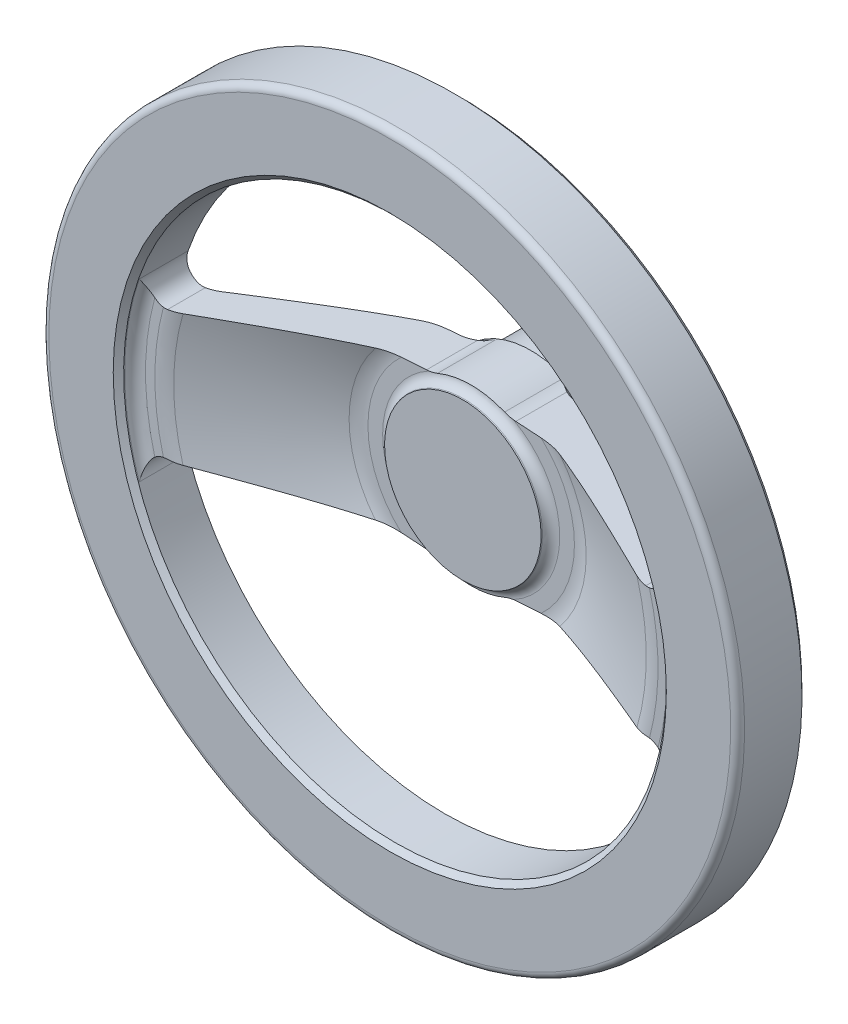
ISO-10303-21;
HEADER;
FILE_DESCRIPTION(('STEP AP214'),'2;1');
FILE_NAME('part.step','',(''),(''),'','','');
FILE_SCHEMA(('AUTOMOTIVE_DESIGN { 1 0 10303 214 1 1 1 1 }'));
ENDSEC;
DATA;
#1=APPLICATION_CONTEXT('core data for automotive mechanical design processes');
#2=APPLICATION_PROTOCOL_DEFINITION('international standard','automotive_design',2000,#1);
#3=PRODUCT_CONTEXT('',#1,'mechanical');
#4=PRODUCT('Part','Part','',(#3));
#5=PRODUCT_RELATED_PRODUCT_CATEGORY('part','',(#4));
#6=PRODUCT_DEFINITION_FORMATION('','',#4);
#7=PRODUCT_DEFINITION_CONTEXT('part definition',#1,'design');
#8=PRODUCT_DEFINITION('design','',#6,#7);
#9=PRODUCT_DEFINITION_SHAPE('','',#8);
#10=(LENGTH_UNIT() NAMED_UNIT(*) SI_UNIT(.MILLI.,.METRE.));
#11=(NAMED_UNIT(*) PLANE_ANGLE_UNIT() SI_UNIT($,.RADIAN.));
#12=(NAMED_UNIT(*) SI_UNIT($,.STERADIAN.) SOLID_ANGLE_UNIT());
#13=UNCERTAINTY_MEASURE_WITH_UNIT(LENGTH_MEASURE(1.E-05),#10,'distance_accuracy_value','');
#14=(GEOMETRIC_REPRESENTATION_CONTEXT(3) GLOBAL_UNCERTAINTY_ASSIGNED_CONTEXT((#13)) GLOBAL_UNIT_ASSIGNED_CONTEXT((#10,
#11,#12)) REPRESENTATION_CONTEXT('',''));
#15=CARTESIAN_POINT('',(0.,0.,0.));
#16=DIRECTION('',(0.,0.,1.));
#17=DIRECTION('',(1.,0.,0.));
#18=AXIS2_PLACEMENT_3D('',#15,#16,#17);
#19=CARTESIAN_POINT('',(-76.651087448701,0.,41.364389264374));
#20=DIRECTION('',(0.,0.,-1.));
#21=DIRECTION('',(0.,1.,0.));
#22=AXIS2_PLACEMENT_3D('',#19,#20,#21);
#23=PLANE('',#22);
#24=CARTESIAN_POINT('',(69.067497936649,-23.6364280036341,41.364389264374));
#25=DIRECTION('',(0.,0.,-1.));
#26=DIRECTION('',(0.,1.,0.));
#27=AXIS2_PLACEMENT_3D('',#24,#25,#26);
#28=CIRCLE('',#27,5.);
#29=CARTESIAN_POINT('',(70.1613368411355,-18.7575432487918,41.364389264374));
#30=VERTEX_POINT('',#29);
#31=CARTESIAN_POINT('',(73.579385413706,-21.4816956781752,41.364389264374));
#32=VERTEX_POINT('',#31);
#33=EDGE_CURVE('E676',#30,#32,#28,.T.);
#34=ORIENTED_EDGE('',*,*,#33,.F.);
#35=CARTESIAN_POINT('',(0.,0.,41.364389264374));
#36=DIRECTION('',(0.,0.,1.));
#37=DIRECTION('',(0.,-1.,0.));
#38=AXIS2_PLACEMENT_3D('',#35,#36,#37);
#39=CIRCLE('',#38,72.6254680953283);
#40=CARTESIAN_POINT('',(70.1613368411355,18.7575432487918,41.364389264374));
#41=VERTEX_POINT('',#40);
#42=EDGE_CURVE('E745',#30,#41,#39,.T.);
#43=ORIENTED_EDGE('',*,*,#42,.T.);
#44=CARTESIAN_POINT('',(69.067497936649,23.6364280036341,41.364389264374));
#45=DIRECTION('',(0.,0.,-1.));
#46=DIRECTION('',(0.,1.,0.));
#47=AXIS2_PLACEMENT_3D('',#44,#45,#46);
#48=CIRCLE('',#47,5.);
#49=CARTESIAN_POINT('',(73.579385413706,21.4816956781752,41.364389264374));
#50=VERTEX_POINT('',#49);
#51=EDGE_CURVE('E941',#41,#50,#48,.F.);
#52=ORIENTED_EDGE('',*,*,#51,.T.);
#53=CARTESIAN_POINT('',(0.,0.,41.364389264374));
#54=DIRECTION('',(0.,0.,1.));
#55=DIRECTION('',(0.,-1.,0.));
#56=AXIS2_PLACEMENT_3D('',#53,#54,#55);
#57=CIRCLE('',#56,76.6510874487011);
#58=EDGE_CURVE('E748',#32,#50,#57,.T.);
#59=ORIENTED_EDGE('',*,*,#58,.F.);
#60=EDGE_LOOP('',(#34,#43,#52,#59));
#61=FACE_BOUND('',#60,.T.);
#62=ADVANCED_FACE('F14',(#61),#23,.T.);
#63=CARTESIAN_POINT('',(0.,0.,31.364389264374));
#64=DIRECTION('',(0.,0.,1.));
#65=DIRECTION('',(0.,-1.,0.));
#66=AXIS2_PLACEMENT_3D('',#63,#64,#65);
#67=TOROIDAL_SURFACE('',#66,72.6254680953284,10.);
#68=CARTESIAN_POINT('',(72.6256680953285,-20.123676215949,40.982637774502));
#69=CARTESIAN_POINT('',(72.5352249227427,-20.0320502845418,41.0144105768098));
#70=CARTESIAN_POINT('',(72.4409785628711,-19.9436766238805,41.0448311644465));
#71=CARTESIAN_POINT('',(72.2453105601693,-19.7740118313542,41.1024215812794));
#72=CARTESIAN_POINT('',(72.1438856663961,-19.6927239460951,41.1295899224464));
#73=CARTESIAN_POINT('',(71.9342885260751,-19.5378294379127,41.1801203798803));
#74=CARTESIAN_POINT('',(71.8261107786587,-19.4642292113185,41.2034793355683));
#75=CARTESIAN_POINT('',(71.6037121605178,-19.3254194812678,41.2458689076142));
#76=CARTESIAN_POINT('',(71.4894923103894,-19.2602085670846,41.2649002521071));
#77=CARTESIAN_POINT('',(71.2552816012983,-19.1385307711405,41.2982855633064));
#78=CARTESIAN_POINT('',(71.1352711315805,-19.0820968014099,41.3126221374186));
#79=CARTESIAN_POINT('',(70.8907177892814,-18.9788010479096,41.336205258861));
#80=CARTESIAN_POINT('',(70.7661750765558,-18.9319389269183,41.3454519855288));
#81=CARTESIAN_POINT('',(70.5136687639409,-18.8482919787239,41.3586513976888));
#82=CARTESIAN_POINT('',(70.3857103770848,-18.8114926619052,41.3626117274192));
#83=CARTESIAN_POINT('',(70.1272704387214,-18.748218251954,41.3652124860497));
#84=CARTESIAN_POINT('',(69.9967895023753,-18.7217406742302,41.3638541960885));
#85=CARTESIAN_POINT('',(69.6791235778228,-18.6703942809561,41.3542201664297));
#86=CARTESIAN_POINT('',(69.4911110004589,-18.6508588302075,41.3432818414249));
#87=CARTESIAN_POINT('',(69.2090634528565,-18.6375419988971,41.3195123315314));
#88=CARTESIAN_POINT('',(69.1149968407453,-18.6357704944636,41.310355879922));
#89=CARTESIAN_POINT('',(68.9271560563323,-18.6375165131,41.2897355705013));
#90=CARTESIAN_POINT('',(68.8333819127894,-18.6410345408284,41.2782714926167));
#91=CARTESIAN_POINT('',(68.7398986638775,-18.6471716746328,41.26572890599));
#92=B_SPLINE_CURVE_WITH_KNOTS('',3,(#68,#69,#70,#71,#72,#73,#74,#75,#76,#77,#78,#79,#80,#81,#82,
#83,#84,#85,#86,#87,#88,#89,#90,#91),.UNSPECIFIED.,.F.,.F.,(4,2,2,2,2,2,2,2,2,2,2,4),(0.,
0.397756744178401,0.795694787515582,1.19396133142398,1.59216081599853,1.99181923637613,
2.39146357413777,2.79052938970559,3.18949908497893,3.75581912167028,4.0392563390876,
4.32272060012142),.UNSPECIFIED.);
#93=CARTESIAN_POINT('',(68.7400986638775,-18.6471585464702,41.265755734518));
#94=VERTEX_POINT('',#93);
#95=EDGE_CURVE('E669',#30,#94,#92,.T.);
#96=ORIENTED_EDGE('',*,*,#95,.T.);
#97=CARTESIAN_POINT('',(68.7402986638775,-18.6471454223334,41.2657825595));
#98=CARTESIAN_POINT('',(68.415080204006,-18.668486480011,41.2221890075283));
#99=CARTESIAN_POINT('',(68.0917905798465,-18.6897009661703,41.1641543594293));
#100=CARTESIAN_POINT('',(67.4540699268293,-18.7315486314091,41.0202917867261));
#101=CARTESIAN_POINT('',(67.1395895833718,-18.7521850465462,40.9346833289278));
#102=CARTESIAN_POINT('',(66.5193648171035,-18.7928846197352,40.7360690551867));
#103=CARTESIAN_POINT('',(66.2136201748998,-18.8129477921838,40.6230639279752));
#104=CARTESIAN_POINT('',(65.6109609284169,-18.8524947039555,40.3693942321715));
#105=CARTESIAN_POINT('',(65.3141342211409,-18.8719726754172,40.228519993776));
#106=CARTESIAN_POINT('',(65.024241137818,-18.8909956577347,40.074473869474));
#107=B_SPLINE_CURVE_WITH_KNOTS('',3,(#97,#98,#99,#100,#101,#102,#103,#104,#105,#106),
.UNSPECIFIED.,.F.,.F.,(4,2,2,2,4),(0.,0.986138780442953,1.9646149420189,2.94306650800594,
3.92918027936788),.UNSPECIFIED.);
#108=CARTESIAN_POINT('',(65.024617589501,-18.890970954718,40.0746738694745));
#109=VERTEX_POINT('',#108);
#110=EDGE_CURVE('E1030',#94,#109,#107,.T.);
#111=ORIENTED_EDGE('',*,*,#110,.T.);
#112=CARTESIAN_POINT('',(0.,0.,40.0746738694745));
#113=DIRECTION('',(0.,0.,1.));
#114=DIRECTION('',(0.,-1.,0.));
#115=AXIS2_PLACEMENT_3D('',#112,#113,#114);
#116=CIRCLE('',#115,67.7131425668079);
#117=CARTESIAN_POINT('',(65.024617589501,18.890970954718,40.0746738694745));
#118=VERTEX_POINT('',#117);
#119=EDGE_CURVE('E743',#109,#118,#116,.T.);
#120=ORIENTED_EDGE('',*,*,#119,.T.);
#121=CARTESIAN_POINT('',(68.7402986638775,18.6471454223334,41.2657825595));
#122=CARTESIAN_POINT('',(68.415080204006,18.668486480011,41.2221890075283));
#123=CARTESIAN_POINT('',(68.0917905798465,18.6897009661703,41.1641543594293));
#124=CARTESIAN_POINT('',(67.4540699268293,18.7315486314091,41.0202917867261));
#125=CARTESIAN_POINT('',(67.1395895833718,18.7521850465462,40.9346833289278));
#126=CARTESIAN_POINT('',(66.5193648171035,18.7928846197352,40.7360690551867));
#127=CARTESIAN_POINT('',(66.2136201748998,18.8129477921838,40.6230639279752));
#128=CARTESIAN_POINT('',(65.6109609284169,18.8524947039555,40.3693942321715));
#129=CARTESIAN_POINT('',(65.3141342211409,18.8719726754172,40.228519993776));
#130=CARTESIAN_POINT('',(65.024241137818,18.8909956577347,40.074473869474));
#131=B_SPLINE_CURVE_WITH_KNOTS('',3,(#121,#122,#123,#124,#125,#126,#127,#128,#129,#130),
.UNSPECIFIED.,.F.,.F.,(4,2,2,2,4),(0.,0.986138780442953,1.9646149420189,2.94306650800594,
3.92918027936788),.UNSPECIFIED.);
#132=CARTESIAN_POINT('',(68.7400986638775,18.6471585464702,41.265755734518));
#133=VERTEX_POINT('',#132);
#134=EDGE_CURVE('E991',#133,#118,#131,.T.);
#135=ORIENTED_EDGE('',*,*,#134,.F.);
#136=CARTESIAN_POINT('',(72.6256680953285,20.123676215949,40.982637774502));
#137=CARTESIAN_POINT('',(72.5352249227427,20.0320502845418,41.0144105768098));
#138=CARTESIAN_POINT('',(72.4409785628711,19.9436766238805,41.0448311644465));
#139=CARTESIAN_POINT('',(72.2453105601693,19.7740118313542,41.1024215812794));
#140=CARTESIAN_POINT('',(72.1438856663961,19.6927239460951,41.1295899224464));
#141=CARTESIAN_POINT('',(71.9342885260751,19.5378294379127,41.1801203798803));
#142=CARTESIAN_POINT('',(71.8261107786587,19.4642292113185,41.2034793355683));
#143=CARTESIAN_POINT('',(71.6037121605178,19.3254194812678,41.2458689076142));
#144=CARTESIAN_POINT('',(71.4894923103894,19.2602085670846,41.2649002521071));
#145=CARTESIAN_POINT('',(71.2552816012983,19.1385307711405,41.2982855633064));
#146=CARTESIAN_POINT('',(71.1352711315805,19.0820968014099,41.3126221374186));
#147=CARTESIAN_POINT('',(70.8907177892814,18.9788010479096,41.336205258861));
#148=CARTESIAN_POINT('',(70.7661750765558,18.9319389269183,41.3454519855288));
#149=CARTESIAN_POINT('',(70.5136687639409,18.8482919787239,41.3586513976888));
#150=CARTESIAN_POINT('',(70.3857103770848,18.8114926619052,41.3626117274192));
#151=CARTESIAN_POINT('',(70.1272704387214,18.748218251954,41.3652124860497));
#152=CARTESIAN_POINT('',(69.9967895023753,18.7217406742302,41.3638541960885));
#153=CARTESIAN_POINT('',(69.6791235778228,18.6703942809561,41.3542201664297));
#154=CARTESIAN_POINT('',(69.4911110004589,18.6508588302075,41.3432818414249));
#155=CARTESIAN_POINT('',(69.2090634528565,18.6375419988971,41.3195123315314));
#156=CARTESIAN_POINT('',(69.1149968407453,18.6357704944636,41.310355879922));
#157=CARTESIAN_POINT('',(68.9271560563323,18.6375165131,41.2897355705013));
#158=CARTESIAN_POINT('',(68.8333819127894,18.6410345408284,41.2782714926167));
#159=CARTESIAN_POINT('',(68.7398986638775,18.6471716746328,41.26572890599));
#160=B_SPLINE_CURVE_WITH_KNOTS('',3,(#136,#137,#138,#139,#140,#141,#142,#143,#144,#145,#146,
#147,#148,#149,#150,#151,#152,#153,#154,#155,#156,#157,#158,#159),.UNSPECIFIED.,.F.,.F.,(4,2,2,
2,2,2,2,2,2,2,2,4),(0.,0.397756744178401,0.795694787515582,1.19396133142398,1.59216081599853,
1.99181923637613,2.39146357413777,2.79052938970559,3.18949908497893,3.75581912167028,
4.0392563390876,4.32272060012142),.UNSPECIFIED.);
#161=EDGE_CURVE('E937',#41,#133,#160,.T.);
#162=ORIENTED_EDGE('',*,*,#161,.F.);
#163=ORIENTED_EDGE('',*,*,#42,.F.);
#164=EDGE_LOOP('',(#96,#111,#120,#135,#162,#163));
#165=FACE_BOUND('',#164,.T.);
#166=ADVANCED_FACE('F888',(#165),#67,.F.);
#167=CARTESIAN_POINT('',(0.,0.,40.0746738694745));
#168=DIRECTION('',(0.,0.,1.));
#169=DIRECTION('',(0.,-1.,0.));
#170=AXIS2_PLACEMENT_3D('',#167,#168,#169);
#171=CONICAL_SURFACE('',#170,67.7131425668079,1.05729208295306);
#172=CARTESIAN_POINT('',(0.,0.,21.2233043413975));
#173=DIRECTION('',(0.,0.,1.));
#174=DIRECTION('',(0.,-1.,0.));
#175=AXIS2_PLACEMENT_3D('',#172,#173,#174);
#176=CIRCLE('',#175,34.2868574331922);
#177=CARTESIAN_POINT('',(-26.7885526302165,21.4000476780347,21.2233043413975));
#178=VERTEX_POINT('',#177);
#179=CARTESIAN_POINT('',(-26.7885526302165,-21.4000476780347,21.2233043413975));
#180=VERTEX_POINT('',#179);
#181=EDGE_CURVE('E740',#178,#180,#176,.T.);
#182=ORIENTED_EDGE('',*,*,#181,.T.);
#183=CARTESIAN_POINT('',(-26.7880736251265,-21.4000791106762,21.2231043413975));
#184=CARTESIAN_POINT('',(-27.4932086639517,-21.3538076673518,21.5175653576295));
#185=CARTESIAN_POINT('',(-28.1963777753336,-21.3076652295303,21.8167106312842));
#186=CARTESIAN_POINT('',(-29.5991759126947,-21.2156126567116,22.4231588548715));
#187=CARTESIAN_POINT('',(-30.2988050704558,-21.1697025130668,22.7304614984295));
#188=CARTESIAN_POINT('',(-31.6948647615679,-21.0780921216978,23.3519899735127));
#189=CARTESIAN_POINT('',(-32.3912957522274,-21.0323918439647,23.6662147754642));
#190=CARTESIAN_POINT('',(-33.7814217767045,-20.9411708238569,24.3006973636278));
#191=CARTESIAN_POINT('',(-34.4751167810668,-20.8956500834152,24.620955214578));
#192=CARTESIAN_POINT('',(-36.5520755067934,-20.7593586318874,25.5893039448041));
#193=CARTESIAN_POINT('',(-37.931718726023,-20.6688255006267,26.24519663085));
#194=CARTESIAN_POINT('',(-40.6834310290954,-20.4882562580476,27.5728428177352));
#195=CARTESIAN_POINT('',(-42.0554997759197,-20.3982201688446,28.2445970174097));
#196=CARTESIAN_POINT('',(-44.792845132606,-20.2185936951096,29.6000891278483));
#197=CARTESIAN_POINT('',(-46.158124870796,-20.1290031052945,30.2838207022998));
#198=CARTESIAN_POINT('',(-48.8837571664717,-19.9501452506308,31.661012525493));
#199=CARTESIAN_POINT('',(-50.2441097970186,-19.8608779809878,32.3544726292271));
#200=CARTESIAN_POINT('',(-52.9609192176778,-19.6825990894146,33.7492672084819));
#201=CARTESIAN_POINT('',(-54.3173756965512,-19.593587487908,34.4506022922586));
#202=CARTESIAN_POINT('',(-57.0269942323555,-19.4157804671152,35.8596370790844));
#203=CARTESIAN_POINT('',(-58.3801562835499,-19.3269850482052,36.5673367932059));
#204=CARTESIAN_POINT('',(-60.1735637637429,-19.2093004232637,37.5097156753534));
#205=CARTESIAN_POINT('',(-60.6150364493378,-19.1803306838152,37.7420525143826));
#206=CARTESIAN_POINT('',(-61.4976975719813,-19.1224098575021,38.2072511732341));
#207=CARTESIAN_POINT('',(-61.9388860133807,-19.093458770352,38.4401129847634));
#208=CARTESIAN_POINT('',(-62.8210342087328,-19.0355716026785,38.9063512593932));
#209=CARTESIAN_POINT('',(-63.2619939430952,-19.0066355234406,39.1397277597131));
#210=CARTESIAN_POINT('',(-64.1436727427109,-18.9487791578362,39.6069538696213));
#211=CARTESIAN_POINT('',(-64.5843918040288,-18.919858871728,39.8408034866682));
#212=CARTESIAN_POINT('',(-65.024994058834,-18.890946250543,40.0748738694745));
#213=B_SPLINE_CURVE_WITH_KNOTS('',3,(#183,#184,#185,#186,#187,#188,#189,#190,#191,#192,#193,
#194,#195,#196,#197,#198,#199,#200,#201,#202,#203,#204,#205,#206,#207,#208,#209,#210,#211,#212),
.UNSPECIFIED.,.F.,.F.,(4,2,2,2,2,2,2,2,2,2,2,2,2,2,4),(0.,2.29660272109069,4.59311930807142,
6.8892965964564,9.18549853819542,13.7762369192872,18.3671779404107,22.9557595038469,
27.5442727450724,32.1331428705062,36.7220209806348,38.2211739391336,39.7203033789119,
41.2195450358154,42.7188105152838),.UNSPECIFIED.);
#214=CARTESIAN_POINT('',(-65.024617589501,-18.890970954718,40.0746738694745));
#215=VERTEX_POINT('',#214);
#216=EDGE_CURVE('E301',#180,#215,#213,.T.);
#217=ORIENTED_EDGE('',*,*,#216,.T.);
#218=CARTESIAN_POINT('',(-65.024617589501,18.890970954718,40.0746738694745));
#219=VERTEX_POINT('',#218);
#220=EDGE_CURVE('E299',#219,#215,#116,.T.);
#221=ORIENTED_EDGE('',*,*,#220,.F.);
#222=CARTESIAN_POINT('',(-26.7880736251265,21.4000791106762,21.2231043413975));
#223=CARTESIAN_POINT('',(-27.4932086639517,21.3538076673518,21.5175653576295));
#224=CARTESIAN_POINT('',(-28.1963777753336,21.3076652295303,21.8167106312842));
#225=CARTESIAN_POINT('',(-29.5991759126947,21.2156126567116,22.4231588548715));
#226=CARTESIAN_POINT('',(-30.2988050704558,21.1697025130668,22.7304614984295));
#227=CARTESIAN_POINT('',(-31.6948647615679,21.0780921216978,23.3519899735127));
#228=CARTESIAN_POINT('',(-32.3912957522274,21.0323918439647,23.6662147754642));
#229=CARTESIAN_POINT('',(-33.7814217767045,20.9411708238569,24.3006973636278));
#230=CARTESIAN_POINT('',(-34.4751167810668,20.8956500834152,24.620955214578));
#231=CARTESIAN_POINT('',(-36.5520755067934,20.7593586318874,25.5893039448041));
#232=CARTESIAN_POINT('',(-37.931718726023,20.6688255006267,26.24519663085));
#233=CARTESIAN_POINT('',(-40.6834310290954,20.4882562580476,27.5728428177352));
#234=CARTESIAN_POINT('',(-42.0554997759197,20.3982201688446,28.2445970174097));
#235=CARTESIAN_POINT('',(-44.792845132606,20.2185936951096,29.6000891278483));
#236=CARTESIAN_POINT('',(-46.158124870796,20.1290031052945,30.2838207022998));
#237=CARTESIAN_POINT('',(-48.8837571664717,19.9501452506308,31.661012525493));
#238=CARTESIAN_POINT('',(-50.2441097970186,19.8608779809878,32.3544726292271));
#239=CARTESIAN_POINT('',(-52.9609192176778,19.6825990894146,33.7492672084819));
#240=CARTESIAN_POINT('',(-54.3173756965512,19.593587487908,34.4506022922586));
#241=CARTESIAN_POINT('',(-57.0269942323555,19.4157804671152,35.8596370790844));
#242=CARTESIAN_POINT('',(-58.3801562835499,19.3269850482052,36.5673367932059));
#243=CARTESIAN_POINT('',(-60.1735637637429,19.2093004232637,37.5097156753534));
#244=CARTESIAN_POINT('',(-60.6150364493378,19.1803306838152,37.7420525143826));
#245=CARTESIAN_POINT('',(-61.4976975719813,19.1224098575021,38.2072511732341));
#246=CARTESIAN_POINT('',(-61.9388860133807,19.093458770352,38.4401129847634));
#247=CARTESIAN_POINT('',(-62.8210342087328,19.0355716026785,38.9063512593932));
#248=CARTESIAN_POINT('',(-63.2619939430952,19.0066355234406,39.1397277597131));
#249=CARTESIAN_POINT('',(-64.1436727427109,18.9487791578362,39.6069538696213));
#250=CARTESIAN_POINT('',(-64.5843918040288,18.919858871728,39.8408034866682));
#251=CARTESIAN_POINT('',(-65.024994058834,18.890946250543,40.0748738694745));
#252=B_SPLINE_CURVE_WITH_KNOTS('',3,(#222,#223,#224,#225,#226,#227,#228,#229,#230,#231,#232,
#233,#234,#235,#236,#237,#238,#239,#240,#241,#242,#243,#244,#245,#246,#247,#248,#249,#250,#251),
.UNSPECIFIED.,.F.,.F.,(4,2,2,2,2,2,2,2,2,2,2,2,2,2,4),(0.,2.29660272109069,4.59311930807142,
6.8892965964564,9.18549853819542,13.7762369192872,18.3671779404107,22.9557595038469,
27.5442727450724,32.1331428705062,36.7220209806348,38.2211739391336,39.7203033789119,
41.2195450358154,42.7188105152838),.UNSPECIFIED.);
#253=EDGE_CURVE('E1078',#178,#219,#252,.T.);
#254=ORIENTED_EDGE('',*,*,#253,.F.);
#255=EDGE_LOOP('',(#182,#217,#221,#254));
#256=FACE_BOUND('',#255,.T.);
#257=ADVANCED_FACE('F894',(#256),#171,.T.);
#258=CARTESIAN_POINT('',(0.,0.,29.9335889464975));
#259=DIRECTION('',(0.,0.,1.));
#260=DIRECTION('',(0.,-1.,0.));
#261=AXIS2_PLACEMENT_3D('',#258,#259,#260);
#262=TOROIDAL_SURFACE('',#261,29.3745319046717,10.);
#263=CARTESIAN_POINT('',(0.,0.,19.9335889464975));
#264=DIRECTION('',(0.,0.,1.));
#265=DIRECTION('',(0.,-1.,0.));
#266=AXIS2_PLACEMENT_3D('',#263,#264,#265);
#267=CIRCLE('',#266,29.3745319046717);
#268=CARTESIAN_POINT('',(-19.6090537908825,21.8711713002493,19.9335889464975));
#269=VERTEX_POINT('',#268);
#270=CARTESIAN_POINT('',(-19.6090537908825,-21.8711713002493,19.9335889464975));
#271=VERTEX_POINT('',#270);
#272=EDGE_CURVE('E736',#269,#271,#267,.T.);
#273=ORIENTED_EDGE('',*,*,#272,.T.);
#274=CARTESIAN_POINT('',(-12.8395549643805,-22.315390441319,20.6153200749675));
#275=CARTESIAN_POINT('',(-13.2595983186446,-22.2878269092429,20.5430197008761));
#276=CARTESIAN_POINT('',(-13.6802301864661,-22.2602247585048,20.4738095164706));
#277=CARTESIAN_POINT('',(-14.5230811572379,-22.2049163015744,20.344340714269));
#278=CARTESIAN_POINT('',(-14.9453009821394,-22.1772099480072,20.2840868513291));
#279=CARTESIAN_POINT('',(-15.7941878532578,-22.1215054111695,20.1750124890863));
#280=CARTESIAN_POINT('',(-16.2208655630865,-22.0935065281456,20.1262730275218));
#281=CARTESIAN_POINT('',(-17.0755635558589,-22.0374206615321,20.0435649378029));
#282=CARTESIAN_POINT('',(-17.5035835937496,-22.0093336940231,20.0095937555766));
#283=CARTESIAN_POINT('',(-18.7595324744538,-21.926917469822,19.9357236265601));
#284=CARTESIAN_POINT('',(-19.5890914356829,-21.8724812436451,19.9197066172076));
#285=CARTESIAN_POINT('',(-21.2440257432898,-21.763883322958,19.9731297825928));
#286=CARTESIAN_POINT('',(-22.0694062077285,-21.7097212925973,20.0423174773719));
#287=CARTESIAN_POINT('',(-23.2185887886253,-21.634311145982,20.2133270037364));
#288=CARTESIAN_POINT('',(-23.5490742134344,-21.6126244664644,20.2713449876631));
#289=CARTESIAN_POINT('',(-24.206306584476,-21.5694964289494,20.4059944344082));
#290=CARTESIAN_POINT('',(-24.5330534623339,-21.5480550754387,20.4826262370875));
#291=CARTESIAN_POINT('',(-25.1856727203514,-21.5052297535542,20.65694901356));
#292=CARTESIAN_POINT('',(-25.5114739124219,-21.4838504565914,20.7549099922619));
#293=CARTESIAN_POINT('',(-26.1560706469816,-21.4415515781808,20.9725831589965));
#294=CARTESIAN_POINT('',(-26.4748594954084,-21.4206324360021,21.0923151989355));
#295=CARTESIAN_POINT('',(-26.789031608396,-21.4000162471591,21.2235043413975));
#296=B_SPLINE_CURVE_WITH_KNOTS('',3,(#274,#275,#276,#277,#278,#279,#280,#281,#282,#283,#284,
#285,#286,#287,#288,#289,#290,#291,#292,#293,#294,#295),.UNSPECIFIED.,.F.,.F.,(4,2,2,2,2,2,2,2,
2,2,4),(0.,1.28140733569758,2.56349255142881,3.85434874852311,5.14498161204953,7.63619789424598,
10.1200498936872,11.1283367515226,12.1366420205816,13.1585420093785,14.1813785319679),.UNSPECIFIED.);
#297=EDGE_CURVE('E306',#271,#180,#296,.T.);
#298=ORIENTED_EDGE('',*,*,#297,.T.);
#299=ORIENTED_EDGE('',*,*,#181,.F.);
#300=CARTESIAN_POINT('',(-12.8395549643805,22.315390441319,20.6153200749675));
#301=CARTESIAN_POINT('',(-13.2595983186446,22.2878269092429,20.5430197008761));
#302=CARTESIAN_POINT('',(-13.6802301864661,22.2602247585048,20.4738095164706));
#303=CARTESIAN_POINT('',(-14.5230811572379,22.2049163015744,20.344340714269));
#304=CARTESIAN_POINT('',(-14.9453009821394,22.1772099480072,20.2840868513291));
#305=CARTESIAN_POINT('',(-15.7941878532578,22.1215054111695,20.1750124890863));
#306=CARTESIAN_POINT('',(-16.2208655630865,22.0935065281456,20.1262730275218));
#307=CARTESIAN_POINT('',(-17.0755635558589,22.0374206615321,20.0435649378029));
#308=CARTESIAN_POINT('',(-17.5035835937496,22.0093336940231,20.0095937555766));
#309=CARTESIAN_POINT('',(-18.7595324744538,21.926917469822,19.9357236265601));
#310=CARTESIAN_POINT('',(-19.5890914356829,21.8724812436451,19.9197066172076));
#311=CARTESIAN_POINT('',(-21.2440257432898,21.763883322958,19.9731297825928));
#312=CARTESIAN_POINT('',(-22.0694062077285,21.7097212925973,20.0423174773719));
#313=CARTESIAN_POINT('',(-23.2185887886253,21.634311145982,20.2133270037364));
#314=CARTESIAN_POINT('',(-23.5490742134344,21.6126244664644,20.2713449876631));
#315=CARTESIAN_POINT('',(-24.206306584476,21.5694964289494,20.4059944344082));
#316=CARTESIAN_POINT('',(-24.5330534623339,21.5480550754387,20.4826262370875));
#317=CARTESIAN_POINT('',(-25.1856727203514,21.5052297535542,20.65694901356));
#318=CARTESIAN_POINT('',(-25.5114739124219,21.4838504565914,20.7549099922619));
#319=CARTESIAN_POINT('',(-26.1560706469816,21.4415515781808,20.9725831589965));
#320=CARTESIAN_POINT('',(-26.4748594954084,21.4206324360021,21.0923151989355));
#321=CARTESIAN_POINT('',(-26.789031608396,21.4000162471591,21.2235043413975));
#322=B_SPLINE_CURVE_WITH_KNOTS('',3,(#300,#301,#302,#303,#304,#305,#306,#307,#308,#309,#310,
#311,#312,#313,#314,#315,#316,#317,#318,#319,#320,#321),.UNSPECIFIED.,.F.,.F.,(4,2,2,2,2,2,2,2,
2,2,4),(0.,1.28140733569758,2.56349255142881,3.85434874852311,5.14498161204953,7.63619789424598,
10.1200498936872,11.1283367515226,12.1366420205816,13.1585420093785,14.1813785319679),.UNSPECIFIED.);
#323=EDGE_CURVE('E389',#269,#178,#322,.T.);
#324=ORIENTED_EDGE('',*,*,#323,.F.);
#325=EDGE_LOOP('',(#273,#298,#299,#324));
#326=FACE_BOUND('',#325,.T.);
#327=ADVANCED_FACE('F384',(#326),#262,.T.);
#328=CARTESIAN_POINT('',(-29.3745319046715,0.,19.9335889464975));
#329=DIRECTION('',(0.,0.,-1.));
#330=DIRECTION('',(0.,1.,0.));
#331=AXIS2_PLACEMENT_3D('',#328,#329,#330);
#332=PLANE('',#331);
#333=CARTESIAN_POINT('',(0.,0.,19.9335889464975));
#334=DIRECTION('',(0.,0.,1.));
#335=DIRECTION('',(0.,-1.,0.));
#336=AXIS2_PLACEMENT_3D('',#333,#334,#335);
#337=CIRCLE('',#336,28.);
#338=CARTESIAN_POINT('',(-17.290883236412,22.0232912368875,19.9335889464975));
#339=VERTEX_POINT('',#338);
#340=CARTESIAN_POINT('',(-17.290883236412,-22.0232912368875,19.9335889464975));
#341=VERTEX_POINT('',#340);
#342=EDGE_CURVE('E732',#339,#341,#337,.T.);
#343=ORIENTED_EDGE('',*,*,#342,.T.);
#344=DIRECTION('',(-0.997853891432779,0.0654798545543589,0.));
#345=VECTOR('',#344,1.);
#346=CARTESIAN_POINT('',(-30.761708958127,-21.1393264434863,19.9335889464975));
#347=LINE('',#346,#345);
#348=EDGE_CURVE('E35',#341,#271,#347,.T.);
#349=ORIENTED_EDGE('',*,*,#348,.T.);
#350=ORIENTED_EDGE('',*,*,#272,.F.);
#351=DIRECTION('',(-0.997853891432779,-0.0654798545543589,0.));
#352=VECTOR('',#351,1.);
#353=CARTESIAN_POINT('',(-30.761708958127,21.1393264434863,19.9335889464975));
#354=LINE('',#353,#352);
#355=EDGE_CURVE('E1073',#339,#269,#354,.T.);
#356=ORIENTED_EDGE('',*,*,#355,.F.);
#357=EDGE_LOOP('',(#343,#349,#350,#356));
#358=FACE_BOUND('',#357,.T.);
#359=ADVANCED_FACE('F1332',(#358),#332,.T.);
#360=CARTESIAN_POINT('',(0.,0.,16.9335889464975));
#361=DIRECTION('',(0.,0.,1.));
#362=DIRECTION('',(0.,-1.,0.));
#363=AXIS2_PLACEMENT_3D('',#360,#361,#362);
#364=TOROIDAL_SURFACE('',#363,28.,3.);
#365=CARTESIAN_POINT('',(22.132987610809,-21.7055490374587,16.933391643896));
#366=CARTESIAN_POINT('',(22.1330178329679,-21.7055470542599,16.9978302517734));
#367=CARTESIAN_POINT('',(22.1298932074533,-21.7057520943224,17.062256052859));
#368=CARTESIAN_POINT('',(22.1175180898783,-21.7065641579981,17.1904616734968));
#369=CARTESIAN_POINT('',(22.1082727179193,-21.7071708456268,17.2542419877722));
#370=CARTESIAN_POINT('',(22.0839499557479,-21.7087669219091,17.3800738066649));
#371=CARTESIAN_POINT('',(22.0689261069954,-21.7097527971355,17.4421357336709));
#372=CARTESIAN_POINT('',(22.0333729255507,-21.7120858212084,17.5646438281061));
#373=CARTESIAN_POINT('',(22.0128427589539,-21.7134330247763,17.6250897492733));
#374=CARTESIAN_POINT('',(21.9436996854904,-21.7179702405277,17.8030032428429));
#375=CARTESIAN_POINT('',(21.8874311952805,-21.7216626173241,17.9175561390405));
#376=CARTESIAN_POINT('',(21.7579663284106,-21.7301581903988,18.1367100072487));
#377=CARTESIAN_POINT('',(21.6847300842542,-21.7349640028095,18.2412867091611));
#378=CARTESIAN_POINT('',(21.4903891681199,-21.7477167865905,18.4822484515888));
#379=CARTESIAN_POINT('',(21.3622532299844,-21.7561251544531,18.6129334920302));
#380=CARTESIAN_POINT('',(21.0869271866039,-21.7741922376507,18.852254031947));
#381=CARTESIAN_POINT('',(20.9396989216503,-21.7838534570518,18.96084422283));
#382=CARTESIAN_POINT('',(20.6707008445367,-21.8015052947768,19.133022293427));
#383=CARTESIAN_POINT('',(20.5517184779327,-21.8093129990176,19.2010833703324));
#384=CARTESIAN_POINT('',(20.3082450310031,-21.8252898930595,19.3265689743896));
#385=CARTESIAN_POINT('',(20.1837512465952,-21.8334592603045,19.3839882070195));
#386=CARTESIAN_POINT('',(19.9306412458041,-21.8500685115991,19.4890325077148));
#387=CARTESIAN_POINT('',(19.8020219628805,-21.8585085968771,19.5366500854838));
#388=CARTESIAN_POINT('',(19.5417842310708,-21.8755855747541,19.6228377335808));
#389=CARTESIAN_POINT('',(19.410164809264,-21.8842225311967,19.661404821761));
#390=CARTESIAN_POINT('',(19.0669971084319,-21.9067414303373,19.7503522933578));
#391=CARTESIAN_POINT('',(18.8538064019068,-21.9207311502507,19.7944122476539));
#392=CARTESIAN_POINT('',(18.424408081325,-21.9489085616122,19.8639375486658));
#393=CARTESIAN_POINT('',(18.2081987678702,-21.963096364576,19.8893919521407));
#394=CARTESIAN_POINT('',(17.7737817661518,-21.9916031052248,19.9236452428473));
#395=CARTESIAN_POINT('',(17.5555698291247,-22.0059223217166,19.9323886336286));
#396=CARTESIAN_POINT('',(17.1191478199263,-22.034560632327,19.9345582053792));
#397=CARTESIAN_POINT('',(16.9009377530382,-22.0488797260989,19.9279868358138));
#398=CARTESIAN_POINT('',(16.3862789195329,-22.0826519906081,19.8957210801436));
#399=CARTESIAN_POINT('',(16.0902033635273,-22.10208067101,19.8639472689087));
#400=CARTESIAN_POINT('',(15.5014851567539,-22.1407127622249,19.7759212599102));
#401=CARTESIAN_POINT('',(15.2088452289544,-22.159915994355,19.7196508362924));
#402=CARTESIAN_POINT('',(14.7747247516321,-22.1884032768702,19.6174472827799));
#403=CARTESIAN_POINT('',(14.6310875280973,-22.1978288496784,19.5804983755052));
#404=CARTESIAN_POINT('',(14.3454970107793,-22.2165694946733,19.5005761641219));
#405=CARTESIAN_POINT('',(14.2035435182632,-22.2258845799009,19.4576035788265));
#406=CARTESIAN_POINT('',(13.921802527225,-22.2443726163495,19.3654907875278));
#407=CARTESIAN_POINT('',(13.7820129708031,-22.2535457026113,19.3163569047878));
#408=CARTESIAN_POINT('',(13.5049188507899,-22.2717288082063,19.2115434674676));
#409=CARTESIAN_POINT('',(13.3676136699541,-22.2807388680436,19.1558655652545));
#410=CARTESIAN_POINT('',(13.1656612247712,-22.2939911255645,19.0677425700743));
#411=CARTESIAN_POINT('',(13.0998289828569,-22.2983110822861,19.0380089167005));
#412=CARTESIAN_POINT('',(12.9690276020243,-22.3068943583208,18.9767614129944));
#413=CARTESIAN_POINT('',(12.9040581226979,-22.3111576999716,18.945248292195));
#414=CARTESIAN_POINT('',(12.8395549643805,-22.315390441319,18.9127893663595));
#415=B_SPLINE_CURVE_WITH_KNOTS('',3,(#365,#366,#367,#368,#369,#370,#371,#372,#373,#374,#375,
#376,#377,#378,#379,#380,#381,#382,#383,#384,#385,#386,#387,#388,#389,#390,#391,#392,#393,#394,
#395,#396,#397,#398,#399,#400,#401,#402,#403,#404,#405,#406,#407,#408,#409,#410,#411,#412,#413,
#414),.UNSPECIFIED.,.F.,.F.,(4,2,2,2,2,2,2,2,2,2,2,2,2,2,2,2,2,2,2,2,2,2,2,2,4),(0.,
0.193218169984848,0.386274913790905,0.577584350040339,0.768922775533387,1.15006131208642,
1.53210462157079,2.07869800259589,2.62640119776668,3.03774574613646,3.44929440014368,
3.86115639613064,4.27315391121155,4.92657254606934,5.58037519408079,6.23634534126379,
6.89221057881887,7.78632276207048,8.68110131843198,9.12683341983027,9.57251237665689,
10.0177376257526,10.4628506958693,10.6799208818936,10.8969027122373),.UNSPECIFIED.);
#416=CARTESIAN_POINT('',(17.290883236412,-22.0232912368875,19.9335889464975));
#417=VERTEX_POINT('',#416);
#418=CARTESIAN_POINT('',(12.8397549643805,-22.3153773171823,18.912890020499));
#419=VERTEX_POINT('',#418);
#420=EDGE_CURVE('E716',#417,#419,#415,.T.);
#421=ORIENTED_EDGE('',*,*,#420,.T.);
#422=CARTESIAN_POINT('',(12.8399549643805,-22.3153641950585,18.9129906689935));
#423=CARTESIAN_POINT('',(12.6965787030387,-22.3247767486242,18.8408239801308));
#424=CARTESIAN_POINT('',(12.5545052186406,-22.3371933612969,18.7665236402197));
#425=CARTESIAN_POINT('',(12.2729595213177,-22.3677997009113,18.614364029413));
#426=CARTESIAN_POINT('',(12.1334865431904,-22.3859877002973,18.5365058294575));
#427=CARTESIAN_POINT('',(11.8571312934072,-22.4278956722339,18.3779404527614));
#428=CARTESIAN_POINT('',(11.7202475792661,-22.451612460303,18.2972349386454));
#429=CARTESIAN_POINT('',(11.4489164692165,-22.504408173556,18.1335102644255));
#430=CARTESIAN_POINT('',(11.3144692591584,-22.5334875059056,18.0504909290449));
#431=CARTESIAN_POINT('',(10.9174294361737,-22.6278934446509,17.8005022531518));
#432=CARTESIAN_POINT('',(10.6582585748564,-22.7008327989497,17.6309245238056));
#433=CARTESIAN_POINT('',(10.1486862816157,-22.8664615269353,17.2884833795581));
#434=CARTESIAN_POINT('',(9.89828198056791,-22.9591443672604,17.1156210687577));
#435=CARTESIAN_POINT('',(9.64769342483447,-23.0634400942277,16.939717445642));
#436=CARTESIAN_POINT('',(9.64332945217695,-23.065260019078,16.9366531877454));
#437=CARTESIAN_POINT('',(9.63896679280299,-23.067083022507,16.9335889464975));
#438=B_SPLINE_CURVE_WITH_KNOTS('',3,(#422,#423,#424,#425,#426,#427,#428,#429,#430,#431,#432,
#433,#434,#435,#436,#437),.UNSPECIFIED.,.F.,.F.,(4,2,2,2,2,2,2,4),(0.,0.482280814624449,
0.964417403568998,1.44627697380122,1.92817314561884,2.88190409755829,3.83531993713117,
3.85222302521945),.UNSPECIFIED.);
#439=CARTESIAN_POINT('',(9.638968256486,-23.0670824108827,16.933591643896));
#440=VERTEX_POINT('',#439);
#441=EDGE_CURVE('E505',#419,#440,#438,.T.);
#442=ORIENTED_EDGE('',*,*,#441,.T.);
#443=CARTESIAN_POINT('',(0.,0.,16.933591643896));
#444=DIRECTION('',(0.,0.,1.));
#445=DIRECTION('',(0.,-1.,0.));
#446=AXIS2_PLACEMENT_3D('',#443,#444,#445);
#447=CIRCLE('',#446,25.0000000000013);
#448=CARTESIAN_POINT('',(9.638968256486,23.0670824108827,16.933591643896));
#449=VERTEX_POINT('',#448);
#450=EDGE_CURVE('E713',#440,#449,#447,.T.);
#451=ORIENTED_EDGE('',*,*,#450,.T.);
#452=CARTESIAN_POINT('',(12.8399549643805,22.3153641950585,18.9129906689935));
#453=CARTESIAN_POINT('',(12.6965787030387,22.3247767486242,18.8408239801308));
#454=CARTESIAN_POINT('',(12.5545052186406,22.3371933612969,18.7665236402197));
#455=CARTESIAN_POINT('',(12.2729595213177,22.3677997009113,18.614364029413));
#456=CARTESIAN_POINT('',(12.1334865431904,22.3859877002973,18.5365058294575));
#457=CARTESIAN_POINT('',(11.8571312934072,22.4278956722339,18.3779404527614));
#458=CARTESIAN_POINT('',(11.7202475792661,22.451612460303,18.2972349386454));
#459=CARTESIAN_POINT('',(11.4489164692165,22.504408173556,18.1335102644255));
#460=CARTESIAN_POINT('',(11.3144692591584,22.5334875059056,18.0504909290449));
#461=CARTESIAN_POINT('',(10.9174294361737,22.6278934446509,17.8005022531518));
#462=CARTESIAN_POINT('',(10.6582585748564,22.7008327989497,17.6309245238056));
#463=CARTESIAN_POINT('',(10.1486862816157,22.8664615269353,17.2884833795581));
#464=CARTESIAN_POINT('',(9.89828198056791,22.9591443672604,17.1156210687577));
#465=CARTESIAN_POINT('',(9.64769342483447,23.0634400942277,16.939717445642));
#466=CARTESIAN_POINT('',(9.64332945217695,23.065260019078,16.9366531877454));
#467=CARTESIAN_POINT('',(9.63896679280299,23.067083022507,16.9335889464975));
#468=B_SPLINE_CURVE_WITH_KNOTS('',3,(#452,#453,#454,#455,#456,#457,#458,#459,#460,#461,#462,
#463,#464,#465,#466,#467),.UNSPECIFIED.,.F.,.F.,(4,2,2,2,2,2,2,4),(0.,0.482280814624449,
0.964417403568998,1.44627697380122,1.92817314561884,2.88190409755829,3.83531993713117,
3.85222302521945),.UNSPECIFIED.);
#469=CARTESIAN_POINT('',(12.8397549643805,22.3153773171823,18.912890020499));
#470=VERTEX_POINT('',#469);
#471=EDGE_CURVE('E497',#470,#449,#468,.T.);
#472=ORIENTED_EDGE('',*,*,#471,.F.);
#473=CARTESIAN_POINT('',(22.132987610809,21.7055490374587,16.933391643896));
#474=CARTESIAN_POINT('',(22.1330178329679,21.7055470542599,16.9978302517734));
#475=CARTESIAN_POINT('',(22.1298932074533,21.7057520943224,17.062256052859));
#476=CARTESIAN_POINT('',(22.1175180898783,21.7065641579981,17.1904616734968));
#477=CARTESIAN_POINT('',(22.1082727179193,21.7071708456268,17.2542419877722));
#478=CARTESIAN_POINT('',(22.0839499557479,21.7087669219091,17.3800738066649));
#479=CARTESIAN_POINT('',(22.0689261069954,21.7097527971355,17.4421357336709));
#480=CARTESIAN_POINT('',(22.0333729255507,21.7120858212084,17.5646438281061));
#481=CARTESIAN_POINT('',(22.0128427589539,21.7134330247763,17.6250897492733));
#482=CARTESIAN_POINT('',(21.9436996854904,21.7179702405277,17.8030032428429));
#483=CARTESIAN_POINT('',(21.8874311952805,21.7216626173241,17.9175561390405));
#484=CARTESIAN_POINT('',(21.7579663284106,21.7301581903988,18.1367100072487));
#485=CARTESIAN_POINT('',(21.6847300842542,21.7349640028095,18.2412867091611));
#486=CARTESIAN_POINT('',(21.4903891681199,21.7477167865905,18.4822484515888));
#487=CARTESIAN_POINT('',(21.3622532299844,21.7561251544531,18.6129334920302));
#488=CARTESIAN_POINT('',(21.0869271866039,21.7741922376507,18.852254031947));
#489=CARTESIAN_POINT('',(20.9396989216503,21.7838534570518,18.96084422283));
#490=CARTESIAN_POINT('',(20.6707008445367,21.8015052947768,19.133022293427));
#491=CARTESIAN_POINT('',(20.5517184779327,21.8093129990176,19.2010833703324));
#492=CARTESIAN_POINT('',(20.3082450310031,21.8252898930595,19.3265689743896));
#493=CARTESIAN_POINT('',(20.1837512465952,21.8334592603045,19.3839882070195));
#494=CARTESIAN_POINT('',(19.9306412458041,21.8500685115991,19.4890325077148));
#495=CARTESIAN_POINT('',(19.8020219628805,21.8585085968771,19.5366500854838));
#496=CARTESIAN_POINT('',(19.5417842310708,21.8755855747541,19.6228377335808));
#497=CARTESIAN_POINT('',(19.410164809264,21.8842225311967,19.661404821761));
#498=CARTESIAN_POINT('',(19.0669971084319,21.9067414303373,19.7503522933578));
#499=CARTESIAN_POINT('',(18.8538064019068,21.9207311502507,19.7944122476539));
#500=CARTESIAN_POINT('',(18.424408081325,21.9489085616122,19.8639375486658));
#501=CARTESIAN_POINT('',(18.2081987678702,21.963096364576,19.8893919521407));
#502=CARTESIAN_POINT('',(17.7737817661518,21.9916031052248,19.9236452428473));
#503=CARTESIAN_POINT('',(17.5555698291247,22.0059223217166,19.9323886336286));
#504=CARTESIAN_POINT('',(17.1191478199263,22.034560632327,19.9345582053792));
#505=CARTESIAN_POINT('',(16.9009377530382,22.0488797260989,19.9279868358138));
#506=CARTESIAN_POINT('',(16.3862789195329,22.0826519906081,19.8957210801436));
#507=CARTESIAN_POINT('',(16.0902033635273,22.10208067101,19.8639472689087));
#508=CARTESIAN_POINT('',(15.5014851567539,22.1407127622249,19.7759212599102));
#509=CARTESIAN_POINT('',(15.2088452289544,22.159915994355,19.7196508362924));
#510=CARTESIAN_POINT('',(14.7747247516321,22.1884032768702,19.6174472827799));
#511=CARTESIAN_POINT('',(14.6310875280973,22.1978288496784,19.5804983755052));
#512=CARTESIAN_POINT('',(14.3454970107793,22.2165694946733,19.5005761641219));
#513=CARTESIAN_POINT('',(14.2035435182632,22.2258845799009,19.4576035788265));
#514=CARTESIAN_POINT('',(13.921802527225,22.2443726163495,19.3654907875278));
#515=CARTESIAN_POINT('',(13.7820129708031,22.2535457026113,19.3163569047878));
#516=CARTESIAN_POINT('',(13.5049188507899,22.2717288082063,19.2115434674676));
#517=CARTESIAN_POINT('',(13.3676136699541,22.2807388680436,19.1558655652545));
#518=CARTESIAN_POINT('',(13.1656612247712,22.2939911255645,19.0677425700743));
#519=CARTESIAN_POINT('',(13.0998289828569,22.2983110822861,19.0380089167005));
#520=CARTESIAN_POINT('',(12.9690276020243,22.3068943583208,18.9767614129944));
#521=CARTESIAN_POINT('',(12.9040581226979,22.3111576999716,18.945248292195));
#522=CARTESIAN_POINT('',(12.8395549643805,22.315390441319,18.9127893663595));
#523=B_SPLINE_CURVE_WITH_KNOTS('',3,(#473,#474,#475,#476,#477,#478,#479,#480,#481,#482,#483,
#484,#485,#486,#487,#488,#489,#490,#491,#492,#493,#494,#495,#496,#497,#498,#499,#500,#501,#502,
#503,#504,#505,#506,#507,#508,#509,#510,#511,#512,#513,#514,#515,#516,#517,#518,#519,#520,#521,
#522),.UNSPECIFIED.,.F.,.F.,(4,2,2,2,2,2,2,2,2,2,2,2,2,2,2,2,2,2,2,2,2,2,2,2,4),(0.,
0.193218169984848,0.386274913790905,0.577584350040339,0.768922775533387,1.15006131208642,
1.53210462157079,2.07869800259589,2.62640119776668,3.03774574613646,3.44929440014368,
3.86115639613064,4.27315391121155,4.92657254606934,5.58037519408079,6.23634534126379,
6.89221057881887,7.78632276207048,8.68110131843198,9.12683341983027,9.57251237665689,
10.0177376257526,10.4628506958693,10.6799208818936,10.8969027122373),.UNSPECIFIED.);
#524=CARTESIAN_POINT('',(17.290883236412,22.0232912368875,19.9335889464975));
#525=VERTEX_POINT('',#524);
#526=EDGE_CURVE('E459',#525,#470,#523,.T.);
#527=ORIENTED_EDGE('',*,*,#526,.F.);
#528=EDGE_CURVE('E726',#417,#525,#337,.T.);
#529=ORIENTED_EDGE('',*,*,#528,.F.);
#530=EDGE_LOOP('',(#421,#442,#451,#472,#527,#529));
#531=FACE_BOUND('',#530,.T.);
#532=ADVANCED_FACE('F471',(#531),#364,.F.);
#533=CARTESIAN_POINT('',(-29.6825423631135,0.,33.597512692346));
#534=DIRECTION('',(0.,0.,-1.));
#535=DIRECTION('',(0.,1.,0.));
#536=AXIS2_PLACEMENT_3D('',#533,#534,#535);
#537=PLANE('',#536);
#538=CARTESIAN_POINT('',(0.,0.,33.5975126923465));
#539=DIRECTION('',(0.,0.,1.));
#540=DIRECTION('',(0.,-1.,0.));
#541=AXIS2_PLACEMENT_3D('',#538,#539,#540);
#542=CIRCLE('',#541,25.4563500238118);
#543=CARTESIAN_POINT('',(12.1128538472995,-22.3898309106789,33.597512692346));
#544=VERTEX_POINT('',#543);
#545=CARTESIAN_POINT('',(12.1128538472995,22.3898309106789,33.597512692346));
#546=VERTEX_POINT('',#545);
#547=EDGE_CURVE('E693',#544,#546,#542,.T.);
#548=ORIENTED_EDGE('',*,*,#547,.F.);
#549=CARTESIAN_POINT('',(13.494553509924,-32.2939162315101,33.597512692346));
#550=DIRECTION('',(0.,0.,-1.));
#551=DIRECTION('',(0.,1.,0.));
#552=AXIS2_PLACEMENT_3D('',#549,#550,#551);
#553=CIRCLE('',#552,10.);
#554=CARTESIAN_POINT('',(12.8397549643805,-22.3153773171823,33.597512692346));
#555=VERTEX_POINT('',#554);
#556=EDGE_CURVE('E557',#544,#555,#553,.T.);
#557=ORIENTED_EDGE('',*,*,#556,.T.);
#558=DIRECTION('',(0.997853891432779,0.06547985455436,0.));
#559=VECTOR('',#558,1.);
#560=CARTESIAN_POINT('',(-28.0421515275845,-24.9980759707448,33.597512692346));
#561=LINE('',#560,#559);
#562=CARTESIAN_POINT('',(20.1027683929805,-21.8387734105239,33.597512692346));
#563=VERTEX_POINT('',#562);
#564=EDGE_CURVE('E690',#555,#563,#561,.T.);
#565=ORIENTED_EDGE('',*,*,#564,.T.);
#566=CARTESIAN_POINT('',(0.,0.,33.597512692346));
#567=DIRECTION('',(0.,0.,1.));
#568=DIRECTION('',(0.,-1.,0.));
#569=AXIS2_PLACEMENT_3D('',#566,#567,#568);
#570=CIRCLE('',#569,29.6825423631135);
#571=CARTESIAN_POINT('',(20.1027683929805,21.8387734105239,33.597512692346));
#572=VERTEX_POINT('',#571);
#573=EDGE_CURVE('E852',#563,#572,#570,.T.);
#574=ORIENTED_EDGE('',*,*,#573,.T.);
#575=DIRECTION('',(0.997853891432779,-0.06547985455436,0.));
#576=VECTOR('',#575,1.);
#577=CARTESIAN_POINT('',(-28.0421515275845,24.9980759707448,33.597512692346));
#578=LINE('',#577,#576);
#579=CARTESIAN_POINT('',(12.8397549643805,22.3153773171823,33.597512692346));
#580=VERTEX_POINT('',#579);
#581=EDGE_CURVE('E464',#580,#572,#578,.T.);
#582=ORIENTED_EDGE('',*,*,#581,.F.);
#583=CARTESIAN_POINT('',(13.494553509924,32.2939162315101,33.597512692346));
#584=DIRECTION('',(0.,0.,-1.));
#585=DIRECTION('',(0.,1.,0.));
#586=AXIS2_PLACEMENT_3D('',#583,#584,#585);
#587=CIRCLE('',#586,10.);
#588=EDGE_CURVE('E1020',#546,#580,#587,.F.);
#589=ORIENTED_EDGE('',*,*,#588,.F.);
#590=EDGE_LOOP('',(#548,#557,#565,#574,#582,#589));
#591=FACE_BOUND('',#590,.T.);
#592=ADVANCED_FACE('F689',(#591),#537,.F.);
#593=CARTESIAN_POINT('',(0.,0.,43.597512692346));
#594=DIRECTION('',(0.,0.,1.));
#595=DIRECTION('',(0.,-1.,0.));
#596=AXIS2_PLACEMENT_3D('',#593,#594,#595);
#597=TOROIDAL_SURFACE('',#596,29.6825423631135,10.);
#598=CARTESIAN_POINT('',(-12.8395549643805,-22.315390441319,34.40514056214));
#599=CARTESIAN_POINT('',(-13.2576702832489,-22.2879534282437,34.3259933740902));
#600=CARTESIAN_POINT('',(-13.6764065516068,-22.2604756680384,34.2498413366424));
#601=CARTESIAN_POINT('',(-14.515567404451,-22.2054093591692,34.1062598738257));
#602=CARTESIAN_POINT('',(-14.9359927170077,-22.1778207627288,34.038834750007));
#603=CARTESIAN_POINT('',(-15.7813552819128,-22.1223474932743,33.9151146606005));
#604=CARTESIAN_POINT('',(-16.2063039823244,-22.0944620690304,33.8588962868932));
#605=CARTESIAN_POINT('',(-17.057780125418,-22.0385876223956,33.76089763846));
#606=CARTESIAN_POINT('',(-17.484307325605,-22.0105986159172,33.7191152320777));
#607=CARTESIAN_POINT('',(-18.7386119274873,-21.9282902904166,33.6216109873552));
#608=CARTESIAN_POINT('',(-19.5684671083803,-21.8738346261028,33.5894170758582));
#609=CARTESIAN_POINT('',(-21.2255012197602,-21.7650989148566,33.6090658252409));
#610=CARTESIAN_POINT('',(-22.0526809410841,-21.7108188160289,33.6606653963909));
#611=CARTESIAN_POINT('',(-23.4889811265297,-21.6165678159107,33.8414340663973));
#612=CARTESIAN_POINT('',(-24.1008333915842,-21.5764176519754,33.9479413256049));
#613=CARTESIAN_POINT('',(-25.0106363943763,-21.516715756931,34.1581559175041));
#614=CARTESIAN_POINT('',(-25.3143153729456,-21.4967881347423,34.237245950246));
#615=CARTESIAN_POINT('',(-25.9166392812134,-21.4572632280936,34.4134190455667));
#616=CARTESIAN_POINT('',(-26.21528068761,-21.4376661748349,34.5105141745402));
#617=CARTESIAN_POINT('',(-26.510651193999,-21.418283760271,34.6170880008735));
#618=B_SPLINE_CURVE_WITH_KNOTS('',3,(#598,#599,#600,#601,#602,#603,#604,#605,#606,#607,#608,
#609,#610,#611,#612,#613,#614,#615,#616,#617),.UNSPECIFIED.,.F.,.F.,(4,2,2,2,2,2,2,2,2,4),(0.,
1.2793439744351,2.55931616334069,3.84775701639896,5.13600753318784,7.62945580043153,
10.1156833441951,11.9792842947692,12.9221052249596,13.8655602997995),.UNSPECIFIED.);
#619=CARTESIAN_POINT('',(-20.1027683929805,-21.8387734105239,33.597512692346));
#620=VERTEX_POINT('',#619);
#621=CARTESIAN_POINT('',(-26.5100968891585,-21.4183201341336,34.6168880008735));
#622=VERTEX_POINT('',#621);
#623=EDGE_CURVE('E355',#620,#622,#618,.T.);
#624=ORIENTED_EDGE('',*,*,#623,.F.);
#625=CARTESIAN_POINT('',(-20.1027683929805,21.8387734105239,33.597512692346));
#626=VERTEX_POINT('',#625);
#627=EDGE_CURVE('E830',#626,#620,#570,.T.);
#628=ORIENTED_EDGE('',*,*,#627,.F.);
#629=CARTESIAN_POINT('',(-12.8395549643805,22.315390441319,34.40514056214));
#630=CARTESIAN_POINT('',(-13.2576702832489,22.2879534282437,34.3259933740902));
#631=CARTESIAN_POINT('',(-13.6764065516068,22.2604756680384,34.2498413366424));
#632=CARTESIAN_POINT('',(-14.515567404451,22.2054093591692,34.1062598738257));
#633=CARTESIAN_POINT('',(-14.9359927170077,22.1778207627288,34.038834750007));
#634=CARTESIAN_POINT('',(-15.7813552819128,22.1223474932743,33.9151146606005));
#635=CARTESIAN_POINT('',(-16.2063039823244,22.0944620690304,33.8588962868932));
#636=CARTESIAN_POINT('',(-17.057780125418,22.0385876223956,33.76089763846));
#637=CARTESIAN_POINT('',(-17.484307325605,22.0105986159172,33.7191152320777));
#638=CARTESIAN_POINT('',(-18.7386119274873,21.9282902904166,33.6216109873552));
#639=CARTESIAN_POINT('',(-19.5684671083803,21.8738346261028,33.5894170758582));
#640=CARTESIAN_POINT('',(-21.2255012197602,21.7650989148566,33.6090658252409));
#641=CARTESIAN_POINT('',(-22.0526809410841,21.7108188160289,33.6606653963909));
#642=CARTESIAN_POINT('',(-23.4889811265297,21.6165678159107,33.8414340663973));
#643=CARTESIAN_POINT('',(-24.1008333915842,21.5764176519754,33.9479413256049));
#644=CARTESIAN_POINT('',(-25.0106363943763,21.516715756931,34.1581559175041));
#645=CARTESIAN_POINT('',(-25.3143153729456,21.4967881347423,34.237245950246));
#646=CARTESIAN_POINT('',(-25.9166392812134,21.4572632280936,34.4134190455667));
#647=CARTESIAN_POINT('',(-26.21528068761,21.4376661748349,34.5105141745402));
#648=CARTESIAN_POINT('',(-26.510651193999,21.418283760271,34.6170880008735));
#649=B_SPLINE_CURVE_WITH_KNOTS('',3,(#629,#630,#631,#632,#633,#634,#635,#636,#637,#638,#639,
#640,#641,#642,#643,#644,#645,#646,#647,#648),.UNSPECIFIED.,.F.,.F.,(4,2,2,2,2,2,2,2,2,4),(0.,
1.2793439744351,2.55931616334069,3.84775701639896,5.13600753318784,7.62945580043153,
10.1156833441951,11.9792842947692,12.9221052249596,13.8655602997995),.UNSPECIFIED.);
#650=CARTESIAN_POINT('',(-26.5100968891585,21.4183201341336,34.6168880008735));
#651=VERTEX_POINT('',#650);
#652=EDGE_CURVE('E1064',#626,#651,#649,.T.);
#653=ORIENTED_EDGE('',*,*,#652,.T.);
#654=CARTESIAN_POINT('',(0.,0.,34.6168880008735));
#655=DIRECTION('',(0.,0.,1.));
#656=DIRECTION('',(0.,-1.,0.));
#657=AXIS2_PLACEMENT_3D('',#654,#655,#656);
#658=CIRCLE('',#657,34.0812217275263);
#659=EDGE_CURVE('E846',#651,#622,#658,.T.);
#660=ORIENTED_EDGE('',*,*,#659,.T.);
#661=EDGE_LOOP('',(#624,#628,#653,#660));
#662=FACE_BOUND('',#661,.T.);
#663=ADVANCED_FACE('F1061',(#662),#597,.F.);
#664=CARTESIAN_POINT('',(0.,0.,51.190407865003));
#665=DIRECTION('',(0.,0.,1.));
#666=DIRECTION('',(0.,-1.,0.));
#667=AXIS2_PLACEMENT_3D('',#664,#665,#666);
#668=CONICAL_SURFACE('',#667,67.9187782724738,1.11534471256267);
#669=CARTESIAN_POINT('',(-26.5095425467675,-21.4183565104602,34.6166880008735));
#670=CARTESIAN_POINT('',(-27.2135213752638,-21.3721609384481,34.8707118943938));
#671=CARTESIAN_POINT('',(-27.9159426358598,-21.3260675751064,35.1290304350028));
#672=CARTESIAN_POINT('',(-29.3179690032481,-21.234065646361,35.6531711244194));
#673=CARTESIAN_POINT('',(-30.0175741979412,-21.1881570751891,35.9189930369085));
#674=CARTESIAN_POINT('',(-31.4142240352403,-21.0965079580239,36.457037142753));
#675=CARTESIAN_POINT('',(-32.1112689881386,-21.0507673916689,36.7292585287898));
#676=CARTESIAN_POINT('',(-33.5031661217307,-20.9594301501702,37.279285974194));
#677=CARTESIAN_POINT('',(-34.1980182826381,-20.9138334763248,37.5570920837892));
#678=CARTESIAN_POINT('',(-36.2792294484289,-20.7772629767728,38.3975836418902));
#679=CARTESIAN_POINT('',(-37.6626776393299,-20.6864801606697,38.9675107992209));
#680=CARTESIAN_POINT('',(-40.4234600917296,-20.5053157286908,40.12213529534));
#681=CARTESIAN_POINT('',(-41.8007941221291,-20.4149341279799,40.7068331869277));
#682=CARTESIAN_POINT('',(-44.5499235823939,-20.2345343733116,41.8874795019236));
#683=CARTESIAN_POINT('',(-45.9217211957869,-20.1445160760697,42.4834228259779));
#684=CARTESIAN_POINT('',(-48.6613188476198,-19.9647418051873,43.6844070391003));
#685=CARTESIAN_POINT('',(-50.0291189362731,-19.8749858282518,44.2894478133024));
#686=CARTESIAN_POINT('',(-52.7615618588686,-19.6956810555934,45.5068871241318));
#687=CARTESIAN_POINT('',(-54.1262044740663,-19.6061322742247,46.1192861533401));
#688=CARTESIAN_POINT('',(-56.8528132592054,-19.4272103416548,47.3500409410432));
#689=CARTESIAN_POINT('',(-58.2147794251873,-19.3378371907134,47.9683967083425));
#690=CARTESIAN_POINT('',(-60.048421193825,-19.2175123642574,48.8048917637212));
#691=CARTESIAN_POINT('',(-60.521078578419,-19.1864962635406,49.020872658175));
#692=CARTESIAN_POINT('',(-61.466132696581,-19.1244811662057,49.4533887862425));
#693=CARTESIAN_POINT('',(-61.9385294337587,-19.0934821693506,49.6699240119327));
#694=CARTESIAN_POINT('',(-62.8831165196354,-19.0314977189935,50.1035316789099));
#695=CARTESIAN_POINT('',(-63.3553068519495,-19.0005122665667,50.3206041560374));
#696=CARTESIAN_POINT('',(-64.2994690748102,-18.9385556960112,50.7552436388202));
#697=CARTESIAN_POINT('',(-64.7714409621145,-18.9075845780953,50.9728106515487));
#698=CARTESIAN_POINT('',(-65.2433070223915,-18.8766204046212,51.190607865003));
#699=B_SPLINE_CURVE_WITH_KNOTS('',3,(#669,#670,#671,#672,#673,#674,#675,#676,#677,#678,#679,
#680,#681,#682,#683,#684,#685,#686,#687,#688,#689,#690,#691,#692,#693,#694,#695,#696,#697,#698),
.UNSPECIFIED.,.F.,.F.,(4,2,2,2,2,2,2,2,2,2,2,2,2,2,4),(0.,2.2494628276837,4.49885488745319,
6.74796468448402,8.99709471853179,13.4939542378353,17.990982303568,22.4860179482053,
26.9809968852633,31.4762784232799,35.9715666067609,37.5333387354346,39.0950886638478,
40.6569457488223,42.2188253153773),.UNSPECIFIED.);
#700=CARTESIAN_POINT('',(-65.24287371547,-18.8766488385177,51.190407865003));
#701=VERTEX_POINT('',#700);
#702=EDGE_CURVE('E347',#622,#701,#699,.T.);
#703=ORIENTED_EDGE('',*,*,#702,.F.);
#704=ORIENTED_EDGE('',*,*,#659,.F.);
#705=CARTESIAN_POINT('',(-26.5095425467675,21.4183565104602,34.6166880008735));
#706=CARTESIAN_POINT('',(-27.2135213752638,21.3721609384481,34.8707118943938));
#707=CARTESIAN_POINT('',(-27.9159426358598,21.3260675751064,35.1290304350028));
#708=CARTESIAN_POINT('',(-29.3179690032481,21.234065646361,35.6531711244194));
#709=CARTESIAN_POINT('',(-30.0175741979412,21.1881570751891,35.9189930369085));
#710=CARTESIAN_POINT('',(-31.4142240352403,21.0965079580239,36.457037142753));
#711=CARTESIAN_POINT('',(-32.1112689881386,21.0507673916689,36.7292585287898));
#712=CARTESIAN_POINT('',(-33.5031661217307,20.9594301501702,37.279285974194));
#713=CARTESIAN_POINT('',(-34.1980182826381,20.9138334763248,37.5570920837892));
#714=CARTESIAN_POINT('',(-36.2792294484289,20.7772629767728,38.3975836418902));
#715=CARTESIAN_POINT('',(-37.6626776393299,20.6864801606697,38.9675107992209));
#716=CARTESIAN_POINT('',(-40.4234600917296,20.5053157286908,40.12213529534));
#717=CARTESIAN_POINT('',(-41.8007941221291,20.4149341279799,40.7068331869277));
#718=CARTESIAN_POINT('',(-44.5499235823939,20.2345343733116,41.8874795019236));
#719=CARTESIAN_POINT('',(-45.9217211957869,20.1445160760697,42.4834228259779));
#720=CARTESIAN_POINT('',(-48.6613188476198,19.9647418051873,43.6844070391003));
#721=CARTESIAN_POINT('',(-50.0291189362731,19.8749858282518,44.2894478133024));
#722=CARTESIAN_POINT('',(-52.7615618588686,19.6956810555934,45.5068871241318));
#723=CARTESIAN_POINT('',(-54.1262044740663,19.6061322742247,46.1192861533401));
#724=CARTESIAN_POINT('',(-56.8528132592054,19.4272103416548,47.3500409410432));
#725=CARTESIAN_POINT('',(-58.2147794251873,19.3378371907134,47.9683967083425));
#726=CARTESIAN_POINT('',(-60.048421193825,19.2175123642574,48.8048917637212));
#727=CARTESIAN_POINT('',(-60.521078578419,19.1864962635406,49.020872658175));
#728=CARTESIAN_POINT('',(-61.466132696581,19.1244811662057,49.4533887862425));
#729=CARTESIAN_POINT('',(-61.9385294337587,19.0934821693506,49.6699240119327));
#730=CARTESIAN_POINT('',(-62.8831165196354,19.0314977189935,50.1035316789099));
#731=CARTESIAN_POINT('',(-63.3553068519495,19.0005122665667,50.3206041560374));
#732=CARTESIAN_POINT('',(-64.2994690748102,18.9385556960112,50.7552436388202));
#733=CARTESIAN_POINT('',(-64.7714409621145,18.9075845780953,50.9728106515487));
#734=CARTESIAN_POINT('',(-65.2433070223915,18.8766204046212,51.190607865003));
#735=B_SPLINE_CURVE_WITH_KNOTS('',3,(#705,#706,#707,#708,#709,#710,#711,#712,#713,#714,#715,
#716,#717,#718,#719,#720,#721,#722,#723,#724,#725,#726,#727,#728,#729,#730,#731,#732,#733,#734),
.UNSPECIFIED.,.F.,.F.,(4,2,2,2,2,2,2,2,2,2,2,2,2,2,4),(0.,2.2494628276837,4.49885488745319,
6.74796468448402,8.99709471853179,13.4939542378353,17.990982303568,22.4860179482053,
26.9809968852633,31.4762784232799,35.9715666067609,37.5333387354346,39.0950886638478,
40.6569457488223,42.2188253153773),.UNSPECIFIED.);
#736=CARTESIAN_POINT('',(-65.24287371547,18.8766488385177,51.190407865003));
#737=VERTEX_POINT('',#736);
#738=EDGE_CURVE('E607',#651,#737,#735,.T.);
#739=ORIENTED_EDGE('',*,*,#738,.T.);
#740=CARTESIAN_POINT('',(0.,0.,51.190407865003));
#741=DIRECTION('',(0.,0.,1.));
#742=DIRECTION('',(0.,-1.,0.));
#743=AXIS2_PLACEMENT_3D('',#740,#741,#742);
#744=CIRCLE('',#743,67.9187782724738);
#745=EDGE_CURVE('E838',#737,#701,#744,.T.);
#746=ORIENTED_EDGE('',*,*,#745,.T.);
#747=EDGE_LOOP('',(#703,#704,#739,#746));
#748=FACE_BOUND('',#747,.T.);
#749=ADVANCED_FACE('F842',(#748),#668,.F.);
#750=CARTESIAN_POINT('',(0.,0.,42.20978317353));
#751=DIRECTION('',(0.,0.,1.));
#752=DIRECTION('',(0.,-1.,0.));
#753=AXIS2_PLACEMENT_3D('',#750,#751,#752);
#754=TOROIDAL_SURFACE('',#753,72.3174576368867,10.);
#755=CARTESIAN_POINT('',(68.7402986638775,-18.6471454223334,52.149887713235));
#756=CARTESIAN_POINT('',(68.4373385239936,-18.6670258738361,52.1183305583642));
#757=CARTESIAN_POINT('',(68.1356750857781,-18.6868212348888,52.0742998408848));
#758=CARTESIAN_POINT('',(67.5389477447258,-18.7259788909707,51.9620406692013));
#759=CARTESIAN_POINT('',(67.2438532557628,-18.7453431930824,51.8939754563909));
#760=CARTESIAN_POINT('',(66.6601856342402,-18.7836438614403,51.7339670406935));
#761=CARTESIAN_POINT('',(66.3716123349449,-18.8025802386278,51.6420244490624));
#762=CARTESIAN_POINT('',(65.8010355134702,-18.8400218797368,51.4340856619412));
#763=CARTESIAN_POINT('',(65.5190890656,-18.8585233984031,51.3179322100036));
#764=CARTESIAN_POINT('',(65.24244043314,-18.8766772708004,51.190207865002));
#765=B_SPLINE_CURVE_WITH_KNOTS('',3,(#755,#756,#757,#758,#759,#760,#761,#762,#763,#764),
.UNSPECIFIED.,.F.,.F.,(4,2,2,2,4),(0.,0.915481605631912,1.82486124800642,2.73421761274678,
3.6496756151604),.UNSPECIFIED.);
#766=CARTESIAN_POINT('',(68.7400986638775,-18.6471585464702,52.1498668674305));
#767=VERTEX_POINT('',#766);
#768=CARTESIAN_POINT('',(65.24287371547,-18.8766488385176,51.190407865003));
#769=VERTEX_POINT('',#768);
#770=EDGE_CURVE('E9',#767,#769,#765,.T.);
#771=ORIENTED_EDGE('',*,*,#770,.F.);
#772=CARTESIAN_POINT('',(72.3176576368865,-19.8368935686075,51.8463287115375));
#773=CARTESIAN_POINT('',(72.2210685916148,-19.7542558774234,51.8782261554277));
#774=CARTESIAN_POINT('',(72.1209943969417,-19.6750449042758,51.9085432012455));
#775=CARTESIAN_POINT('',(71.914354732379,-19.5240368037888,51.9655389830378));
#776=CARTESIAN_POINT('',(71.8077863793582,-19.4522430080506,51.9922160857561));
#777=CARTESIAN_POINT('',(71.5885957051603,-19.3166248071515,52.0414540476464));
#778=CARTESIAN_POINT('',(71.4759663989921,-19.2528098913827,52.0640100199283));
#779=CARTESIAN_POINT('',(71.2454558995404,-19.1338381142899,52.1045538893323));
#780=CARTESIAN_POINT('',(71.1275756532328,-19.0786796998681,52.1225426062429));
#781=CARTESIAN_POINT('',(70.8869134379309,-18.9773692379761,52.1536863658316));
#782=CARTESIAN_POINT('',(70.7641164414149,-18.9312478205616,52.1668250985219));
#783=CARTESIAN_POINT('',(70.5148765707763,-18.8487012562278,52.1879705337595));
#784=CARTESIAN_POINT('',(70.3884338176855,-18.8122757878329,52.1959774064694));
#785=CARTESIAN_POINT('',(70.1330958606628,-18.7495320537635,52.2067637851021));
#786=CARTESIAN_POINT('',(70.0042056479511,-18.723195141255,52.2095529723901));
#787=CARTESIAN_POINT('',(69.7447919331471,-18.6807704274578,52.2099859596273));
#788=CARTESIAN_POINT('',(69.6142690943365,-18.6646785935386,52.2076317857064));
#789=CARTESIAN_POINT('',(69.3594936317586,-18.6434135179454,52.1982222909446));
#790=CARTESIAN_POINT('',(69.2352754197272,-18.637706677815,52.1914228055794));
#791=CARTESIAN_POINT('',(68.9871669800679,-18.6355316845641,52.1736726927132));
#792=CARTESIAN_POINT('',(68.8632765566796,-18.6390551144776,52.162725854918));
#793=CARTESIAN_POINT('',(68.7398986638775,-18.6471716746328,52.149846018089));
#794=B_SPLINE_CURVE_WITH_KNOTS('',3,(#772,#773,#774,#775,#776,#777,#778,#779,#780,#781,#782,
#783,#784,#785,#786,#787,#788,#789,#790,#791,#792,#793),.UNSPECIFIED.,.F.,.F.,(4,2,2,2,2,2,2,2,
2,2,4),(0.,0.393105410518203,0.786386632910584,1.18013122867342,1.57380510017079,
1.96879104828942,2.36376389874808,2.75800315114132,3.15208712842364,3.52527973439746,
3.89813214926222),.UNSPECIFIED.);
#795=CARTESIAN_POINT('',(69.8580701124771,-18.6993240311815,52.20978317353));
#796=VERTEX_POINT('',#795);
#797=EDGE_CURVE('E663',#796,#767,#794,.T.);
#798=ORIENTED_EDGE('',*,*,#797,.F.);
#799=CARTESIAN_POINT('',(0.,0.,52.20978317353));
#800=DIRECTION('',(0.,0.,1.));
#801=DIRECTION('',(0.,-1.,0.));
#802=AXIS2_PLACEMENT_3D('',#799,#800,#801);
#803=CIRCLE('',#802,72.3174576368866);
#804=CARTESIAN_POINT('',(69.8580701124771,18.6993240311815,52.20978317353));
#805=VERTEX_POINT('',#804);
#806=EDGE_CURVE('E962',#796,#805,#803,.T.);
#807=ORIENTED_EDGE('',*,*,#806,.T.);
#808=CARTESIAN_POINT('',(72.3176576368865,19.8368935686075,51.8463287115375));
#809=CARTESIAN_POINT('',(72.2210685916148,19.7542558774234,51.8782261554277));
#810=CARTESIAN_POINT('',(72.1209943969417,19.6750449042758,51.9085432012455));
#811=CARTESIAN_POINT('',(71.914354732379,19.5240368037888,51.9655389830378));
#812=CARTESIAN_POINT('',(71.8077863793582,19.4522430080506,51.9922160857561));
#813=CARTESIAN_POINT('',(71.5885957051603,19.3166248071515,52.0414540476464));
#814=CARTESIAN_POINT('',(71.4759663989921,19.2528098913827,52.0640100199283));
#815=CARTESIAN_POINT('',(71.2454558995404,19.1338381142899,52.1045538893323));
#816=CARTESIAN_POINT('',(71.1275756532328,19.0786796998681,52.1225426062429));
#817=CARTESIAN_POINT('',(70.8869134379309,18.9773692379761,52.1536863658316));
#818=CARTESIAN_POINT('',(70.7641164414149,18.9312478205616,52.1668250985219));
#819=CARTESIAN_POINT('',(70.5148765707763,18.8487012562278,52.1879705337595));
#820=CARTESIAN_POINT('',(70.3884338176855,18.8122757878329,52.1959774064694));
#821=CARTESIAN_POINT('',(70.1330958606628,18.7495320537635,52.2067637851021));
#822=CARTESIAN_POINT('',(70.0042056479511,18.723195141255,52.2095529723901));
#823=CARTESIAN_POINT('',(69.7447919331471,18.6807704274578,52.2099859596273));
#824=CARTESIAN_POINT('',(69.6142690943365,18.6646785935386,52.2076317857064));
#825=CARTESIAN_POINT('',(69.3594936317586,18.6434135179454,52.1982222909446));
#826=CARTESIAN_POINT('',(69.2352754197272,18.637706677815,52.1914228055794));
#827=CARTESIAN_POINT('',(68.9871669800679,18.6355316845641,52.1736726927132));
#828=CARTESIAN_POINT('',(68.8632765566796,18.6390551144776,52.162725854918));
#829=CARTESIAN_POINT('',(68.7398986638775,18.6471716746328,52.149846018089));
#830=B_SPLINE_CURVE_WITH_KNOTS('',3,(#808,#809,#810,#811,#812,#813,#814,#815,#816,#817,#818,
#819,#820,#821,#822,#823,#824,#825,#826,#827,#828,#829),.UNSPECIFIED.,.F.,.F.,(4,2,2,2,2,2,2,2,
2,2,4),(0.,0.393105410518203,0.786386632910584,1.18013122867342,1.57380510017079,
1.96879104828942,2.36376389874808,2.75800315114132,3.15208712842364,3.52527973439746,
3.89813214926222),.UNSPECIFIED.);
#831=CARTESIAN_POINT('',(68.7400986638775,18.6471585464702,52.1498668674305));
#832=VERTEX_POINT('',#831);
#833=EDGE_CURVE('E779',#805,#832,#830,.T.);
#834=ORIENTED_EDGE('',*,*,#833,.T.);
#835=CARTESIAN_POINT('',(68.7402986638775,18.6471454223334,52.149887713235));
#836=CARTESIAN_POINT('',(68.4373385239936,18.6670258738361,52.1183305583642));
#837=CARTESIAN_POINT('',(68.1356750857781,18.6868212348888,52.0742998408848));
#838=CARTESIAN_POINT('',(67.5389477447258,18.7259788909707,51.9620406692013));
#839=CARTESIAN_POINT('',(67.2438532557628,18.7453431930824,51.8939754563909));
#840=CARTESIAN_POINT('',(66.6601856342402,18.7836438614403,51.7339670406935));
#841=CARTESIAN_POINT('',(66.3716123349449,18.8025802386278,51.6420244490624));
#842=CARTESIAN_POINT('',(65.8010355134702,18.8400218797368,51.4340856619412));
#843=CARTESIAN_POINT('',(65.5190890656,18.8585233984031,51.3179322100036));
#844=CARTESIAN_POINT('',(65.24244043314,18.8766772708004,51.190207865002));
#845=B_SPLINE_CURVE_WITH_KNOTS('',3,(#835,#836,#837,#838,#839,#840,#841,#842,#843,#844),
.UNSPECIFIED.,.F.,.F.,(4,2,2,2,4),(0.,0.915481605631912,1.82486124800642,2.73421761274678,
3.6496756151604),.UNSPECIFIED.);
#846=CARTESIAN_POINT('',(65.24287371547,18.8766488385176,51.190407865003));
#847=VERTEX_POINT('',#846);
#848=EDGE_CURVE('E434',#832,#847,#845,.T.);
#849=ORIENTED_EDGE('',*,*,#848,.T.);
#850=EDGE_CURVE('E844',#769,#847,#744,.T.);
#851=ORIENTED_EDGE('',*,*,#850,.F.);
#852=EDGE_LOOP('',(#771,#798,#807,#834,#849,#851));
#853=FACE_BOUND('',#852,.T.);
#854=ADVANCED_FACE('F774',(#853),#754,.T.);
#855=CARTESIAN_POINT('',(-72.3174576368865,0.,52.20978317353));
#856=DIRECTION('',(0.,0.,1.));
#857=DIRECTION('',(0.,-1.,0.));
#858=AXIS2_PLACEMENT_3D('',#855,#856,#857);
#859=PLANE('',#858);
#860=CARTESIAN_POINT('',(69.067497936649,-23.6364280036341,52.20978317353));
#861=DIRECTION('',(0.,0.,1.));
#862=DIRECTION('',(0.,-1.,0.));
#863=AXIS2_PLACEMENT_3D('',#860,#861,#862);
#864=CIRCLE('',#863,5.);
#865=CARTESIAN_POINT('',(72.3269150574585,-19.8448320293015,52.20978317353));
#866=VERTEX_POINT('',#865);
#867=EDGE_CURVE('E651',#866,#796,#864,.T.);
#868=ORIENTED_EDGE('',*,*,#867,.F.);
#869=CARTESIAN_POINT('',(0.,0.,52.20978317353));
#870=DIRECTION('',(0.,0.,1.));
#871=DIRECTION('',(0.,-1.,0.));
#872=AXIS2_PLACEMENT_3D('',#869,#870,#871);
#873=CIRCLE('',#872,75.);
#874=CARTESIAN_POINT('',(72.3269150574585,19.8448320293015,52.20978317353));
#875=VERTEX_POINT('',#874);
#876=EDGE_CURVE('E965',#866,#875,#873,.T.);
#877=ORIENTED_EDGE('',*,*,#876,.T.);
#878=CARTESIAN_POINT('',(69.067497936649,23.6364280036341,52.20978317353));
#879=DIRECTION('',(0.,0.,1.));
#880=DIRECTION('',(0.,-1.,0.));
#881=AXIS2_PLACEMENT_3D('',#878,#879,#880);
#882=CIRCLE('',#881,5.);
#883=EDGE_CURVE('E923',#875,#805,#882,.F.);
#884=ORIENTED_EDGE('',*,*,#883,.T.);
#885=ORIENTED_EDGE('',*,*,#806,.F.);
#886=EDGE_LOOP('',(#868,#877,#884,#885));
#887=FACE_BOUND('',#886,.T.);
#888=ADVANCED_FACE('F1307',(#887),#859,.T.);
#889=CARTESIAN_POINT('',(0.,0.,55.20978317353));
#890=DIRECTION('',(0.,0.,1.));
#891=DIRECTION('',(0.,-1.,0.));
#892=AXIS2_PLACEMENT_3D('',#889,#890,#891);
#893=TOROIDAL_SURFACE('',#892,75.,3.);
#894=ORIENTED_EDGE('',*,*,#876,.F.);
#895=CARTESIAN_POINT('',(69.5402624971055,-18.658828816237,55.20998317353));
#896=CARTESIAN_POINT('',(69.540243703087,-18.658843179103,55.125849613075));
#897=CARTESIAN_POINT('',(69.5438243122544,-18.6591675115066,55.0417216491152));
#898=CARTESIAN_POINT('',(69.5580837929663,-18.6605442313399,54.8740878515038));
#899=CARTESIAN_POINT('',(69.5687615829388,-18.6615965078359,54.7905819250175));
#900=CARTESIAN_POINT('',(69.5970987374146,-18.6645354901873,54.6248718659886));
#901=CARTESIAN_POINT('',(69.6147501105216,-18.6664212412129,54.542666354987));
#902=CARTESIAN_POINT('',(69.6568254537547,-18.6712353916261,54.3800613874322));
#903=CARTESIAN_POINT('',(69.6812495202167,-18.6741638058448,54.2996619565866));
#904=CARTESIAN_POINT('',(69.7643406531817,-18.6849054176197,54.0619952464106));
#905=CARTESIAN_POINT('',(69.8328501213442,-18.6946765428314,53.9081245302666));
#906=CARTESIAN_POINT('',(69.9933606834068,-18.7222273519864,53.6140119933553));
#907=CARTESIAN_POINT('',(70.085365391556,-18.7400082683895,53.4737722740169));
#908=CARTESIAN_POINT('',(70.2898263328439,-18.7870013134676,53.2102024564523));
#909=CARTESIAN_POINT('',(70.4023662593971,-18.8162608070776,53.0869453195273));
#910=CARTESIAN_POINT('',(70.6430520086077,-18.8894931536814,52.861913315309));
#911=CARTESIAN_POINT('',(70.7711894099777,-18.9334580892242,52.7601269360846));
#912=CARTESIAN_POINT('',(71.0301961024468,-19.0357616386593,52.5860321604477));
#913=CARTESIAN_POINT('',(71.1605531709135,-19.0932062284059,52.5124388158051));
#914=CARTESIAN_POINT('',(71.4243382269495,-19.2242921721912,52.3891418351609));
#915=CARTESIAN_POINT('',(71.5577648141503,-19.297926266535,52.339427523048));
#916=CARTESIAN_POINT('',(71.8138892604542,-19.4556870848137,52.2663158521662));
#917=CARTESIAN_POINT('',(71.9367479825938,-19.5389100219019,52.2415088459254));
#918=CARTESIAN_POINT('',(72.1759832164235,-19.7172957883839,52.2118876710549));
#919=CARTESIAN_POINT('',(72.2923584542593,-19.8124609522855,52.2070774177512));
#920=CARTESIAN_POINT('',(72.5212245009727,-20.0175103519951,52.2155326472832));
#921=CARTESIAN_POINT('',(72.6332289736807,-20.1278930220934,52.2297153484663));
#922=CARTESIAN_POINT('',(72.8448469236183,-20.3567985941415,52.2748272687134));
#923=CARTESIAN_POINT('',(72.944452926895,-20.4753263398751,52.3057665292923));
#924=CARTESIAN_POINT('',(73.1075271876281,-20.6882944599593,52.3721501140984));
#925=CARTESIAN_POINT('',(73.1738649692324,-20.7815072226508,52.4046252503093));
#926=CARTESIAN_POINT('',(73.2989548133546,-20.9704165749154,52.4763112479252));
#927=CARTESIAN_POINT('',(73.3577038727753,-21.0661141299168,52.5155247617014));
#928=CARTESIAN_POINT('',(73.5228299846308,-21.3561811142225,52.6418795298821));
#929=CARTESIAN_POINT('',(73.6179352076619,-21.5533247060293,52.7376691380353));
#930=CARTESIAN_POINT('',(73.7542713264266,-21.8882988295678,52.9130848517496));
#931=CARTESIAN_POINT('',(73.8030550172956,-22.0254668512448,52.9884448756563));
#932=CARTESIAN_POINT('',(73.8878104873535,-22.3002964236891,53.1453906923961));
#933=CARTESIAN_POINT('',(73.9237775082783,-22.4379581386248,53.2269787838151));
#934=CARTESIAN_POINT('',(73.9835263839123,-22.713107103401,53.3951444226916));
#935=CARTESIAN_POINT('',(74.0072909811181,-22.8505938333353,53.4817288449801));
#936=CARTESIAN_POINT('',(74.0431491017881,-23.1245849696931,53.6587155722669));
#937=CARTESIAN_POINT('',(74.0552434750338,-23.2610894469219,53.7491175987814));
#938=CARTESIAN_POINT('',(74.0694305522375,-23.5568852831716,53.9492843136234));
#939=CARTESIAN_POINT('',(74.0693529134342,-23.7158953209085,54.0596251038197));
#940=CARTESIAN_POINT('',(74.054394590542,-24.0311345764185,54.2831668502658));
#941=CARTESIAN_POINT('',(74.0395093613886,-24.1873629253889,54.3963686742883));
#942=CARTESIAN_POINT('',(73.9735191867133,-24.6502594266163,54.7382259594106));
#943=CARTESIAN_POINT('',(73.9011225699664,-24.9521919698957,54.9698540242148));
#944=CARTESIAN_POINT('',(73.8006693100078,-25.2479812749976,55.2039390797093));
#945=CARTESIAN_POINT('',(73.7994110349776,-25.2516721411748,55.2068611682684));
#946=CARTESIAN_POINT('',(73.798148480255,-25.2553614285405,55.20978317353));
#947=B_SPLINE_CURVE_WITH_KNOTS('',3,(#895,#896,#897,#898,#899,#900,#901,#902,#903,#904,#905,
#906,#907,#908,#909,#910,#911,#912,#913,#914,#915,#916,#917,#918,#919,#920,#921,#922,#923,#924,
#925,#926,#927,#928,#929,#930,#931,#932,#933,#934,#935,#936,#937,#938,#939,#940,#941,#942,#943,
#944,#945,#946),.UNSPECIFIED.,.F.,.F.,(4,2,2,2,2,2,2,2,2,2,2,2,2,2,2,2,2,2,2,2,2,2,2,2,2,4),(0.,
0.252313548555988,0.504588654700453,0.756575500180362,1.00856593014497,1.51214078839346,
2.01579315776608,2.52154602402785,3.02702702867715,3.50548616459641,3.98373118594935,
4.43305560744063,4.88246800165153,5.35438506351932,5.82658523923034,6.18289676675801,
6.53934886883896,7.2530208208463,7.74428014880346,8.23572167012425,8.72785632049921,
9.21995513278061,9.79988295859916,10.3799888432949,11.536406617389,11.5510250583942),.UNSPECIFIED.);
#948=CARTESIAN_POINT('',(73.798148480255,-25.2553614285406,55.20978317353));
#949=VERTEX_POINT('',#948);
#950=EDGE_CURVE('E644',#866,#949,#947,.T.);
#951=ORIENTED_EDGE('',*,*,#950,.T.);
#952=CARTESIAN_POINT('',(0.,0.,55.20978317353));
#953=DIRECTION('',(0.,0.,1.));
#954=DIRECTION('',(0.,-1.,0.));
#955=AXIS2_PLACEMENT_3D('',#952,#953,#954);
#956=CIRCLE('',#955,78.);
#957=CARTESIAN_POINT('',(73.798148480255,25.2553614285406,55.20978317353));
#958=VERTEX_POINT('',#957);
#959=EDGE_CURVE('E968',#949,#958,#956,.T.);
#960=ORIENTED_EDGE('',*,*,#959,.T.);
#961=CARTESIAN_POINT('',(69.5402624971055,18.658828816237,55.20998317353));
#962=CARTESIAN_POINT('',(69.540243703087,18.658843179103,55.125849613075));
#963=CARTESIAN_POINT('',(69.5438243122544,18.6591675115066,55.0417216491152));
#964=CARTESIAN_POINT('',(69.5580837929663,18.6605442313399,54.8740878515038));
#965=CARTESIAN_POINT('',(69.5687615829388,18.6615965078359,54.7905819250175));
#966=CARTESIAN_POINT('',(69.5970987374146,18.6645354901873,54.6248718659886));
#967=CARTESIAN_POINT('',(69.6147501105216,18.6664212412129,54.542666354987));
#968=CARTESIAN_POINT('',(69.6568254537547,18.6712353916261,54.3800613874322));
#969=CARTESIAN_POINT('',(69.6812495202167,18.6741638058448,54.2996619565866));
#970=CARTESIAN_POINT('',(69.7643406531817,18.6849054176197,54.0619952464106));
#971=CARTESIAN_POINT('',(69.8328501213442,18.6946765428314,53.9081245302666));
#972=CARTESIAN_POINT('',(69.9933606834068,18.7222273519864,53.6140119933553));
#973=CARTESIAN_POINT('',(70.085365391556,18.7400082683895,53.4737722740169));
#974=CARTESIAN_POINT('',(70.2898263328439,18.7870013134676,53.2102024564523));
#975=CARTESIAN_POINT('',(70.4023662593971,18.8162608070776,53.0869453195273));
#976=CARTESIAN_POINT('',(70.6430520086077,18.8894931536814,52.861913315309));
#977=CARTESIAN_POINT('',(70.7711894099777,18.9334580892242,52.7601269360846));
#978=CARTESIAN_POINT('',(71.0301961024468,19.0357616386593,52.5860321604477));
#979=CARTESIAN_POINT('',(71.1605531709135,19.0932062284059,52.5124388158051));
#980=CARTESIAN_POINT('',(71.4243382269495,19.2242921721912,52.3891418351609));
#981=CARTESIAN_POINT('',(71.5577648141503,19.297926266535,52.339427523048));
#982=CARTESIAN_POINT('',(71.8138892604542,19.4556870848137,52.2663158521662));
#983=CARTESIAN_POINT('',(71.9367479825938,19.5389100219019,52.2415088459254));
#984=CARTESIAN_POINT('',(72.1759832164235,19.7172957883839,52.2118876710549));
#985=CARTESIAN_POINT('',(72.2923584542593,19.8124609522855,52.2070774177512));
#986=CARTESIAN_POINT('',(72.5212245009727,20.0175103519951,52.2155326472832));
#987=CARTESIAN_POINT('',(72.6332289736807,20.1278930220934,52.2297153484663));
#988=CARTESIAN_POINT('',(72.8448469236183,20.3567985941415,52.2748272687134));
#989=CARTESIAN_POINT('',(72.944452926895,20.4753263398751,52.3057665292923));
#990=CARTESIAN_POINT('',(73.1075271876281,20.6882944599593,52.3721501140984));
#991=CARTESIAN_POINT('',(73.1738649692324,20.7815072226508,52.4046252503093));
#992=CARTESIAN_POINT('',(73.2989548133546,20.9704165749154,52.4763112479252));
#993=CARTESIAN_POINT('',(73.3577038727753,21.0661141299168,52.5155247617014));
#994=CARTESIAN_POINT('',(73.5228299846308,21.3561811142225,52.6418795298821));
#995=CARTESIAN_POINT('',(73.6179352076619,21.5533247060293,52.7376691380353));
#996=CARTESIAN_POINT('',(73.7542713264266,21.8882988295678,52.9130848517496));
#997=CARTESIAN_POINT('',(73.8030550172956,22.0254668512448,52.9884448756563));
#998=CARTESIAN_POINT('',(73.8878104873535,22.3002964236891,53.1453906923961));
#999=CARTESIAN_POINT('',(73.9237775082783,22.4379581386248,53.2269787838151));
#1000=CARTESIAN_POINT('',(73.9835263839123,22.713107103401,53.3951444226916));
#1001=CARTESIAN_POINT('',(74.0072909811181,22.8505938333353,53.4817288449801));
#1002=CARTESIAN_POINT('',(74.0431491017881,23.1245849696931,53.6587155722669));
#1003=CARTESIAN_POINT('',(74.0552434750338,23.2610894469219,53.7491175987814));
#1004=CARTESIAN_POINT('',(74.0694305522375,23.5568852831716,53.9492843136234));
#1005=CARTESIAN_POINT('',(74.0693529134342,23.7158953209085,54.0596251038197));
#1006=CARTESIAN_POINT('',(74.054394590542,24.0311345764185,54.2831668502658));
#1007=CARTESIAN_POINT('',(74.0395093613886,24.1873629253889,54.3963686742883));
#1008=CARTESIAN_POINT('',(73.9735191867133,24.6502594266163,54.7382259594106));
#1009=CARTESIAN_POINT('',(73.9011225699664,24.9521919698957,54.9698540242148));
#1010=CARTESIAN_POINT('',(73.8006693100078,25.2479812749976,55.2039390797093));
#1011=CARTESIAN_POINT('',(73.7994110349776,25.2516721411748,55.2068611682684));
#1012=CARTESIAN_POINT('',(73.798148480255,25.2553614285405,55.20978317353));
#1013=B_SPLINE_CURVE_WITH_KNOTS('',3,(#961,#962,#963,#964,#965,#966,#967,#968,#969,#970,#971,
#972,#973,#974,#975,#976,#977,#978,#979,#980,#981,#982,#983,#984,#985,#986,#987,#988,#989,#990,
#991,#992,#993,#994,#995,#996,#997,#998,#999,#1000,#1001,#1002,#1003,#1004,#1005,#1006,#1007,
#1008,#1009,#1010,#1011,#1012),.UNSPECIFIED.,.F.,.F.,(4,2,2,2,2,2,2,2,2,2,2,2,2,2,2,2,2,2,2,2,2,
2,2,2,2,4),(0.,0.252313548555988,0.504588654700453,0.756575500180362,1.00856593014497,
1.51214078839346,2.01579315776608,2.52154602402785,3.02702702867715,3.50548616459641,
3.98373118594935,4.43305560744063,4.88246800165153,5.35438506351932,5.82658523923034,
6.18289676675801,6.53934886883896,7.2530208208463,7.74428014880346,8.23572167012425,
8.72785632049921,9.21995513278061,9.79988295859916,10.3799888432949,11.536406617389,
11.5510250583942),.UNSPECIFIED.);
#1014=EDGE_CURVE('E919',#875,#958,#1013,.T.);
#1015=ORIENTED_EDGE('',*,*,#1014,.F.);
#1016=EDGE_LOOP('',(#894,#951,#960,#1015));
#1017=FACE_BOUND('',#1016,.T.);
#1018=ADVANCED_FACE('F618',(#1017),#893,.F.);
#1019=CARTESIAN_POINT('',(0.,0.,36.364389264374));
#1020=DIRECTION('',(0.,0.,1.));
#1021=DIRECTION('',(0.,-1.,0.));
#1022=AXIS2_PLACEMENT_3D('',#1019,#1020,#1021);
#1023=TOROIDAL_SURFACE('',#1022,76.6510874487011,5.);
#1024=CARTESIAN_POINT('',(0.,0.,40.685942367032));
#1025=DIRECTION('',(0.,0.,1.));
#1026=DIRECTION('',(0.,-1.,0.));
#1027=AXIS2_PLACEMENT_3D('',#1024,#1025,#1026);
#1028=CIRCLE('',#1027,79.1658794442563);
#1029=CARTESIAN_POINT('',(0.,-79.1658794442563,40.685942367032));
#1030=VERTEX_POINT('',#1029);
#1031=EDGE_CURVE('E752',#1030,#1030,#1028,.T.);
#1032=ORIENTED_EDGE('',*,*,#1031,.F.);
#1033=EDGE_LOOP('',(#1032));
#1034=FACE_BOUND('',#1033,.T.);
#1035=CARTESIAN_POINT('',(0.,0.,41.1789956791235));
#1036=DIRECTION('',(0.,0.,-1.));
#1037=DIRECTION('',(0.,1.,0.));
#1038=AXIS2_PLACEMENT_3D('',#1035,#1036,#1037);
#1039=CIRCLE('',#1038,78.);
#1040=CARTESIAN_POINT('',(-73.798148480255,-25.2553614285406,41.1789956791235));
#1041=VERTEX_POINT('',#1040);
#1042=CARTESIAN_POINT('',(73.798148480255,-25.2553614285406,41.1789956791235));
#1043=VERTEX_POINT('',#1042);
#1044=EDGE_CURVE('E641',#1041,#1043,#1039,.F.);
#1045=ORIENTED_EDGE('',*,*,#1044,.T.);
#1046=CARTESIAN_POINT('',(70.220541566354,-18.7711951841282,39.4106310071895));
#1047=CARTESIAN_POINT('',(70.2971245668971,-18.789344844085,39.5130663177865));
#1048=CARTESIAN_POINT('',(70.3771677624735,-18.810225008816,39.6124816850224));
#1049=CARTESIAN_POINT('',(70.5432856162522,-18.8584013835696,39.804673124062));
#1050=CARTESIAN_POINT('',(70.6293667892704,-18.8857046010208,39.8974417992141));
#1051=CARTESIAN_POINT('',(70.8066672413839,-18.9477050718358,40.0756814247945));
#1052=CARTESIAN_POINT('',(70.8978959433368,-18.9824162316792,40.1611382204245));
#1053=CARTESIAN_POINT('',(71.0840723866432,-19.0600116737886,40.3238252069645));
#1054=CARTESIAN_POINT('',(71.1790181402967,-19.1028916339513,40.4010597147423));
#1055=CARTESIAN_POINT('',(71.3564726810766,-19.1902141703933,40.5355408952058));
#1056=CARTESIAN_POINT('',(71.4386532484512,-19.2334063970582,40.5940358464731));
#1057=CARTESIAN_POINT('',(71.6037133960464,-19.326372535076,40.7044297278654));
#1058=CARTESIAN_POINT('',(71.6865928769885,-19.3761455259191,40.7563295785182));
#1059=CARTESIAN_POINT('',(71.8518272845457,-19.4822582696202,40.8532344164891));
#1060=CARTESIAN_POINT('',(71.9341829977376,-19.5385816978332,40.8982559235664));
#1061=CARTESIAN_POINT('',(72.0975283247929,-19.657842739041,40.9815063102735));
#1062=CARTESIAN_POINT('',(72.1785179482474,-19.7207803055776,41.0197352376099));
#1063=CARTESIAN_POINT('',(72.3381539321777,-19.8531010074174,41.0895202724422));
#1064=CARTESIAN_POINT('',(72.416798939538,-19.9224877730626,41.1210725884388));
#1065=CARTESIAN_POINT('',(72.5707440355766,-20.0673332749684,41.1777297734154));
#1066=CARTESIAN_POINT('',(72.6460440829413,-20.1427920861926,41.2028345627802));
#1067=CARTESIAN_POINT('',(72.7925206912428,-20.2994064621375,41.2470083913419));
#1068=CARTESIAN_POINT('',(72.8636932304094,-20.3805674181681,41.2660716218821));
#1069=CARTESIAN_POINT('',(73.0011424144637,-20.5480331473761,41.2986424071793));
#1070=CARTESIAN_POINT('',(73.0674171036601,-20.6343399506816,41.3121477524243));
#1071=CARTESIAN_POINT('',(73.1943415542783,-20.8113618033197,41.334162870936));
#1072=CARTESIAN_POINT('',(73.255001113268,-20.9020687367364,41.3426814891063));
#1073=CARTESIAN_POINT('',(73.3703856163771,-21.0874868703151,41.3554026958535));
#1074=CARTESIAN_POINT('',(73.4251084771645,-21.1821994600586,41.3596037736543));
#1075=CARTESIAN_POINT('',(73.5797768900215,-21.4714670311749,41.3667197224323));
#1076=CARTESIAN_POINT('',(73.6703178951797,-21.6712851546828,41.3641617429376));
#1077=CARTESIAN_POINT('',(73.8351666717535,-22.1094493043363,41.3487503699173));
#1078=CARTESIAN_POINT('',(73.9053991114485,-22.3492609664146,41.3344992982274));
#1079=CARTESIAN_POINT('',(74.0093810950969,-22.8365353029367,41.3013010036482));
#1080=CARTESIAN_POINT('',(74.0431106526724,-23.0840020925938,41.2823512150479));
#1081=CARTESIAN_POINT('',(74.0667192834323,-23.4714597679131,41.254105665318));
#1082=CARTESIAN_POINT('',(74.0693728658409,-23.6107497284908,41.2442359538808));
#1083=CARTESIAN_POINT('',(74.0630440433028,-23.8892023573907,41.2259139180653));
#1084=CARTESIAN_POINT('',(74.0540606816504,-24.0283650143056,41.2174617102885));
#1085=CARTESIAN_POINT('',(74.0244823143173,-24.305561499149,41.2027360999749));
#1086=CARTESIAN_POINT('',(74.0038874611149,-24.4435953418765,41.1964626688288));
#1087=CARTESIAN_POINT('',(73.9512082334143,-24.717550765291,41.1866376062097));
#1088=CARTESIAN_POINT('',(73.9191243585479,-24.8534724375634,41.183085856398));
#1089=CARTESIAN_POINT('',(73.8439104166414,-25.1213953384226,41.1790225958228));
#1090=CARTESIAN_POINT('',(73.8008474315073,-25.2534151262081,41.1784930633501));
#1091=CARTESIAN_POINT('',(73.7038979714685,-25.5134062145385,41.1804673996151));
#1092=CARTESIAN_POINT('',(73.6500107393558,-25.6413772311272,41.1829714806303));
#1093=CARTESIAN_POINT('',(73.5316988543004,-25.8925785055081,41.1908211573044));
#1094=CARTESIAN_POINT('',(73.4672527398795,-26.0157984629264,41.1961725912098));
#1095=CARTESIAN_POINT('',(73.3284026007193,-26.256355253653,41.2092159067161));
#1096=CARTESIAN_POINT('',(73.2539991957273,-26.3736924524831,41.2169076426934));
#1097=CARTESIAN_POINT('',(73.1748634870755,-26.4876642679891,41.225517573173));
#1098=B_SPLINE_CURVE_WITH_KNOTS('',3,(#1046,#1047,#1048,#1049,#1050,#1051,#1052,#1053,#1054,
#1055,#1056,#1057,#1058,#1059,#1060,#1061,#1062,#1063,#1064,#1065,#1066,#1067,#1068,#1069,#1070,
#1071,#1072,#1073,#1074,#1075,#1076,#1077,#1078,#1079,#1080,#1081,#1082,#1083,#1084,#1085,#1086,
#1087,#1088,#1089,#1090,#1091,#1092,#1093,#1094,#1095,#1096,#1097),.UNSPECIFIED.,.F.,.F.,(4,2,2,
2,2,2,2,2,2,2,2,2,2,2,2,2,2,2,2,2,2,2,2,2,2,4),(0.,0.387492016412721,0.775408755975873,
1.1640602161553,1.55250660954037,1.88132279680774,2.21009303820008,2.53806081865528,
2.86602629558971,3.19417751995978,3.52233279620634,3.85080262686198,4.17940291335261,
4.50741858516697,4.83554899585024,5.49132063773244,6.23934239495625,6.98777350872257,
7.40634786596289,7.82495663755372,8.24355991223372,8.66214498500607,9.07823137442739,
9.49434688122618,9.91131890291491,10.3282649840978),.UNSPECIFIED.);
#1099=EDGE_CURVE('E677',#1043,#32,#1098,.F.);
#1100=ORIENTED_EDGE('',*,*,#1099,.T.);
#1101=ORIENTED_EDGE('',*,*,#58,.T.);
#1102=CARTESIAN_POINT('',(70.220541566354,18.7711951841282,39.4106310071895));
#1103=CARTESIAN_POINT('',(70.2971245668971,18.789344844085,39.5130663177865));
#1104=CARTESIAN_POINT('',(70.3771677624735,18.810225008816,39.6124816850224));
#1105=CARTESIAN_POINT('',(70.5432856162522,18.8584013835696,39.804673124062));
#1106=CARTESIAN_POINT('',(70.6293667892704,18.8857046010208,39.8974417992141));
#1107=CARTESIAN_POINT('',(70.8066672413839,18.9477050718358,40.0756814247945));
#1108=CARTESIAN_POINT('',(70.8978959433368,18.9824162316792,40.1611382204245));
#1109=CARTESIAN_POINT('',(71.0840723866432,19.0600116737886,40.3238252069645));
#1110=CARTESIAN_POINT('',(71.1790181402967,19.1028916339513,40.4010597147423));
#1111=CARTESIAN_POINT('',(71.3564726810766,19.1902141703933,40.5355408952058));
#1112=CARTESIAN_POINT('',(71.4386532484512,19.2334063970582,40.5940358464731));
#1113=CARTESIAN_POINT('',(71.6037133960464,19.326372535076,40.7044297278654));
#1114=CARTESIAN_POINT('',(71.6865928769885,19.3761455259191,40.7563295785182));
#1115=CARTESIAN_POINT('',(71.8518272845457,19.4822582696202,40.8532344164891));
#1116=CARTESIAN_POINT('',(71.9341829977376,19.5385816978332,40.8982559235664));
#1117=CARTESIAN_POINT('',(72.0975283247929,19.657842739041,40.9815063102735));
#1118=CARTESIAN_POINT('',(72.1785179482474,19.7207803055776,41.0197352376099));
#1119=CARTESIAN_POINT('',(72.3381539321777,19.8531010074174,41.0895202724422));
#1120=CARTESIAN_POINT('',(72.416798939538,19.9224877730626,41.1210725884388));
#1121=CARTESIAN_POINT('',(72.5707440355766,20.0673332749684,41.1777297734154));
#1122=CARTESIAN_POINT('',(72.6460440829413,20.1427920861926,41.2028345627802));
#1123=CARTESIAN_POINT('',(72.7925206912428,20.2994064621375,41.2470083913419));
#1124=CARTESIAN_POINT('',(72.8636932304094,20.3805674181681,41.2660716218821));
#1125=CARTESIAN_POINT('',(73.0011424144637,20.5480331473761,41.2986424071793));
#1126=CARTESIAN_POINT('',(73.0674171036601,20.6343399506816,41.3121477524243));
#1127=CARTESIAN_POINT('',(73.1943415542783,20.8113618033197,41.334162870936));
#1128=CARTESIAN_POINT('',(73.255001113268,20.9020687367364,41.3426814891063));
#1129=CARTESIAN_POINT('',(73.3703856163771,21.0874868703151,41.3554026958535));
#1130=CARTESIAN_POINT('',(73.4251084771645,21.1821994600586,41.3596037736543));
#1131=CARTESIAN_POINT('',(73.5797768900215,21.4714670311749,41.3667197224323));
#1132=CARTESIAN_POINT('',(73.6703178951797,21.6712851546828,41.3641617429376));
#1133=CARTESIAN_POINT('',(73.8351666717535,22.1094493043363,41.3487503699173));
#1134=CARTESIAN_POINT('',(73.9053991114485,22.3492609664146,41.3344992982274));
#1135=CARTESIAN_POINT('',(74.0093810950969,22.8365353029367,41.3013010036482));
#1136=CARTESIAN_POINT('',(74.0431106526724,23.0840020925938,41.2823512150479));
#1137=CARTESIAN_POINT('',(74.0667192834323,23.4714597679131,41.254105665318));
#1138=CARTESIAN_POINT('',(74.0693728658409,23.6107497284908,41.2442359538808));
#1139=CARTESIAN_POINT('',(74.0630440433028,23.8892023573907,41.2259139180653));
#1140=CARTESIAN_POINT('',(74.0540606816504,24.0283650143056,41.2174617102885));
#1141=CARTESIAN_POINT('',(74.0244823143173,24.305561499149,41.2027360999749));
#1142=CARTESIAN_POINT('',(74.0038874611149,24.4435953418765,41.1964626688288));
#1143=CARTESIAN_POINT('',(73.9512082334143,24.717550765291,41.1866376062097));
#1144=CARTESIAN_POINT('',(73.9191243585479,24.8534724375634,41.183085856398));
#1145=CARTESIAN_POINT('',(73.8439104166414,25.1213953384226,41.1790225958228));
#1146=CARTESIAN_POINT('',(73.8008474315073,25.2534151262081,41.1784930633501));
#1147=CARTESIAN_POINT('',(73.7038979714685,25.5134062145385,41.1804673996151));
#1148=CARTESIAN_POINT('',(73.6500107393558,25.6413772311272,41.1829714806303));
#1149=CARTESIAN_POINT('',(73.5316988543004,25.8925785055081,41.1908211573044));
#1150=CARTESIAN_POINT('',(73.4672527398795,26.0157984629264,41.1961725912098));
#1151=CARTESIAN_POINT('',(73.3284026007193,26.256355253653,41.2092159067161));
#1152=CARTESIAN_POINT('',(73.2539991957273,26.3736924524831,41.2169076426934));
#1153=CARTESIAN_POINT('',(73.1748634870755,26.4876642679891,41.225517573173));
#1154=B_SPLINE_CURVE_WITH_KNOTS('',3,(#1102,#1103,#1104,#1105,#1106,#1107,#1108,#1109,#1110,
#1111,#1112,#1113,#1114,#1115,#1116,#1117,#1118,#1119,#1120,#1121,#1122,#1123,#1124,#1125,#1126,
#1127,#1128,#1129,#1130,#1131,#1132,#1133,#1134,#1135,#1136,#1137,#1138,#1139,#1140,#1141,#1142,
#1143,#1144,#1145,#1146,#1147,#1148,#1149,#1150,#1151,#1152,#1153),.UNSPECIFIED.,.F.,.F.,(4,2,2,
2,2,2,2,2,2,2,2,2,2,2,2,2,2,2,2,2,2,2,2,2,2,4),(0.,0.387492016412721,0.775408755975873,
1.1640602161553,1.55250660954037,1.88132279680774,2.21009303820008,2.53806081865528,
2.86602629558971,3.19417751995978,3.52233279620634,3.85080262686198,4.17940291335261,
4.50741858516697,4.83554899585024,5.49132063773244,6.23934239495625,6.98777350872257,
7.40634786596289,7.82495663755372,8.24355991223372,8.66214498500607,9.07823137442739,
9.49434688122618,9.91131890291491,10.3282649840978),.UNSPECIFIED.);
#1155=CARTESIAN_POINT('',(73.798148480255,25.2553614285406,41.1789956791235));
#1156=VERTEX_POINT('',#1155);
#1157=EDGE_CURVE('E625',#1156,#50,#1154,.F.);
#1158=ORIENTED_EDGE('',*,*,#1157,.F.);
#1159=CARTESIAN_POINT('',(0.,0.,41.1789956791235));
#1160=DIRECTION('',(0.,0.,-1.));
#1161=DIRECTION('',(0.,1.,0.));
#1162=AXIS2_PLACEMENT_3D('',#1159,#1160,#1161);
#1163=CIRCLE('',#1162,78.);
#1164=CARTESIAN_POINT('',(-73.798148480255,25.2553614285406,41.1789956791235));
#1165=VERTEX_POINT('',#1164);
#1166=EDGE_CURVE('E907',#1165,#1156,#1163,.T.);
#1167=ORIENTED_EDGE('',*,*,#1166,.F.);
#1168=CARTESIAN_POINT('',(-71.5765576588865,19.3115442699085,40.685742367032));
#1169=CARTESIAN_POINT('',(-71.6603676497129,19.360137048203,40.7402377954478));
#1170=CARTESIAN_POINT('',(-71.7444300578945,19.4121888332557,40.7912726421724));
#1171=CARTESIAN_POINT('',(-71.9119524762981,19.5231441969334,40.8863674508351));
#1172=CARTESIAN_POINT('',(-71.9954125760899,19.5820467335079,40.9304284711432));
#1173=CARTESIAN_POINT('',(-72.1602101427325,19.7063210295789,41.011322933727));
#1174=CARTESIAN_POINT('',(-72.2415565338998,19.7716567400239,41.0481935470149));
#1175=CARTESIAN_POINT('',(-72.4015372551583,19.9087911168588,41.1151487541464));
#1176=CARTESIAN_POINT('',(-72.4801717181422,19.9805894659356,41.1452336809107));
#1177=CARTESIAN_POINT('',(-72.6337877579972,20.1302788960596,41.1989227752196));
#1178=CARTESIAN_POINT('',(-72.7087687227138,20.2081709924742,41.222525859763));
#1179=CARTESIAN_POINT('',(-72.8542541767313,20.3695812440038,41.2636929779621));
#1180=CARTESIAN_POINT('',(-72.9247568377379,20.4531016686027,41.2812545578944));
#1181=CARTESIAN_POINT('',(-73.0605625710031,20.6252067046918,41.3108778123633));
#1182=CARTESIAN_POINT('',(-73.1258647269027,20.7137922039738,41.3229385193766));
#1183=CARTESIAN_POINT('',(-73.2507172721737,20.8954732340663,41.3421868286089));
#1184=CARTESIAN_POINT('',(-73.3102653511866,20.9885705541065,41.3493724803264));
#1185=CARTESIAN_POINT('',(-73.4245226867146,21.1809941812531,41.3596606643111));
#1186=CARTESIAN_POINT('',(-73.4790786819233,21.2804169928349,41.3626594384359));
#1187=CARTESIAN_POINT('',(-73.5813315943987,21.4827851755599,41.3649875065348));
#1188=CARTESIAN_POINT('',(-73.6290260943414,21.5857317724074,41.3643155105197));
#1189=CARTESIAN_POINT('',(-73.7614212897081,21.8990643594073,41.3579072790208));
#1190=CARTESIAN_POINT('',(-73.8354503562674,22.1139712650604,41.3477798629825));
#1191=CARTESIAN_POINT('',(-73.9626787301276,22.584959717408,41.3195238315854));
#1192=CARTESIAN_POINT('',(-74.0109420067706,22.8423010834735,41.3004062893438));
#1193=CARTESIAN_POINT('',(-74.0667378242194,23.3614264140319,41.2620163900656));
#1194=CARTESIAN_POINT('',(-74.0742794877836,23.6232093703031,41.2427440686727));
#1195=CARTESIAN_POINT('',(-74.0556005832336,24.0004043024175,41.2192258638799));
#1196=CARTESIAN_POINT('',(-74.0457500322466,24.1166711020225,41.2125654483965));
#1197=CARTESIAN_POINT('',(-74.0179313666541,24.3483274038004,41.2008285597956));
#1198=CARTESIAN_POINT('',(-73.9999639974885,24.4637169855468,41.1957519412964));
#1199=CARTESIAN_POINT('',(-73.9559646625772,24.6930921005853,41.1875041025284));
#1200=CARTESIAN_POINT('',(-73.9299273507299,24.8070766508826,41.1843341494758));
#1201=CARTESIAN_POINT('',(-73.8699202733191,25.0330036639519,41.1800679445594));
#1202=CARTESIAN_POINT('',(-73.8359487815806,25.1449456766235,41.1789721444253));
#1203=CARTESIAN_POINT('',(-73.798080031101,25.2555614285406,41.1789956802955));
#1204=B_SPLINE_CURVE_WITH_KNOTS('',3,(#1168,#1169,#1170,#1171,#1172,#1173,#1174,#1175,#1176,
#1177,#1178,#1179,#1180,#1181,#1182,#1183,#1184,#1185,#1186,#1187,#1188,#1189,#1190,#1191,#1192,
#1193,#1194,#1195,#1196,#1197,#1198,#1199,#1200,#1201,#1202,#1203),.UNSPECIFIED.,.F.,.F.,(4,2,2,
2,2,2,2,2,2,2,2,2,2,2,2,2,2,4),(0.,0.333364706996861,0.666678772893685,0.998221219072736,
1.3297473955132,1.66132893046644,1.99304497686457,2.32481934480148,2.6567263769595,
2.99672085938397,3.33683483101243,4.01696560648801,4.80140854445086,5.58567573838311,
5.93606386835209,6.28641982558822,6.63700838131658,6.98767328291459),.UNSPECIFIED.);
#1205=CARTESIAN_POINT('',(-73.579385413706,21.4816956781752,41.364389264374));
#1206=VERTEX_POINT('',#1205);
#1207=EDGE_CURVE('E600',#1206,#1165,#1204,.T.);
#1208=ORIENTED_EDGE('',*,*,#1207,.F.);
#1209=CARTESIAN_POINT('',(-73.579385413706,-21.4816956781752,41.364389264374));
#1210=VERTEX_POINT('',#1209);
#1211=EDGE_CURVE('E749',#1206,#1210,#57,.T.);
#1212=ORIENTED_EDGE('',*,*,#1211,.T.);
#1213=CARTESIAN_POINT('',(-71.5765576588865,-19.3115442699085,40.685742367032));
#1214=CARTESIAN_POINT('',(-71.6603676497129,-19.360137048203,40.7402377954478));
#1215=CARTESIAN_POINT('',(-71.7444300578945,-19.4121888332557,40.7912726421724));
#1216=CARTESIAN_POINT('',(-71.9119524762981,-19.5231441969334,40.8863674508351));
#1217=CARTESIAN_POINT('',(-71.9954125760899,-19.5820467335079,40.9304284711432));
#1218=CARTESIAN_POINT('',(-72.1602101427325,-19.7063210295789,41.011322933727));
#1219=CARTESIAN_POINT('',(-72.2415565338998,-19.7716567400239,41.0481935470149));
#1220=CARTESIAN_POINT('',(-72.4015372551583,-19.9087911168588,41.1151487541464));
#1221=CARTESIAN_POINT('',(-72.4801717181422,-19.9805894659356,41.1452336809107));
#1222=CARTESIAN_POINT('',(-72.6337877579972,-20.1302788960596,41.1989227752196));
#1223=CARTESIAN_POINT('',(-72.7087687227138,-20.2081709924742,41.222525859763));
#1224=CARTESIAN_POINT('',(-72.8542541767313,-20.3695812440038,41.2636929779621));
#1225=CARTESIAN_POINT('',(-72.9247568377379,-20.4531016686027,41.2812545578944));
#1226=CARTESIAN_POINT('',(-73.0605625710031,-20.6252067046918,41.3108778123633));
#1227=CARTESIAN_POINT('',(-73.1258647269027,-20.7137922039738,41.3229385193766));
#1228=CARTESIAN_POINT('',(-73.2507172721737,-20.8954732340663,41.3421868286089));
#1229=CARTESIAN_POINT('',(-73.3102653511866,-20.9885705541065,41.3493724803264));
#1230=CARTESIAN_POINT('',(-73.4245226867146,-21.1809941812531,41.3596606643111));
#1231=CARTESIAN_POINT('',(-73.4790786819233,-21.2804169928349,41.3626594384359));
#1232=CARTESIAN_POINT('',(-73.5813315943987,-21.4827851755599,41.3649875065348));
#1233=CARTESIAN_POINT('',(-73.6290260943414,-21.5857317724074,41.3643155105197));
#1234=CARTESIAN_POINT('',(-73.7614212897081,-21.8990643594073,41.3579072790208));
#1235=CARTESIAN_POINT('',(-73.8354503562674,-22.1139712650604,41.3477798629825));
#1236=CARTESIAN_POINT('',(-73.9626787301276,-22.584959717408,41.3195238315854));
#1237=CARTESIAN_POINT('',(-74.0109420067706,-22.8423010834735,41.3004062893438));
#1238=CARTESIAN_POINT('',(-74.0667378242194,-23.3614264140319,41.2620163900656));
#1239=CARTESIAN_POINT('',(-74.0742794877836,-23.6232093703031,41.2427440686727));
#1240=CARTESIAN_POINT('',(-74.0556005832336,-24.0004043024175,41.2192258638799));
#1241=CARTESIAN_POINT('',(-74.0457500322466,-24.1166711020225,41.2125654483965));
#1242=CARTESIAN_POINT('',(-74.0179313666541,-24.3483274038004,41.2008285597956));
#1243=CARTESIAN_POINT('',(-73.9999639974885,-24.4637169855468,41.1957519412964));
#1244=CARTESIAN_POINT('',(-73.9559646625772,-24.6930921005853,41.1875041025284));
#1245=CARTESIAN_POINT('',(-73.9299273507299,-24.8070766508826,41.1843341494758));
#1246=CARTESIAN_POINT('',(-73.8699202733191,-25.0330036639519,41.1800679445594));
#1247=CARTESIAN_POINT('',(-73.8359487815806,-25.1449456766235,41.1789721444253));
#1248=CARTESIAN_POINT('',(-73.798080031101,-25.2555614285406,41.1789956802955));
#1249=B_SPLINE_CURVE_WITH_KNOTS('',3,(#1213,#1214,#1215,#1216,#1217,#1218,#1219,#1220,#1221,
#1222,#1223,#1224,#1225,#1226,#1227,#1228,#1229,#1230,#1231,#1232,#1233,#1234,#1235,#1236,#1237,
#1238,#1239,#1240,#1241,#1242,#1243,#1244,#1245,#1246,#1247,#1248),.UNSPECIFIED.,.F.,.F.,(4,2,2,
2,2,2,2,2,2,2,2,2,2,2,2,2,2,4),(0.,0.333364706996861,0.666678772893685,0.998221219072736,
1.3297473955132,1.66132893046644,1.99304497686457,2.32481934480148,2.6567263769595,
2.99672085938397,3.33683483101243,4.01696560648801,4.80140854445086,5.58567573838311,
5.93606386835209,6.28641982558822,6.63700838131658,6.98767328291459),.UNSPECIFIED.);
#1250=EDGE_CURVE('E633',#1210,#1041,#1249,.T.);
#1251=ORIENTED_EDGE('',*,*,#1250,.T.);
#1252=EDGE_LOOP('',(#1045,#1100,#1101,#1158,#1167,#1208,#1212,#1251));
#1253=FACE_BOUND('',#1252,.T.);
#1254=ADVANCED_FACE('F613',(#1034,#1253),#1023,.F.);
#1255=CARTESIAN_POINT('',(-69.067497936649,-23.6364280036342,41.364389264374));
#1256=DIRECTION('',(0.,0.,-1.));
#1257=DIRECTION('',(0.,1.,0.));
#1258=AXIS2_PLACEMENT_3D('',#1255,#1256,#1257);
#1259=CIRCLE('',#1258,5.);
#1260=CARTESIAN_POINT('',(-70.1613368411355,-18.7575432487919,41.364389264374));
#1261=VERTEX_POINT('',#1260);
#1262=EDGE_CURVE('E281',#1210,#1261,#1259,.T.);
#1263=ORIENTED_EDGE('',*,*,#1262,.F.);
#1264=ORIENTED_EDGE('',*,*,#1211,.F.);
#1265=CARTESIAN_POINT('',(-69.067497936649,23.6364280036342,41.364389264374));
#1266=DIRECTION('',(0.,0.,-1.));
#1267=DIRECTION('',(0.,1.,0.));
#1268=AXIS2_PLACEMENT_3D('',#1265,#1266,#1267);
#1269=CIRCLE('',#1268,5.);
#1270=CARTESIAN_POINT('',(-70.1613368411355,18.7575432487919,41.364389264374));
#1271=VERTEX_POINT('',#1270);
#1272=EDGE_CURVE('E598',#1206,#1271,#1269,.F.);
#1273=ORIENTED_EDGE('',*,*,#1272,.T.);
#1274=EDGE_CURVE('E746',#1271,#1261,#39,.T.);
#1275=ORIENTED_EDGE('',*,*,#1274,.T.);
#1276=EDGE_LOOP('',(#1263,#1264,#1273,#1275));
#1277=FACE_BOUND('',#1276,.T.);
#1278=ADVANCED_FACE('F617',(#1277),#23,.T.);
#1279=CARTESIAN_POINT('',(-68.740298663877,-18.6471454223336,41.2657825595));
#1280=CARTESIAN_POINT('',(-68.4150802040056,-18.668486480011,41.2221890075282));
#1281=CARTESIAN_POINT('',(-68.0917905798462,-18.6897009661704,41.1641543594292));
#1282=CARTESIAN_POINT('',(-67.454069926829,-18.7315486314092,41.0202917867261));
#1283=CARTESIAN_POINT('',(-67.1395895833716,-18.7521850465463,40.9346833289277));
#1284=CARTESIAN_POINT('',(-66.5193648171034,-18.7928846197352,40.7360690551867));
#1285=CARTESIAN_POINT('',(-66.2136201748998,-18.8129477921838,40.6230639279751));
#1286=CARTESIAN_POINT('',(-65.610960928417,-18.8524947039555,40.3693942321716));
#1287=CARTESIAN_POINT('',(-65.3141342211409,-18.8719726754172,40.2285199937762));
#1288=CARTESIAN_POINT('',(-65.024241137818,-18.8909956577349,40.0744738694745));
#1289=B_SPLINE_CURVE_WITH_KNOTS('',3,(#1279,#1280,#1281,#1282,#1283,#1284,#1285,#1286,#1287,
#1288),.UNSPECIFIED.,.F.,.F.,(4,2,2,2,4),(0.,0.986138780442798,1.96461494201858,
2.94306650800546,3.92918027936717),.UNSPECIFIED.);
#1290=CARTESIAN_POINT('',(-68.740098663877,-18.6471585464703,41.265755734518));
#1291=VERTEX_POINT('',#1290);
#1292=EDGE_CURVE('E289',#1291,#215,#1289,.T.);
#1293=ORIENTED_EDGE('',*,*,#1292,.F.);
#1294=CARTESIAN_POINT('',(-68.739898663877,-18.6471716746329,41.26572890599));
#1295=CARTESIAN_POINT('',(-68.8662187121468,-18.6388604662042,41.2826938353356));
#1296=CARTESIAN_POINT('',(-68.9931376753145,-18.6353613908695,41.2976698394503));
#1297=CARTESIAN_POINT('',(-69.2473278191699,-18.6380508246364,41.3233169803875));
#1298=CARTESIAN_POINT('',(-69.3745990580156,-18.6442410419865,41.3339873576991));
#1299=CARTESIAN_POINT('',(-69.6281912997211,-18.6663394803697,41.3506629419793));
#1300=CARTESIAN_POINT('',(-69.7545140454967,-18.6822161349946,41.3566831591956));
#1301=CARTESIAN_POINT('',(-70.0057006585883,-18.7235904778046,41.3639257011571));
#1302=CARTESIAN_POINT('',(-70.1305646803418,-18.7490871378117,41.365148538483));
#1303=CARTESIAN_POINT('',(-70.3781503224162,-18.8095804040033,41.3627180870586));
#1304=CARTESIAN_POINT('',(-70.5008678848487,-18.8445932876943,41.3590564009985));
#1305=CARTESIAN_POINT('',(-70.7430956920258,-18.9238258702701,41.3468864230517));
#1306=CARTESIAN_POINT('',(-70.8626046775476,-18.9680491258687,41.3383762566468));
#1307=CARTESIAN_POINT('',(-71.0975667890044,-19.0653246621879,41.3166652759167));
#1308=CARTESIAN_POINT('',(-71.2130190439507,-19.1183788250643,41.3034634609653));
#1309=CARTESIAN_POINT('',(-71.4391013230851,-19.2328413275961,41.2726406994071));
#1310=CARTESIAN_POINT('',(-71.5497297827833,-19.2942523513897,41.255018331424));
#1311=CARTESIAN_POINT('',(-71.8355645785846,-19.4673755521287,41.2029202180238));
#1312=CARTESIAN_POINT('',(-72.0061142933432,-19.5858776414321,41.1649269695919));
#1313=CARTESIAN_POINT('',(-72.248660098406,-19.7775613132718,41.1011906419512));
#1314=CARTESIAN_POINT('',(-72.3272578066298,-19.8437392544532,41.0788342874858));
#1315=CARTESIAN_POINT('',(-72.4799071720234,-19.9804820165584,41.0321478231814));
#1316=CARTESIAN_POINT('',(-72.5539592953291,-20.0510463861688,41.0078179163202));
#1317=CARTESIAN_POINT('',(-72.6256680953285,-20.1236762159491,40.982637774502));
#1318=B_SPLINE_CURVE_WITH_KNOTS('',3,(#1294,#1295,#1296,#1297,#1298,#1299,#1300,#1301,#1302,
#1303,#1304,#1305,#1306,#1307,#1308,#1309,#1310,#1311,#1312,#1313,#1314,#1315,#1316,#1317),
.UNSPECIFIED.,.F.,.F.,(4,2,2,2,2,2,2,2,2,2,2,4),(0.,0.383091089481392,0.766249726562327,
1.14816633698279,1.53004214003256,1.91257529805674,2.29525645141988,2.67801927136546,
3.06090532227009,3.69214307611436,4.00743124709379,4.32268703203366),.UNSPECIFIED.);
#1319=EDGE_CURVE('E275',#1291,#1261,#1318,.T.);
#1320=ORIENTED_EDGE('',*,*,#1319,.T.);
#1321=ORIENTED_EDGE('',*,*,#1274,.F.);
#1322=CARTESIAN_POINT('',(-68.739898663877,18.6471716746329,41.26572890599));
#1323=CARTESIAN_POINT('',(-68.8662187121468,18.6388604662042,41.2826938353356));
#1324=CARTESIAN_POINT('',(-68.9931376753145,18.6353613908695,41.2976698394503));
#1325=CARTESIAN_POINT('',(-69.2473278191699,18.6380508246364,41.3233169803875));
#1326=CARTESIAN_POINT('',(-69.3745990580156,18.6442410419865,41.3339873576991));
#1327=CARTESIAN_POINT('',(-69.6281912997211,18.6663394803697,41.3506629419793));
#1328=CARTESIAN_POINT('',(-69.7545140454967,18.6822161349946,41.3566831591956));
#1329=CARTESIAN_POINT('',(-70.0057006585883,18.7235904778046,41.3639257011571));
#1330=CARTESIAN_POINT('',(-70.1305646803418,18.7490871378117,41.365148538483));
#1331=CARTESIAN_POINT('',(-70.3781503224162,18.8095804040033,41.3627180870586));
#1332=CARTESIAN_POINT('',(-70.5008678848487,18.8445932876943,41.3590564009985));
#1333=CARTESIAN_POINT('',(-70.7430956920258,18.9238258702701,41.3468864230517));
#1334=CARTESIAN_POINT('',(-70.8626046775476,18.9680491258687,41.3383762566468));
#1335=CARTESIAN_POINT('',(-71.0975667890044,19.0653246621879,41.3166652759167));
#1336=CARTESIAN_POINT('',(-71.2130190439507,19.1183788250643,41.3034634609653));
#1337=CARTESIAN_POINT('',(-71.4391013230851,19.2328413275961,41.2726406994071));
#1338=CARTESIAN_POINT('',(-71.5497297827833,19.2942523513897,41.255018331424));
#1339=CARTESIAN_POINT('',(-71.8355645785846,19.4673755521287,41.2029202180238));
#1340=CARTESIAN_POINT('',(-72.0061142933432,19.5858776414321,41.1649269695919));
#1341=CARTESIAN_POINT('',(-72.248660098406,19.7775613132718,41.1011906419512));
#1342=CARTESIAN_POINT('',(-72.3272578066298,19.8437392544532,41.0788342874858));
#1343=CARTESIAN_POINT('',(-72.4799071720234,19.9804820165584,41.0321478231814));
#1344=CARTESIAN_POINT('',(-72.5539592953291,20.0510463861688,41.0078179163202));
#1345=CARTESIAN_POINT('',(-72.6256680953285,20.1236762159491,40.982637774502));
#1346=B_SPLINE_CURVE_WITH_KNOTS('',3,(#1322,#1323,#1324,#1325,#1326,#1327,#1328,#1329,#1330,
#1331,#1332,#1333,#1334,#1335,#1336,#1337,#1338,#1339,#1340,#1341,#1342,#1343,#1344,#1345),
.UNSPECIFIED.,.F.,.F.,(4,2,2,2,2,2,2,2,2,2,2,4),(0.,0.383091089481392,0.766249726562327,
1.14816633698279,1.53004214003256,1.91257529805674,2.29525645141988,2.67801927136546,
3.06090532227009,3.69214307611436,4.00743124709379,4.32268703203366),.UNSPECIFIED.);
#1347=CARTESIAN_POINT('',(-68.740098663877,18.6471585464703,41.265755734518));
#1348=VERTEX_POINT('',#1347);
#1349=EDGE_CURVE('E592',#1348,#1271,#1346,.T.);
#1350=ORIENTED_EDGE('',*,*,#1349,.F.);
#1351=CARTESIAN_POINT('',(-68.740298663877,18.6471454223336,41.2657825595));
#1352=CARTESIAN_POINT('',(-68.4150802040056,18.668486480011,41.2221890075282));
#1353=CARTESIAN_POINT('',(-68.0917905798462,18.6897009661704,41.1641543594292));
#1354=CARTESIAN_POINT('',(-67.454069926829,18.7315486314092,41.0202917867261));
#1355=CARTESIAN_POINT('',(-67.1395895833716,18.7521850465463,40.9346833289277));
#1356=CARTESIAN_POINT('',(-66.5193648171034,18.7928846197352,40.7360690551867));
#1357=CARTESIAN_POINT('',(-66.2136201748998,18.8129477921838,40.6230639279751));
#1358=CARTESIAN_POINT('',(-65.610960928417,18.8524947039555,40.3693942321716));
#1359=CARTESIAN_POINT('',(-65.3141342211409,18.8719726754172,40.2285199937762));
#1360=CARTESIAN_POINT('',(-65.024241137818,18.8909956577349,40.0744738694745));
#1361=B_SPLINE_CURVE_WITH_KNOTS('',3,(#1351,#1352,#1353,#1354,#1355,#1356,#1357,#1358,#1359,
#1360),.UNSPECIFIED.,.F.,.F.,(4,2,2,2,4),(0.,0.986138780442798,1.96461494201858,
2.94306650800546,3.92918027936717),.UNSPECIFIED.);
#1362=EDGE_CURVE('E1080',#1348,#219,#1361,.T.);
#1363=ORIENTED_EDGE('',*,*,#1362,.T.);
#1364=ORIENTED_EDGE('',*,*,#220,.T.);
#1365=EDGE_LOOP('',(#1293,#1320,#1321,#1350,#1363,#1364));
#1366=FACE_BOUND('',#1365,.T.);
#1367=ADVANCED_FACE('F296',(#1366),#67,.F.);
#1368=CARTESIAN_POINT('',(26.7880736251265,-21.4000791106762,21.2231043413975));
#1369=CARTESIAN_POINT('',(27.4932086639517,-21.3538076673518,21.5175653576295));
#1370=CARTESIAN_POINT('',(28.1963777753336,-21.3076652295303,21.8167106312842));
#1371=CARTESIAN_POINT('',(29.5991759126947,-21.2156126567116,22.4231588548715));
#1372=CARTESIAN_POINT('',(30.2988050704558,-21.1697025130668,22.7304614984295));
#1373=CARTESIAN_POINT('',(31.6948647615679,-21.0780921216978,23.3519899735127));
#1374=CARTESIAN_POINT('',(32.3912957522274,-21.0323918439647,23.6662147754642));
#1375=CARTESIAN_POINT('',(33.7814217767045,-20.941170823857,24.3006973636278));
#1376=CARTESIAN_POINT('',(34.4751167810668,-20.8956500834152,24.620955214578));
#1377=CARTESIAN_POINT('',(36.5520755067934,-20.7593586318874,25.5893039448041));
#1378=CARTESIAN_POINT('',(37.931718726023,-20.6688255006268,26.24519663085));
#1379=CARTESIAN_POINT('',(40.6834310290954,-20.4882562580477,27.5728428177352));
#1380=CARTESIAN_POINT('',(42.0554997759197,-20.3982201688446,28.2445970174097));
#1381=CARTESIAN_POINT('',(44.792845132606,-20.2185936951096,29.6000891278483));
#1382=CARTESIAN_POINT('',(46.158124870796,-20.1290031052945,30.2838207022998));
#1383=CARTESIAN_POINT('',(48.8837571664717,-19.9501452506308,31.661012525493));
#1384=CARTESIAN_POINT('',(50.2441097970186,-19.8608779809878,32.3544726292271));
#1385=CARTESIAN_POINT('',(52.9609192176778,-19.6825990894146,33.7492672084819));
#1386=CARTESIAN_POINT('',(54.3173756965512,-19.593587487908,34.4506022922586));
#1387=CARTESIAN_POINT('',(57.0269942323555,-19.4157804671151,35.8596370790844));
#1388=CARTESIAN_POINT('',(58.3801562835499,-19.3269850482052,36.5673367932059));
#1389=CARTESIAN_POINT('',(60.1735637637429,-19.2093004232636,37.5097156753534));
#1390=CARTESIAN_POINT('',(60.6150364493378,-19.1803306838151,37.7420525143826));
#1391=CARTESIAN_POINT('',(61.4976975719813,-19.1224098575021,38.2072511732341));
#1392=CARTESIAN_POINT('',(61.9388860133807,-19.093458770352,38.4401129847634));
#1393=CARTESIAN_POINT('',(62.8210342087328,-19.0355716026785,38.9063512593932));
#1394=CARTESIAN_POINT('',(63.2619939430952,-19.0066355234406,39.1397277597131));
#1395=CARTESIAN_POINT('',(64.1436727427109,-18.9487791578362,39.6069538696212));
#1396=CARTESIAN_POINT('',(64.5843918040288,-18.919858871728,39.8408034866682));
#1397=CARTESIAN_POINT('',(65.024994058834,-18.8909462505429,40.0748738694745));
#1398=B_SPLINE_CURVE_WITH_KNOTS('',3,(#1368,#1369,#1370,#1371,#1372,#1373,#1374,#1375,#1376,
#1377,#1378,#1379,#1380,#1381,#1382,#1383,#1384,#1385,#1386,#1387,#1388,#1389,#1390,#1391,#1392,
#1393,#1394,#1395,#1396,#1397),.UNSPECIFIED.,.F.,.F.,(4,2,2,2,2,2,2,2,2,2,2,2,2,2,4),(0.,
2.29660272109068,4.59311930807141,6.88929659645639,9.18549853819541,13.7762369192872,
18.3671779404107,22.9557595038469,27.5442727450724,32.1331428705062,36.7220209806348,
38.2211739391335,39.7203033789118,41.2195450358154,42.7188105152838),.UNSPECIFIED.);
#1399=CARTESIAN_POINT('',(26.7885526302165,-21.4000476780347,21.2233043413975));
#1400=VERTEX_POINT('',#1399);
#1401=EDGE_CURVE('E1037',#1400,#109,#1398,.T.);
#1402=ORIENTED_EDGE('',*,*,#1401,.F.);
#1403=CARTESIAN_POINT('',(26.7885526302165,21.4000476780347,21.2233043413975));
#1404=VERTEX_POINT('',#1403);
#1405=EDGE_CURVE('E739',#1400,#1404,#176,.T.);
#1406=ORIENTED_EDGE('',*,*,#1405,.T.);
#1407=CARTESIAN_POINT('',(26.7880736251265,21.4000791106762,21.2231043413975));
#1408=CARTESIAN_POINT('',(27.4932086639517,21.3538076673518,21.5175653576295));
#1409=CARTESIAN_POINT('',(28.1963777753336,21.3076652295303,21.8167106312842));
#1410=CARTESIAN_POINT('',(29.5991759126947,21.2156126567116,22.4231588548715));
#1411=CARTESIAN_POINT('',(30.2988050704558,21.1697025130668,22.7304614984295));
#1412=CARTESIAN_POINT('',(31.6948647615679,21.0780921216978,23.3519899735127));
#1413=CARTESIAN_POINT('',(32.3912957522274,21.0323918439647,23.6662147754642));
#1414=CARTESIAN_POINT('',(33.7814217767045,20.941170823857,24.3006973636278));
#1415=CARTESIAN_POINT('',(34.4751167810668,20.8956500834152,24.620955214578));
#1416=CARTESIAN_POINT('',(36.5520755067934,20.7593586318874,25.5893039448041));
#1417=CARTESIAN_POINT('',(37.931718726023,20.6688255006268,26.24519663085));
#1418=CARTESIAN_POINT('',(40.6834310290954,20.4882562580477,27.5728428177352));
#1419=CARTESIAN_POINT('',(42.0554997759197,20.3982201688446,28.2445970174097));
#1420=CARTESIAN_POINT('',(44.792845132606,20.2185936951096,29.6000891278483));
#1421=CARTESIAN_POINT('',(46.158124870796,20.1290031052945,30.2838207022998));
#1422=CARTESIAN_POINT('',(48.8837571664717,19.9501452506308,31.661012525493));
#1423=CARTESIAN_POINT('',(50.2441097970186,19.8608779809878,32.3544726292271));
#1424=CARTESIAN_POINT('',(52.9609192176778,19.6825990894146,33.7492672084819));
#1425=CARTESIAN_POINT('',(54.3173756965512,19.593587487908,34.4506022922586));
#1426=CARTESIAN_POINT('',(57.0269942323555,19.4157804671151,35.8596370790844));
#1427=CARTESIAN_POINT('',(58.3801562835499,19.3269850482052,36.5673367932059));
#1428=CARTESIAN_POINT('',(60.1735637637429,19.2093004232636,37.5097156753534));
#1429=CARTESIAN_POINT('',(60.6150364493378,19.1803306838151,37.7420525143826));
#1430=CARTESIAN_POINT('',(61.4976975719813,19.1224098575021,38.2072511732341));
#1431=CARTESIAN_POINT('',(61.9388860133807,19.093458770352,38.4401129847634));
#1432=CARTESIAN_POINT('',(62.8210342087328,19.0355716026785,38.9063512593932));
#1433=CARTESIAN_POINT('',(63.2619939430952,19.0066355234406,39.1397277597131));
#1434=CARTESIAN_POINT('',(64.1436727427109,18.9487791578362,39.6069538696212));
#1435=CARTESIAN_POINT('',(64.5843918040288,18.919858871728,39.8408034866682));
#1436=CARTESIAN_POINT('',(65.024994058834,18.8909462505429,40.0748738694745));
#1437=B_SPLINE_CURVE_WITH_KNOTS('',3,(#1407,#1408,#1409,#1410,#1411,#1412,#1413,#1414,#1415,
#1416,#1417,#1418,#1419,#1420,#1421,#1422,#1423,#1424,#1425,#1426,#1427,#1428,#1429,#1430,#1431,
#1432,#1433,#1434,#1435,#1436),.UNSPECIFIED.,.F.,.F.,(4,2,2,2,2,2,2,2,2,2,2,2,2,2,4),(0.,
2.29660272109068,4.59311930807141,6.88929659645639,9.18549853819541,13.7762369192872,
18.3671779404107,22.9557595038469,27.5442727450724,32.1331428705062,36.7220209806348,
38.2211739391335,39.7203033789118,41.2195450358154,42.7188105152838),.UNSPECIFIED.);
#1438=EDGE_CURVE('E409',#1404,#118,#1437,.T.);
#1439=ORIENTED_EDGE('',*,*,#1438,.T.);
#1440=ORIENTED_EDGE('',*,*,#119,.F.);
#1441=EDGE_LOOP('',(#1402,#1406,#1439,#1440));
#1442=FACE_BOUND('',#1441,.T.);
#1443=ADVANCED_FACE('F382',(#1442),#171,.T.);
#1444=CARTESIAN_POINT('',(12.8395549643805,-22.315390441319,20.6153200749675));
#1445=CARTESIAN_POINT('',(13.2595983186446,-22.2878269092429,20.543019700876));
#1446=CARTESIAN_POINT('',(13.6802301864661,-22.2602247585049,20.4738095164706));
#1447=CARTESIAN_POINT('',(14.5230811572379,-22.2049163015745,20.344340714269));
#1448=CARTESIAN_POINT('',(14.9453009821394,-22.1772099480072,20.2840868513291));
#1449=CARTESIAN_POINT('',(15.7941878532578,-22.1215054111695,20.1750124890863));
#1450=CARTESIAN_POINT('',(16.2208655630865,-22.0935065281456,20.1262730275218));
#1451=CARTESIAN_POINT('',(17.0755635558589,-22.0374206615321,20.0435649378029));
#1452=CARTESIAN_POINT('',(17.5035835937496,-22.0093336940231,20.0095937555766));
#1453=CARTESIAN_POINT('',(18.7595324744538,-21.9269174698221,19.9357236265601));
#1454=CARTESIAN_POINT('',(19.5890914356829,-21.8724812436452,19.9197066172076));
#1455=CARTESIAN_POINT('',(21.2440257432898,-21.763883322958,19.9731297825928));
#1456=CARTESIAN_POINT('',(22.0694062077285,-21.7097212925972,20.0423174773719));
#1457=CARTESIAN_POINT('',(23.2185887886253,-21.634311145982,20.2133270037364));
#1458=CARTESIAN_POINT('',(23.5490742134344,-21.6126244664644,20.2713449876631));
#1459=CARTESIAN_POINT('',(24.206306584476,-21.5694964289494,20.4059944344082));
#1460=CARTESIAN_POINT('',(24.5330534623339,-21.5480550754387,20.4826262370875));
#1461=CARTESIAN_POINT('',(25.1856727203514,-21.5052297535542,20.65694901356));
#1462=CARTESIAN_POINT('',(25.5114739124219,-21.4838504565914,20.7549099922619));
#1463=CARTESIAN_POINT('',(26.1560706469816,-21.4415515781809,20.9725831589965));
#1464=CARTESIAN_POINT('',(26.4748594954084,-21.4206324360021,21.0923151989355));
#1465=CARTESIAN_POINT('',(26.789031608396,-21.4000162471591,21.2235043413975));
#1466=B_SPLINE_CURVE_WITH_KNOTS('',3,(#1444,#1445,#1446,#1447,#1448,#1449,#1450,#1451,#1452,
#1453,#1454,#1455,#1456,#1457,#1458,#1459,#1460,#1461,#1462,#1463,#1464,#1465),.UNSPECIFIED.,
.F.,.F.,(4,2,2,2,2,2,2,2,2,2,4),(0.,1.28140733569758,2.56349255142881,3.85434874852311,
5.14498161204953,7.63619789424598,10.1200498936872,11.1283367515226,12.1366420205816,
13.1585420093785,14.1813785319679),.UNSPECIFIED.);
#1467=CARTESIAN_POINT('',(19.6090537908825,-21.8711713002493,19.9335889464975));
#1468=VERTEX_POINT('',#1467);
#1469=EDGE_CURVE('E1011',#1468,#1400,#1466,.T.);
#1470=ORIENTED_EDGE('',*,*,#1469,.F.);
#1471=CARTESIAN_POINT('',(19.6090537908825,21.8711713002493,19.9335889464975));
#1472=VERTEX_POINT('',#1471);
#1473=EDGE_CURVE('E735',#1468,#1472,#267,.T.);
#1474=ORIENTED_EDGE('',*,*,#1473,.T.);
#1475=CARTESIAN_POINT('',(12.8395549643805,22.315390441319,20.6153200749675));
#1476=CARTESIAN_POINT('',(13.2595983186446,22.2878269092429,20.543019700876));
#1477=CARTESIAN_POINT('',(13.6802301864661,22.2602247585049,20.4738095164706));
#1478=CARTESIAN_POINT('',(14.5230811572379,22.2049163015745,20.344340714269));
#1479=CARTESIAN_POINT('',(14.9453009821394,22.1772099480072,20.2840868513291));
#1480=CARTESIAN_POINT('',(15.7941878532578,22.1215054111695,20.1750124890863));
#1481=CARTESIAN_POINT('',(16.2208655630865,22.0935065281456,20.1262730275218));
#1482=CARTESIAN_POINT('',(17.0755635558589,22.0374206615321,20.0435649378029));
#1483=CARTESIAN_POINT('',(17.5035835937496,22.0093336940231,20.0095937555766));
#1484=CARTESIAN_POINT('',(18.7595324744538,21.9269174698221,19.9357236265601));
#1485=CARTESIAN_POINT('',(19.5890914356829,21.8724812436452,19.9197066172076));
#1486=CARTESIAN_POINT('',(21.2440257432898,21.763883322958,19.9731297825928));
#1487=CARTESIAN_POINT('',(22.0694062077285,21.7097212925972,20.0423174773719));
#1488=CARTESIAN_POINT('',(23.2185887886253,21.634311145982,20.2133270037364));
#1489=CARTESIAN_POINT('',(23.5490742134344,21.6126244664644,20.2713449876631));
#1490=CARTESIAN_POINT('',(24.206306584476,21.5694964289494,20.4059944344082));
#1491=CARTESIAN_POINT('',(24.5330534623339,21.5480550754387,20.4826262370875));
#1492=CARTESIAN_POINT('',(25.1856727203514,21.5052297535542,20.65694901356));
#1493=CARTESIAN_POINT('',(25.5114739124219,21.4838504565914,20.7549099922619));
#1494=CARTESIAN_POINT('',(26.1560706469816,21.4415515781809,20.9725831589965));
#1495=CARTESIAN_POINT('',(26.4748594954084,21.4206324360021,21.0923151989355));
#1496=CARTESIAN_POINT('',(26.789031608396,21.4000162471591,21.2235043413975));
#1497=B_SPLINE_CURVE_WITH_KNOTS('',3,(#1475,#1476,#1477,#1478,#1479,#1480,#1481,#1482,#1483,
#1484,#1485,#1486,#1487,#1488,#1489,#1490,#1491,#1492,#1493,#1494,#1495,#1496),.UNSPECIFIED.,
.F.,.F.,(4,2,2,2,2,2,2,2,2,2,4),(0.,1.28140733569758,2.56349255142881,3.85434874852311,
5.14498161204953,7.63619789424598,10.1200498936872,11.1283367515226,12.1366420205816,
13.1585420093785,14.1813785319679),.UNSPECIFIED.);
#1498=EDGE_CURVE('E400',#1472,#1404,#1497,.T.);
#1499=ORIENTED_EDGE('',*,*,#1498,.T.);
#1500=ORIENTED_EDGE('',*,*,#1405,.F.);
#1501=EDGE_LOOP('',(#1470,#1474,#1499,#1500));
#1502=FACE_BOUND('',#1501,.T.);
#1503=ADVANCED_FACE('F377',(#1502),#262,.T.);
#1504=DIRECTION('',(0.997853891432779,0.06547985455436,0.));
#1505=VECTOR('',#1504,1.);
#1506=CARTESIAN_POINT('',(-27.735461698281,-24.9779507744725,19.9335889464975));
#1507=LINE('',#1506,#1505);
#1508=EDGE_CURVE('E1014',#417,#1468,#1507,.T.);
#1509=ORIENTED_EDGE('',*,*,#1508,.F.);
#1510=ORIENTED_EDGE('',*,*,#528,.T.);
#1511=DIRECTION('',(0.997853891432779,-0.06547985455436,0.));
#1512=VECTOR('',#1511,1.);
#1513=CARTESIAN_POINT('',(-27.735461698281,24.9779507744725,19.9335889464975));
#1514=LINE('',#1513,#1512);
#1515=EDGE_CURVE('E410',#525,#1472,#1514,.T.);
#1516=ORIENTED_EDGE('',*,*,#1515,.T.);
#1517=ORIENTED_EDGE('',*,*,#1473,.F.);
#1518=EDGE_LOOP('',(#1509,#1510,#1516,#1517));
#1519=FACE_BOUND('',#1518,.T.);
#1520=ADVANCED_FACE('F381',(#1519),#332,.T.);
#1521=CARTESIAN_POINT('',(-9.63896532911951,23.0670836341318,16.933591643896));
#1522=VERTEX_POINT('',#1521);
#1523=CARTESIAN_POINT('',(-9.63896532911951,-23.0670836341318,16.933591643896));
#1524=VERTEX_POINT('',#1523);
#1525=EDGE_CURVE('E722',#1522,#1524,#447,.T.);
#1526=ORIENTED_EDGE('',*,*,#1525,.T.);
#1527=CARTESIAN_POINT('',(-9.63896679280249,-23.067083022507,16.9335889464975));
#1528=CARTESIAN_POINT('',(-9.64332945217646,-23.065260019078,16.9366531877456));
#1529=CARTESIAN_POINT('',(-9.64769342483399,-23.0634400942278,16.9397174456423));
#1530=CARTESIAN_POINT('',(-9.8982819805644,-22.9591443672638,17.1156210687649));
#1531=CARTESIAN_POINT('',(-10.1486862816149,-22.8664615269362,17.28848337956));
#1532=CARTESIAN_POINT('',(-10.6582585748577,-22.7008327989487,17.630924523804));
#1533=CARTESIAN_POINT('',(-10.9174294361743,-22.6278934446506,17.8005022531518));
#1534=CARTESIAN_POINT('',(-11.3144692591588,-22.5334875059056,18.0504909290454));
#1535=CARTESIAN_POINT('',(-11.448916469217,-22.5044081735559,18.1335102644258));
#1536=CARTESIAN_POINT('',(-11.7202475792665,-22.451612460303,18.2972349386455));
#1537=CARTESIAN_POINT('',(-11.8571312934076,-22.4278956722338,18.3779404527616));
#1538=CARTESIAN_POINT('',(-12.1334865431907,-22.3859877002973,18.5365058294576));
#1539=CARTESIAN_POINT('',(-12.2729595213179,-22.3677997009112,18.614364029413));
#1540=CARTESIAN_POINT('',(-12.5545052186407,-22.3371933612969,18.7665236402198));
#1541=CARTESIAN_POINT('',(-12.6965787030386,-22.3247767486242,18.8408239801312));
#1542=CARTESIAN_POINT('',(-12.83995496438,-22.3153641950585,18.9129906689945));
#1543=B_SPLINE_CURVE_WITH_KNOTS('',3,(#1527,#1528,#1529,#1530,#1531,#1532,#1533,#1534,#1535,
#1536,#1537,#1538,#1539,#1540,#1541,#1542),.UNSPECIFIED.,.F.,.F.,(4,2,2,2,2,2,2,4),(0.,
0.0169030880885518,0.970318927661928,1.92404987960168,2.40594605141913,2.88780562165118,
3.36994221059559,3.85222302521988),.UNSPECIFIED.);
#1544=CARTESIAN_POINT('',(-12.8397549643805,-22.3153773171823,18.912890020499));
#1545=VERTEX_POINT('',#1544);
#1546=EDGE_CURVE('E513',#1524,#1545,#1543,.T.);
#1547=ORIENTED_EDGE('',*,*,#1546,.T.);
#1548=CARTESIAN_POINT('',(-22.132987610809,-21.7055490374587,16.933391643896));
#1549=CARTESIAN_POINT('',(-22.133017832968,-21.7055470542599,16.9978302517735));
#1550=CARTESIAN_POINT('',(-22.1298932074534,-21.7057520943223,17.0622560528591));
#1551=CARTESIAN_POINT('',(-22.1175180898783,-21.7065641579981,17.1904616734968));
#1552=CARTESIAN_POINT('',(-22.1082727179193,-21.7071708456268,17.2542419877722));
#1553=CARTESIAN_POINT('',(-22.0839499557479,-21.7087669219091,17.380073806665));
#1554=CARTESIAN_POINT('',(-22.0689261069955,-21.7097527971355,17.442135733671));
#1555=CARTESIAN_POINT('',(-22.0333729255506,-21.7120858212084,17.5646438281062));
#1556=CARTESIAN_POINT('',(-22.0128427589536,-21.7134330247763,17.6250897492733));
#1557=CARTESIAN_POINT('',(-21.9436996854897,-21.7179702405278,17.8030032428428));
#1558=CARTESIAN_POINT('',(-21.8874311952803,-21.7216626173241,17.9175561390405));
#1559=CARTESIAN_POINT('',(-21.7579663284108,-21.7301581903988,18.1367100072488));
#1560=CARTESIAN_POINT('',(-21.6847300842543,-21.7349640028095,18.2412867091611));
#1561=CARTESIAN_POINT('',(-21.4903891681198,-21.7477167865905,18.4822484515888));
#1562=CARTESIAN_POINT('',(-21.3622532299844,-21.756125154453,18.6129334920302));
#1563=CARTESIAN_POINT('',(-21.0869271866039,-21.7741922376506,18.852254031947));
#1564=CARTESIAN_POINT('',(-20.9396989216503,-21.7838534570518,18.96084422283));
#1565=CARTESIAN_POINT('',(-20.6707008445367,-21.8015052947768,19.133022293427));
#1566=CARTESIAN_POINT('',(-20.5517184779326,-21.8093129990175,19.2010833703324));
#1567=CARTESIAN_POINT('',(-20.3082450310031,-21.8252898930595,19.3265689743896));
#1568=CARTESIAN_POINT('',(-20.1837512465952,-21.8334592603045,19.3839882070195));
#1569=CARTESIAN_POINT('',(-19.9306412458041,-21.850068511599,19.4890325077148));
#1570=CARTESIAN_POINT('',(-19.8020219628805,-21.8585085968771,19.5366500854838));
#1571=CARTESIAN_POINT('',(-19.5417842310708,-21.8755855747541,19.6228377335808));
#1572=CARTESIAN_POINT('',(-19.410164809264,-21.8842225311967,19.661404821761));
#1573=CARTESIAN_POINT('',(-19.0669971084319,-21.9067414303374,19.7503522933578));
#1574=CARTESIAN_POINT('',(-18.8538064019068,-21.9207311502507,19.7944122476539));
#1575=CARTESIAN_POINT('',(-18.424408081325,-21.9489085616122,19.8639375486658));
#1576=CARTESIAN_POINT('',(-18.2081987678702,-21.963096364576,19.8893919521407));
#1577=CARTESIAN_POINT('',(-17.7737817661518,-21.9916031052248,19.9236452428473));
#1578=CARTESIAN_POINT('',(-17.5555698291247,-22.0059223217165,19.9323886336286));
#1579=CARTESIAN_POINT('',(-17.1191478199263,-22.0345606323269,19.9345582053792));
#1580=CARTESIAN_POINT('',(-16.9009377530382,-22.0488797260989,19.9279868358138));
#1581=CARTESIAN_POINT('',(-16.3862789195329,-22.0826519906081,19.8957210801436));
#1582=CARTESIAN_POINT('',(-16.0902033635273,-22.1020806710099,19.8639472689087));
#1583=CARTESIAN_POINT('',(-15.5014851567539,-22.1407127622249,19.7759212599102));
#1584=CARTESIAN_POINT('',(-15.2088452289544,-22.159915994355,19.7196508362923));
#1585=CARTESIAN_POINT('',(-14.7747247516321,-22.1884032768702,19.6174472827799));
#1586=CARTESIAN_POINT('',(-14.6310875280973,-22.1978288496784,19.5804983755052));
#1587=CARTESIAN_POINT('',(-14.3454970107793,-22.2165694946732,19.5005761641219));
#1588=CARTESIAN_POINT('',(-14.2035435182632,-22.2258845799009,19.4576035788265));
#1589=CARTESIAN_POINT('',(-13.921802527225,-22.2443726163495,19.3654907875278));
#1590=CARTESIAN_POINT('',(-13.7820129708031,-22.2535457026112,19.3163569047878));
#1591=CARTESIAN_POINT('',(-13.50491885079,-22.2717288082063,19.2115434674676));
#1592=CARTESIAN_POINT('',(-13.3676136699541,-22.2807388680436,19.1558655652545));
#1593=CARTESIAN_POINT('',(-13.1656612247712,-22.2939911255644,19.0677425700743));
#1594=CARTESIAN_POINT('',(-13.0998289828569,-22.2983110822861,19.0380089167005));
#1595=CARTESIAN_POINT('',(-12.9690276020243,-22.3068943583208,18.9767614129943));
#1596=CARTESIAN_POINT('',(-12.9040581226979,-22.3111576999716,18.945248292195));
#1597=CARTESIAN_POINT('',(-12.8395549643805,-22.315390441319,18.9127893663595));
#1598=B_SPLINE_CURVE_WITH_KNOTS('',3,(#1548,#1549,#1550,#1551,#1552,#1553,#1554,#1555,#1556,
#1557,#1558,#1559,#1560,#1561,#1562,#1563,#1564,#1565,#1566,#1567,#1568,#1569,#1570,#1571,#1572,
#1573,#1574,#1575,#1576,#1577,#1578,#1579,#1580,#1581,#1582,#1583,#1584,#1585,#1586,#1587,#1588,
#1589,#1590,#1591,#1592,#1593,#1594,#1595,#1596,#1597),.UNSPECIFIED.,.F.,.F.,(4,2,2,2,2,2,2,2,2,
2,2,2,2,2,2,2,2,2,2,2,2,2,2,2,4),(0.,0.193218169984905,0.386274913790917,0.577584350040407,
0.768922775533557,1.15006131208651,1.53210462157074,2.07869800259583,2.62640119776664,
3.03774574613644,3.44929440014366,3.86115639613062,4.27315391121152,4.9265725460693,
5.58037519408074,6.23634534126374,6.89221057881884,7.78632276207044,8.68110131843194,
9.12683341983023,9.57251237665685,10.0177376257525,10.4628506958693,10.6799208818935,
10.8969027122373),.UNSPECIFIED.);
#1599=EDGE_CURVE('E364',#341,#1545,#1598,.T.);
#1600=ORIENTED_EDGE('',*,*,#1599,.F.);
#1601=ORIENTED_EDGE('',*,*,#342,.F.);
#1602=CARTESIAN_POINT('',(-22.132987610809,21.7055490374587,16.933391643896));
#1603=CARTESIAN_POINT('',(-22.133017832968,21.7055470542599,16.9978302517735));
#1604=CARTESIAN_POINT('',(-22.1298932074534,21.7057520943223,17.0622560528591));
#1605=CARTESIAN_POINT('',(-22.1175180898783,21.7065641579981,17.1904616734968));
#1606=CARTESIAN_POINT('',(-22.1082727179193,21.7071708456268,17.2542419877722));
#1607=CARTESIAN_POINT('',(-22.0839499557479,21.7087669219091,17.380073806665));
#1608=CARTESIAN_POINT('',(-22.0689261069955,21.7097527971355,17.442135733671));
#1609=CARTESIAN_POINT('',(-22.0333729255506,21.7120858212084,17.5646438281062));
#1610=CARTESIAN_POINT('',(-22.0128427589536,21.7134330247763,17.6250897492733));
#1611=CARTESIAN_POINT('',(-21.9436996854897,21.7179702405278,17.8030032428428));
#1612=CARTESIAN_POINT('',(-21.8874311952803,21.7216626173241,17.9175561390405));
#1613=CARTESIAN_POINT('',(-21.7579663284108,21.7301581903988,18.1367100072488));
#1614=CARTESIAN_POINT('',(-21.6847300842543,21.7349640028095,18.2412867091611));
#1615=CARTESIAN_POINT('',(-21.4903891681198,21.7477167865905,18.4822484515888));
#1616=CARTESIAN_POINT('',(-21.3622532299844,21.756125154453,18.6129334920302));
#1617=CARTESIAN_POINT('',(-21.0869271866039,21.7741922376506,18.852254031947));
#1618=CARTESIAN_POINT('',(-20.9396989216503,21.7838534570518,18.96084422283));
#1619=CARTESIAN_POINT('',(-20.6707008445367,21.8015052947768,19.133022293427));
#1620=CARTESIAN_POINT('',(-20.5517184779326,21.8093129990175,19.2010833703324));
#1621=CARTESIAN_POINT('',(-20.3082450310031,21.8252898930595,19.3265689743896));
#1622=CARTESIAN_POINT('',(-20.1837512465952,21.8334592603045,19.3839882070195));
#1623=CARTESIAN_POINT('',(-19.9306412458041,21.850068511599,19.4890325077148));
#1624=CARTESIAN_POINT('',(-19.8020219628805,21.8585085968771,19.5366500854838));
#1625=CARTESIAN_POINT('',(-19.5417842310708,21.8755855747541,19.6228377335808));
#1626=CARTESIAN_POINT('',(-19.410164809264,21.8842225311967,19.661404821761));
#1627=CARTESIAN_POINT('',(-19.0669971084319,21.9067414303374,19.7503522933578));
#1628=CARTESIAN_POINT('',(-18.8538064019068,21.9207311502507,19.7944122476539));
#1629=CARTESIAN_POINT('',(-18.424408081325,21.9489085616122,19.8639375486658));
#1630=CARTESIAN_POINT('',(-18.2081987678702,21.963096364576,19.8893919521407));
#1631=CARTESIAN_POINT('',(-17.7737817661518,21.9916031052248,19.9236452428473));
#1632=CARTESIAN_POINT('',(-17.5555698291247,22.0059223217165,19.9323886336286));
#1633=CARTESIAN_POINT('',(-17.1191478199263,22.0345606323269,19.9345582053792));
#1634=CARTESIAN_POINT('',(-16.9009377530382,22.0488797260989,19.9279868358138));
#1635=CARTESIAN_POINT('',(-16.3862789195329,22.0826519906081,19.8957210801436));
#1636=CARTESIAN_POINT('',(-16.0902033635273,22.1020806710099,19.8639472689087));
#1637=CARTESIAN_POINT('',(-15.5014851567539,22.1407127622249,19.7759212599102));
#1638=CARTESIAN_POINT('',(-15.2088452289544,22.159915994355,19.7196508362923));
#1639=CARTESIAN_POINT('',(-14.7747247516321,22.1884032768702,19.6174472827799));
#1640=CARTESIAN_POINT('',(-14.6310875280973,22.1978288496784,19.5804983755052));
#1641=CARTESIAN_POINT('',(-14.3454970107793,22.2165694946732,19.5005761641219));
#1642=CARTESIAN_POINT('',(-14.2035435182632,22.2258845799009,19.4576035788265));
#1643=CARTESIAN_POINT('',(-13.921802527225,22.2443726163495,19.3654907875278));
#1644=CARTESIAN_POINT('',(-13.7820129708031,22.2535457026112,19.3163569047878));
#1645=CARTESIAN_POINT('',(-13.50491885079,22.2717288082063,19.2115434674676));
#1646=CARTESIAN_POINT('',(-13.3676136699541,22.2807388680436,19.1558655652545));
#1647=CARTESIAN_POINT('',(-13.1656612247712,22.2939911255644,19.0677425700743));
#1648=CARTESIAN_POINT('',(-13.0998289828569,22.2983110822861,19.0380089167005));
#1649=CARTESIAN_POINT('',(-12.9690276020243,22.3068943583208,18.9767614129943));
#1650=CARTESIAN_POINT('',(-12.9040581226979,22.3111576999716,18.945248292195));
#1651=CARTESIAN_POINT('',(-12.8395549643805,22.315390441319,18.9127893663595));
#1652=B_SPLINE_CURVE_WITH_KNOTS('',3,(#1602,#1603,#1604,#1605,#1606,#1607,#1608,#1609,#1610,
#1611,#1612,#1613,#1614,#1615,#1616,#1617,#1618,#1619,#1620,#1621,#1622,#1623,#1624,#1625,#1626,
#1627,#1628,#1629,#1630,#1631,#1632,#1633,#1634,#1635,#1636,#1637,#1638,#1639,#1640,#1641,#1642,
#1643,#1644,#1645,#1646,#1647,#1648,#1649,#1650,#1651),.UNSPECIFIED.,.F.,.F.,(4,2,2,2,2,2,2,2,2,
2,2,2,2,2,2,2,2,2,2,2,2,2,2,2,4),(0.,0.193218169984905,0.386274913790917,0.577584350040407,
0.768922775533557,1.15006131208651,1.53210462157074,2.07869800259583,2.62640119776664,
3.03774574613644,3.44929440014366,3.86115639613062,4.27315391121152,4.9265725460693,
5.58037519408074,6.23634534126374,6.89221057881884,7.78632276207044,8.68110131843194,
9.12683341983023,9.57251237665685,10.0177376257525,10.4628506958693,10.6799208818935,
10.8969027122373),.UNSPECIFIED.);
#1653=CARTESIAN_POINT('',(-12.8397549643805,22.3153773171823,18.912890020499));
#1654=VERTEX_POINT('',#1653);
#1655=EDGE_CURVE('E477',#339,#1654,#1652,.T.);
#1656=ORIENTED_EDGE('',*,*,#1655,.T.);
#1657=CARTESIAN_POINT('',(-9.63896679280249,23.067083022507,16.9335889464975));
#1658=CARTESIAN_POINT('',(-9.64332945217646,23.065260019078,16.9366531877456));
#1659=CARTESIAN_POINT('',(-9.64769342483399,23.0634400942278,16.9397174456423));
#1660=CARTESIAN_POINT('',(-9.8982819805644,22.9591443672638,17.1156210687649));
#1661=CARTESIAN_POINT('',(-10.1486862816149,22.8664615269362,17.28848337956));
#1662=CARTESIAN_POINT('',(-10.6582585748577,22.7008327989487,17.630924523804));
#1663=CARTESIAN_POINT('',(-10.9174294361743,22.6278934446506,17.8005022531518));
#1664=CARTESIAN_POINT('',(-11.3144692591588,22.5334875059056,18.0504909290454));
#1665=CARTESIAN_POINT('',(-11.448916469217,22.5044081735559,18.1335102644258));
#1666=CARTESIAN_POINT('',(-11.7202475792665,22.451612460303,18.2972349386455));
#1667=CARTESIAN_POINT('',(-11.8571312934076,22.4278956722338,18.3779404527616));
#1668=CARTESIAN_POINT('',(-12.1334865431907,22.3859877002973,18.5365058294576));
#1669=CARTESIAN_POINT('',(-12.2729595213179,22.3677997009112,18.614364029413));
#1670=CARTESIAN_POINT('',(-12.5545052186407,22.3371933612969,18.7665236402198));
#1671=CARTESIAN_POINT('',(-12.6965787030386,22.3247767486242,18.8408239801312));
#1672=CARTESIAN_POINT('',(-12.83995496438,22.3153641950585,18.9129906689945));
#1673=B_SPLINE_CURVE_WITH_KNOTS('',3,(#1657,#1658,#1659,#1660,#1661,#1662,#1663,#1664,#1665,
#1666,#1667,#1668,#1669,#1670,#1671,#1672),.UNSPECIFIED.,.F.,.F.,(4,2,2,2,2,2,2,4),(0.,
0.0169030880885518,0.970318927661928,1.92404987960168,2.40594605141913,2.88780562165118,
3.36994221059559,3.85222302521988),.UNSPECIFIED.);
#1674=EDGE_CURVE('E488',#1522,#1654,#1673,.T.);
#1675=ORIENTED_EDGE('',*,*,#1674,.F.);
#1676=EDGE_LOOP('',(#1526,#1547,#1600,#1601,#1656,#1675));
#1677=FACE_BOUND('',#1676,.T.);
#1678=ADVANCED_FACE('F465',(#1677),#364,.F.);
#1679=CARTESIAN_POINT('',(0.,0.,36.597512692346));
#1680=DIRECTION('',(0.,0.,1.));
#1681=DIRECTION('',(0.,-1.,0.));
#1682=AXIS2_PLACEMENT_3D('',#1679,#1680,#1681);
#1683=TOROIDAL_SURFACE('',#1682,25.4563500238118,3.);
#1684=CARTESIAN_POINT('',(0.,0.,35.7026877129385));
#1685=DIRECTION('',(0.,0.,1.));
#1686=DIRECTION('',(0.,-1.,0.));
#1687=AXIS2_PLACEMENT_3D('',#1684,#1685,#1686);
#1688=CIRCLE('',#1687,22.5929100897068);
#1689=CARTESIAN_POINT('',(0.,-22.5929100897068,35.7026877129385));
#1690=VERTEX_POINT('',#1689);
#1691=EDGE_CURVE('E856',#1690,#1690,#1688,.T.);
#1692=ORIENTED_EDGE('',*,*,#1691,.F.);
#1693=EDGE_LOOP('',(#1692));
#1694=FACE_BOUND('',#1693,.T.);
#1695=CARTESIAN_POINT('',(-12.1128538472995,22.3898309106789,33.597512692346));
#1696=VERTEX_POINT('',#1695);
#1697=CARTESIAN_POINT('',(-12.1128538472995,-22.3898309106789,33.597512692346));
#1698=VERTEX_POINT('',#1697);
#1699=EDGE_CURVE('E854',#1696,#1698,#542,.T.);
#1700=ORIENTED_EDGE('',*,*,#1699,.T.);
#1701=CARTESIAN_POINT('',(-12.8399549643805,-22.3153641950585,33.6114970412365));
#1702=CARTESIAN_POINT('',(-12.7021841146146,-22.32439803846,33.6056229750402));
#1703=CARTESIAN_POINT('',(-12.5645394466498,-22.3362969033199,33.6019122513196));
#1704=CARTESIAN_POINT('',(-12.2898501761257,-22.3657873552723,33.5976901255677));
#1705=CARTESIAN_POINT('',(-12.1528054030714,-22.383377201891,33.5971777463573));
#1706=CARTESIAN_POINT('',(-11.8805205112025,-22.4240771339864,33.5982191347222));
#1707=CARTESIAN_POINT('',(-11.7452744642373,-22.4471483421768,33.5997586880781));
#1708=CARTESIAN_POINT('',(-11.4758526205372,-22.4988327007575,33.6039435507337));
#1709=CARTESIAN_POINT('',(-11.3416769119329,-22.5274463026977,33.6065889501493));
#1710=CARTESIAN_POINT('',(-11.0746379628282,-22.5901634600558,33.6121789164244));
#1711=CARTESIAN_POINT('',(-10.9417745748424,-22.6242663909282,33.6151234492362));
#1712=CARTESIAN_POINT('',(-10.6775613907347,-22.6979085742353,33.6206649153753));
#1713=CARTESIAN_POINT('',(-10.5462115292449,-22.7374475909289,33.6232618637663));
#1714=CARTESIAN_POINT('',(-10.284335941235,-22.8221914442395,33.6276296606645));
#1715=CARTESIAN_POINT('',(-10.1538221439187,-22.8674334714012,33.6293946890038));
#1716=CARTESIAN_POINT('',(-9.89475958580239,-22.9632907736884,33.6318108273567));
#1717=CARTESIAN_POINT('',(-9.76621100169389,-23.013906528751,33.6324618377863));
#1718=CARTESIAN_POINT('',(-9.6387653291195,-23.0671672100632,33.6324250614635));
#1719=B_SPLINE_CURVE_WITH_KNOTS('',3,(#1701,#1702,#1703,#1704,#1705,#1706,#1707,#1708,#1709,
#1710,#1711,#1712,#1713,#1714,#1715,#1716,#1717,#1718),.UNSPECIFIED.,.F.,.F.,(4,2,2,2,2,2,2,2,
4),(0.,0.414485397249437,0.828844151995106,1.24034741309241,1.65188421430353,2.06337422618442,
2.47484639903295,2.88915602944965,3.30350269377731),.UNSPECIFIED.);
#1720=CARTESIAN_POINT('',(-9.63896532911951,-23.0670836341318,33.6324250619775));
#1721=VERTEX_POINT('',#1720);
#1722=EDGE_CURVE('E520',#1698,#1721,#1719,.T.);
#1723=ORIENTED_EDGE('',*,*,#1722,.T.);
#1724=CARTESIAN_POINT('',(0.,0.,33.6324250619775));
#1725=DIRECTION('',(0.,0.,1.));
#1726=DIRECTION('',(0.,-1.,0.));
#1727=AXIS2_PLACEMENT_3D('',#1724,#1725,#1726);
#1728=CIRCLE('',#1727,25.);
#1729=CARTESIAN_POINT('',(9.638968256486,-23.0670824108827,33.632425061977));
#1730=VERTEX_POINT('',#1729);
#1731=EDGE_CURVE('E703',#1730,#1721,#1728,.F.);
#1732=ORIENTED_EDGE('',*,*,#1731,.F.);
#1733=CARTESIAN_POINT('',(9.63876825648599,-23.0671659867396,33.6324250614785));
#1734=CARTESIAN_POINT('',(9.76621382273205,-23.0139053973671,33.6324618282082));
#1735=CARTESIAN_POINT('',(9.89476229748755,-22.9632897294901,33.6318108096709));
#1736=CARTESIAN_POINT('',(10.1538246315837,-22.8674325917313,33.6293946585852));
#1737=CARTESIAN_POINT('',(10.2843383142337,-22.8221906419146,33.6276296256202));
#1738=CARTESIAN_POINT('',(10.5462136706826,-22.7374469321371,33.6232618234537));
#1739=CARTESIAN_POINT('',(10.677563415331,-22.697907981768,33.6206648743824));
#1740=CARTESIAN_POINT('',(10.9417763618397,-22.6242659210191,33.6151234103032));
#1741=CARTESIAN_POINT('',(11.0746396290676,-22.5901630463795,33.6121788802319));
#1742=CARTESIAN_POINT('',(11.3416783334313,-22.5274459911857,33.6065889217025));
#1743=CARTESIAN_POINT('',(11.475853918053,-22.4988324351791,33.6039435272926));
#1744=CARTESIAN_POINT('',(11.7452755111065,-22.4471481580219,33.5997586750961));
#1745=CARTESIAN_POINT('',(11.880521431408,-22.4240769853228,33.5982191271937));
#1746=CARTESIAN_POINT('',(12.1528060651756,-22.3833771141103,33.5971777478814));
#1747=CARTESIAN_POINT('',(12.2898507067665,-22.3657872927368,33.5976901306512));
#1748=CARTESIAN_POINT('',(12.5645397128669,-22.3362968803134,33.6019122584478));
#1749=CARTESIAN_POINT('',(12.7021842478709,-22.3243980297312,33.6056229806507));
#1750=CARTESIAN_POINT('',(12.8399549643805,-22.3153641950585,33.6114970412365));
#1751=B_SPLINE_CURVE_WITH_KNOTS('',3,(#1733,#1734,#1735,#1736,#1737,#1738,#1739,#1740,#1741,
#1742,#1743,#1744,#1745,#1746,#1747,#1748,#1749,#1750),.UNSPECIFIED.,.F.,.F.,(4,2,2,2,2,2,2,2,
4),(0.,0.414346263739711,0.828655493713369,1.24012727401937,1.6516168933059,2.06315330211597,
2.47465617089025,2.88901452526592,3.30349952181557),.UNSPECIFIED.);
#1752=EDGE_CURVE('E550',#1730,#544,#1751,.T.);
#1753=ORIENTED_EDGE('',*,*,#1752,.T.);
#1754=ORIENTED_EDGE('',*,*,#547,.T.);
#1755=CARTESIAN_POINT('',(9.63876825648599,23.0671659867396,33.6324250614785));
#1756=CARTESIAN_POINT('',(9.76621382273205,23.0139053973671,33.6324618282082));
#1757=CARTESIAN_POINT('',(9.89476229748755,22.9632897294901,33.6318108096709));
#1758=CARTESIAN_POINT('',(10.1538246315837,22.8674325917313,33.6293946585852));
#1759=CARTESIAN_POINT('',(10.2843383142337,22.8221906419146,33.6276296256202));
#1760=CARTESIAN_POINT('',(10.5462136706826,22.7374469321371,33.6232618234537));
#1761=CARTESIAN_POINT('',(10.677563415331,22.697907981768,33.6206648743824));
#1762=CARTESIAN_POINT('',(10.9417763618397,22.6242659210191,33.6151234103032));
#1763=CARTESIAN_POINT('',(11.0746396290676,22.5901630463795,33.6121788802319));
#1764=CARTESIAN_POINT('',(11.3416783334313,22.5274459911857,33.6065889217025));
#1765=CARTESIAN_POINT('',(11.475853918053,22.4988324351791,33.6039435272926));
#1766=CARTESIAN_POINT('',(11.7452755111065,22.4471481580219,33.5997586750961));
#1767=CARTESIAN_POINT('',(11.880521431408,22.4240769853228,33.5982191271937));
#1768=CARTESIAN_POINT('',(12.1528060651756,22.3833771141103,33.5971777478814));
#1769=CARTESIAN_POINT('',(12.2898507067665,22.3657872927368,33.5976901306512));
#1770=CARTESIAN_POINT('',(12.5645397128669,22.3362968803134,33.6019122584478));
#1771=CARTESIAN_POINT('',(12.7021842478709,22.3243980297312,33.6056229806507));
#1772=CARTESIAN_POINT('',(12.8399549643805,22.3153641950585,33.6114970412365));
#1773=B_SPLINE_CURVE_WITH_KNOTS('',3,(#1755,#1756,#1757,#1758,#1759,#1760,#1761,#1762,#1763,
#1764,#1765,#1766,#1767,#1768,#1769,#1770,#1771,#1772),.UNSPECIFIED.,.F.,.F.,(4,2,2,2,2,2,2,2,
4),(0.,0.414346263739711,0.828655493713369,1.24012727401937,1.6516168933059,2.06315330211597,
2.47465617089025,2.88901452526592,3.30349952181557),.UNSPECIFIED.);
#1774=CARTESIAN_POINT('',(9.638968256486,23.0670824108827,33.6324250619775));
#1775=VERTEX_POINT('',#1774);
#1776=EDGE_CURVE('E545',#1775,#546,#1773,.T.);
#1777=ORIENTED_EDGE('',*,*,#1776,.F.);
#1778=CARTESIAN_POINT('',(0.,0.,33.6324250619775));
#1779=DIRECTION('',(0.,0.,1.));
#1780=DIRECTION('',(0.,-1.,0.));
#1781=AXIS2_PLACEMENT_3D('',#1778,#1779,#1780);
#1782=CIRCLE('',#1781,25.);
#1783=CARTESIAN_POINT('',(-9.63896532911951,23.0670836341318,33.6324250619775));
#1784=VERTEX_POINT('',#1783);
#1785=EDGE_CURVE('E840',#1775,#1784,#1782,.T.);
#1786=ORIENTED_EDGE('',*,*,#1785,.T.);
#1787=CARTESIAN_POINT('',(-12.8399549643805,22.3153641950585,33.6114970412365));
#1788=CARTESIAN_POINT('',(-12.7021841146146,22.32439803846,33.6056229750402));
#1789=CARTESIAN_POINT('',(-12.5645394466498,22.3362969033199,33.6019122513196));
#1790=CARTESIAN_POINT('',(-12.2898501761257,22.3657873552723,33.5976901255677));
#1791=CARTESIAN_POINT('',(-12.1528054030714,22.383377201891,33.5971777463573));
#1792=CARTESIAN_POINT('',(-11.8805205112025,22.4240771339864,33.5982191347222));
#1793=CARTESIAN_POINT('',(-11.7452744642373,22.4471483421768,33.5997586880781));
#1794=CARTESIAN_POINT('',(-11.4758526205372,22.4988327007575,33.6039435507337));
#1795=CARTESIAN_POINT('',(-11.3416769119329,22.5274463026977,33.6065889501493));
#1796=CARTESIAN_POINT('',(-11.0746379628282,22.5901634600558,33.6121789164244));
#1797=CARTESIAN_POINT('',(-10.9417745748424,22.6242663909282,33.6151234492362));
#1798=CARTESIAN_POINT('',(-10.6775613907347,22.6979085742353,33.6206649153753));
#1799=CARTESIAN_POINT('',(-10.5462115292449,22.7374475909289,33.6232618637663));
#1800=CARTESIAN_POINT('',(-10.284335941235,22.8221914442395,33.6276296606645));
#1801=CARTESIAN_POINT('',(-10.1538221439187,22.8674334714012,33.6293946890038));
#1802=CARTESIAN_POINT('',(-9.89475958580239,22.9632907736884,33.6318108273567));
#1803=CARTESIAN_POINT('',(-9.76621100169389,23.013906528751,33.6324618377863));
#1804=CARTESIAN_POINT('',(-9.6387653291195,23.0671672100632,33.6324250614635));
#1805=B_SPLINE_CURVE_WITH_KNOTS('',3,(#1787,#1788,#1789,#1790,#1791,#1792,#1793,#1794,#1795,
#1796,#1797,#1798,#1799,#1800,#1801,#1802,#1803,#1804),.UNSPECIFIED.,.F.,.F.,(4,2,2,2,2,2,2,2,
4),(0.,0.414485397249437,0.828844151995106,1.24034741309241,1.65188421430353,2.06337422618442,
2.47484639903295,2.88915602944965,3.30350269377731),.UNSPECIFIED.);
#1806=EDGE_CURVE('E539',#1696,#1784,#1805,.T.);
#1807=ORIENTED_EDGE('',*,*,#1806,.F.);
#1808=EDGE_LOOP('',(#1700,#1723,#1732,#1753,#1754,#1777,#1786,#1807));
#1809=FACE_BOUND('',#1808,.T.);
#1810=ADVANCED_FACE('F469',(#1694,#1809),#1683,.F.);
#1811=DIRECTION('',(-0.997853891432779,0.0654798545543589,0.));
#1812=VECTOR('',#1811,1.);
#1813=CARTESIAN_POINT('',(-31.0683987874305,-21.119201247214,33.597512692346));
#1814=LINE('',#1813,#1812);
#1815=CARTESIAN_POINT('',(-12.8397549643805,-22.3153773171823,33.597512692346));
#1816=VERTEX_POINT('',#1815);
#1817=EDGE_CURVE('E822',#1816,#620,#1814,.T.);
#1818=ORIENTED_EDGE('',*,*,#1817,.F.);
#1819=CARTESIAN_POINT('',(-13.494553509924,-32.2939162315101,33.597512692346));
#1820=DIRECTION('',(0.,0.,-1.));
#1821=DIRECTION('',(0.,1.,0.));
#1822=AXIS2_PLACEMENT_3D('',#1819,#1820,#1821);
#1823=CIRCLE('',#1822,10.);
#1824=EDGE_CURVE('E528',#1816,#1698,#1823,.T.);
#1825=ORIENTED_EDGE('',*,*,#1824,.T.);
#1826=ORIENTED_EDGE('',*,*,#1699,.F.);
#1827=CARTESIAN_POINT('',(-13.494553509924,32.2939162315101,33.597512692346));
#1828=DIRECTION('',(0.,0.,-1.));
#1829=DIRECTION('',(0.,1.,0.));
#1830=AXIS2_PLACEMENT_3D('',#1827,#1828,#1829);
#1831=CIRCLE('',#1830,10.);
#1832=CARTESIAN_POINT('',(-12.8397549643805,22.3153773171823,33.597512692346));
#1833=VERTEX_POINT('',#1832);
#1834=EDGE_CURVE('E1098',#1833,#1696,#1831,.F.);
#1835=ORIENTED_EDGE('',*,*,#1834,.F.);
#1836=DIRECTION('',(-0.997853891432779,-0.0654798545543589,0.));
#1837=VECTOR('',#1836,1.);
#1838=CARTESIAN_POINT('',(-31.0683987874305,21.119201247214,33.597512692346));
#1839=LINE('',#1838,#1837);
#1840=EDGE_CURVE('E1071',#1833,#626,#1839,.T.);
#1841=ORIENTED_EDGE('',*,*,#1840,.T.);
#1842=ORIENTED_EDGE('',*,*,#627,.T.);
#1843=EDGE_LOOP('',(#1818,#1825,#1826,#1835,#1841,#1842));
#1844=FACE_BOUND('',#1843,.T.);
#1845=ADVANCED_FACE('F533',(#1844),#537,.F.);
#1846=ORIENTED_EDGE('',*,*,#573,.F.);
#1847=CARTESIAN_POINT('',(12.8395549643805,-22.315390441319,34.40514056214));
#1848=CARTESIAN_POINT('',(13.257670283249,-22.2879534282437,34.3259933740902));
#1849=CARTESIAN_POINT('',(13.6764065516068,-22.2604756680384,34.2498413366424));
#1850=CARTESIAN_POINT('',(14.5155674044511,-22.2054093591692,34.1062598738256));
#1851=CARTESIAN_POINT('',(14.9359927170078,-22.1778207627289,34.038834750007));
#1852=CARTESIAN_POINT('',(15.7813552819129,-22.1223474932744,33.9151146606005));
#1853=CARTESIAN_POINT('',(16.2063039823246,-22.0944620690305,33.8588962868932));
#1854=CARTESIAN_POINT('',(17.0577801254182,-22.0385876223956,33.76089763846));
#1855=CARTESIAN_POINT('',(17.4843073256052,-22.0105986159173,33.7191152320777));
#1856=CARTESIAN_POINT('',(18.7386119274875,-21.9282902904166,33.6216109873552));
#1857=CARTESIAN_POINT('',(19.5684671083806,-21.8738346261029,33.5894170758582));
#1858=CARTESIAN_POINT('',(21.2255012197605,-21.7650989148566,33.6090658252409));
#1859=CARTESIAN_POINT('',(22.0526809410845,-21.7108188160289,33.6606653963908));
#1860=CARTESIAN_POINT('',(23.48898112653,-21.6165678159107,33.8414340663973));
#1861=CARTESIAN_POINT('',(24.1008333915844,-21.5764176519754,33.947941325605));
#1862=CARTESIAN_POINT('',(25.0106363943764,-21.516715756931,34.1581559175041));
#1863=CARTESIAN_POINT('',(25.3143153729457,-21.4967881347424,34.2372459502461));
#1864=CARTESIAN_POINT('',(25.9166392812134,-21.4572632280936,34.4134190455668));
#1865=CARTESIAN_POINT('',(26.21528068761,-21.437666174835,34.5105141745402));
#1866=CARTESIAN_POINT('',(26.510651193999,-21.418283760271,34.6170880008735));
#1867=B_SPLINE_CURVE_WITH_KNOTS('',3,(#1847,#1848,#1849,#1850,#1851,#1852,#1853,#1854,#1855,
#1856,#1857,#1858,#1859,#1860,#1861,#1862,#1863,#1864,#1865,#1866),.UNSPECIFIED.,.F.,.F.,(4,2,2,
2,2,2,2,2,2,4),(0.,1.27934397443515,2.55931616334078,3.84775701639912,5.13600753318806,
7.62945580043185,10.1156833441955,11.9792842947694,12.9221052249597,13.8655602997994),.UNSPECIFIED.);
#1868=CARTESIAN_POINT('',(26.5100968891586,-21.4183201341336,34.6168880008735));
#1869=VERTEX_POINT('',#1868);
#1870=EDGE_CURVE('E304',#563,#1869,#1867,.T.);
#1871=ORIENTED_EDGE('',*,*,#1870,.T.);
#1872=CARTESIAN_POINT('',(26.5100968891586,21.4183201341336,34.6168880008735));
#1873=VERTEX_POINT('',#1872);
#1874=EDGE_CURVE('E843',#1869,#1873,#658,.T.);
#1875=ORIENTED_EDGE('',*,*,#1874,.T.);
#1876=CARTESIAN_POINT('',(12.8395549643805,22.315390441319,34.40514056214));
#1877=CARTESIAN_POINT('',(13.257670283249,22.2879534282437,34.3259933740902));
#1878=CARTESIAN_POINT('',(13.6764065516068,22.2604756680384,34.2498413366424));
#1879=CARTESIAN_POINT('',(14.5155674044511,22.2054093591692,34.1062598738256));
#1880=CARTESIAN_POINT('',(14.9359927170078,22.1778207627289,34.038834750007));
#1881=CARTESIAN_POINT('',(15.7813552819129,22.1223474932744,33.9151146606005));
#1882=CARTESIAN_POINT('',(16.2063039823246,22.0944620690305,33.8588962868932));
#1883=CARTESIAN_POINT('',(17.0577801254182,22.0385876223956,33.76089763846));
#1884=CARTESIAN_POINT('',(17.4843073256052,22.0105986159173,33.7191152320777));
#1885=CARTESIAN_POINT('',(18.7386119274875,21.9282902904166,33.6216109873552));
#1886=CARTESIAN_POINT('',(19.5684671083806,21.8738346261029,33.5894170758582));
#1887=CARTESIAN_POINT('',(21.2255012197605,21.7650989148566,33.6090658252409));
#1888=CARTESIAN_POINT('',(22.0526809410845,21.7108188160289,33.6606653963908));
#1889=CARTESIAN_POINT('',(23.48898112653,21.6165678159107,33.8414340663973));
#1890=CARTESIAN_POINT('',(24.1008333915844,21.5764176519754,33.947941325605));
#1891=CARTESIAN_POINT('',(25.0106363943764,21.516715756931,34.1581559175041));
#1892=CARTESIAN_POINT('',(25.3143153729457,21.4967881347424,34.2372459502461));
#1893=CARTESIAN_POINT('',(25.9166392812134,21.4572632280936,34.4134190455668));
#1894=CARTESIAN_POINT('',(26.21528068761,21.437666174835,34.5105141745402));
#1895=CARTESIAN_POINT('',(26.510651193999,21.418283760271,34.6170880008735));
#1896=B_SPLINE_CURVE_WITH_KNOTS('',3,(#1876,#1877,#1878,#1879,#1880,#1881,#1882,#1883,#1884,
#1885,#1886,#1887,#1888,#1889,#1890,#1891,#1892,#1893,#1894,#1895),.UNSPECIFIED.,.F.,.F.,(4,2,2,
2,2,2,2,2,2,4),(0.,1.27934397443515,2.55931616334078,3.84775701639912,5.13600753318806,
7.62945580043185,10.1156833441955,11.9792842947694,12.9221052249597,13.8655602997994),.UNSPECIFIED.);
#1897=EDGE_CURVE('E452',#572,#1873,#1896,.T.);
#1898=ORIENTED_EDGE('',*,*,#1897,.F.);
#1899=EDGE_LOOP('',(#1846,#1871,#1875,#1898));
#1900=FACE_BOUND('',#1899,.T.);
#1901=ADVANCED_FACE('F1057',(#1900),#597,.F.);
#1902=ORIENTED_EDGE('',*,*,#1874,.F.);
#1903=CARTESIAN_POINT('',(26.5095425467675,-21.4183565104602,34.6166880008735));
#1904=CARTESIAN_POINT('',(27.2135213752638,-21.3721609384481,34.8707118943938));
#1905=CARTESIAN_POINT('',(27.9159426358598,-21.3260675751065,35.1290304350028));
#1906=CARTESIAN_POINT('',(29.3179690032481,-21.234065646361,35.6531711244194));
#1907=CARTESIAN_POINT('',(30.0175741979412,-21.1881570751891,35.9189930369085));
#1908=CARTESIAN_POINT('',(31.4142240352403,-21.0965079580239,36.457037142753));
#1909=CARTESIAN_POINT('',(32.1112689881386,-21.0507673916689,36.7292585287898));
#1910=CARTESIAN_POINT('',(33.5031661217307,-20.9594301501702,37.279285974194));
#1911=CARTESIAN_POINT('',(34.1980182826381,-20.9138334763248,37.5570920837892));
#1912=CARTESIAN_POINT('',(36.2792294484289,-20.7772629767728,38.3975836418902));
#1913=CARTESIAN_POINT('',(37.6626776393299,-20.6864801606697,38.9675107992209));
#1914=CARTESIAN_POINT('',(40.4234600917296,-20.5053157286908,40.12213529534));
#1915=CARTESIAN_POINT('',(41.8007941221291,-20.4149341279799,40.7068331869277));
#1916=CARTESIAN_POINT('',(44.5499235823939,-20.2345343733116,41.8874795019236));
#1917=CARTESIAN_POINT('',(45.921721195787,-20.1445160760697,42.4834228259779));
#1918=CARTESIAN_POINT('',(48.6613188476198,-19.9647418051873,43.6844070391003));
#1919=CARTESIAN_POINT('',(50.0291189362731,-19.8749858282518,44.2894478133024));
#1920=CARTESIAN_POINT('',(52.7615618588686,-19.6956810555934,45.5068871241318));
#1921=CARTESIAN_POINT('',(54.1262044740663,-19.6061322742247,46.1192861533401));
#1922=CARTESIAN_POINT('',(56.8528132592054,-19.4272103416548,47.3500409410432));
#1923=CARTESIAN_POINT('',(58.2147794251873,-19.3378371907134,47.9683967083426));
#1924=CARTESIAN_POINT('',(60.048421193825,-19.2175123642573,48.8048917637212));
#1925=CARTESIAN_POINT('',(60.521078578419,-19.1864962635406,49.020872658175));
#1926=CARTESIAN_POINT('',(61.466132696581,-19.1244811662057,49.4533887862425));
#1927=CARTESIAN_POINT('',(61.9385294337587,-19.0934821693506,49.6699240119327));
#1928=CARTESIAN_POINT('',(62.8831165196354,-19.0314977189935,50.1035316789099));
#1929=CARTESIAN_POINT('',(63.3553068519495,-19.0005122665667,50.3206041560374));
#1930=CARTESIAN_POINT('',(64.2994690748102,-18.9385556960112,50.7552436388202));
#1931=CARTESIAN_POINT('',(64.7714409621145,-18.9075845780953,50.9728106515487));
#1932=CARTESIAN_POINT('',(65.2433070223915,-18.8766204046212,51.190607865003));
#1933=B_SPLINE_CURVE_WITH_KNOTS('',3,(#1903,#1904,#1905,#1906,#1907,#1908,#1909,#1910,#1911,
#1912,#1913,#1914,#1915,#1916,#1917,#1918,#1919,#1920,#1921,#1922,#1923,#1924,#1925,#1926,#1927,
#1928,#1929,#1930,#1931,#1932),.UNSPECIFIED.,.F.,.F.,(4,2,2,2,2,2,2,2,2,2,2,2,2,2,4),(0.,
2.2494628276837,4.49885488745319,6.74796468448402,8.99709471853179,13.4939542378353,
17.9909823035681,22.4860179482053,26.9809968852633,31.4762784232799,35.9715666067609,
37.5333387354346,39.0950886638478,40.6569457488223,42.2188253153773),.UNSPECIFIED.);
#1934=EDGE_CURVE('E300',#1869,#769,#1933,.T.);
#1935=ORIENTED_EDGE('',*,*,#1934,.T.);
#1936=ORIENTED_EDGE('',*,*,#850,.T.);
#1937=CARTESIAN_POINT('',(26.5095425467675,21.4183565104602,34.6166880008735));
#1938=CARTESIAN_POINT('',(27.2135213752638,21.3721609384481,34.8707118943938));
#1939=CARTESIAN_POINT('',(27.9159426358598,21.3260675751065,35.1290304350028));
#1940=CARTESIAN_POINT('',(29.3179690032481,21.234065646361,35.6531711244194));
#1941=CARTESIAN_POINT('',(30.0175741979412,21.1881570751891,35.9189930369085));
#1942=CARTESIAN_POINT('',(31.4142240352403,21.0965079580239,36.457037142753));
#1943=CARTESIAN_POINT('',(32.1112689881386,21.0507673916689,36.7292585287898));
#1944=CARTESIAN_POINT('',(33.5031661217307,20.9594301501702,37.279285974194));
#1945=CARTESIAN_POINT('',(34.1980182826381,20.9138334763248,37.5570920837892));
#1946=CARTESIAN_POINT('',(36.2792294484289,20.7772629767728,38.3975836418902));
#1947=CARTESIAN_POINT('',(37.6626776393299,20.6864801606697,38.9675107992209));
#1948=CARTESIAN_POINT('',(40.4234600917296,20.5053157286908,40.12213529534));
#1949=CARTESIAN_POINT('',(41.8007941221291,20.4149341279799,40.7068331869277));
#1950=CARTESIAN_POINT('',(44.5499235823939,20.2345343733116,41.8874795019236));
#1951=CARTESIAN_POINT('',(45.921721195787,20.1445160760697,42.4834228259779));
#1952=CARTESIAN_POINT('',(48.6613188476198,19.9647418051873,43.6844070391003));
#1953=CARTESIAN_POINT('',(50.0291189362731,19.8749858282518,44.2894478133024));
#1954=CARTESIAN_POINT('',(52.7615618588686,19.6956810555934,45.5068871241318));
#1955=CARTESIAN_POINT('',(54.1262044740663,19.6061322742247,46.1192861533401));
#1956=CARTESIAN_POINT('',(56.8528132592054,19.4272103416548,47.3500409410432));
#1957=CARTESIAN_POINT('',(58.2147794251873,19.3378371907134,47.9683967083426));
#1958=CARTESIAN_POINT('',(60.048421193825,19.2175123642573,48.8048917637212));
#1959=CARTESIAN_POINT('',(60.521078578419,19.1864962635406,49.020872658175));
#1960=CARTESIAN_POINT('',(61.466132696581,19.1244811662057,49.4533887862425));
#1961=CARTESIAN_POINT('',(61.9385294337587,19.0934821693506,49.6699240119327));
#1962=CARTESIAN_POINT('',(62.8831165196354,19.0314977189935,50.1035316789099));
#1963=CARTESIAN_POINT('',(63.3553068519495,19.0005122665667,50.3206041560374));
#1964=CARTESIAN_POINT('',(64.2994690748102,18.9385556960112,50.7552436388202));
#1965=CARTESIAN_POINT('',(64.7714409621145,18.9075845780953,50.9728106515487));
#1966=CARTESIAN_POINT('',(65.2433070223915,18.8766204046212,51.190607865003));
#1967=B_SPLINE_CURVE_WITH_KNOTS('',3,(#1937,#1938,#1939,#1940,#1941,#1942,#1943,#1944,#1945,
#1946,#1947,#1948,#1949,#1950,#1951,#1952,#1953,#1954,#1955,#1956,#1957,#1958,#1959,#1960,#1961,
#1962,#1963,#1964,#1965,#1966),.UNSPECIFIED.,.F.,.F.,(4,2,2,2,2,2,2,2,2,2,2,2,2,2,4),(0.,
2.2494628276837,4.49885488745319,6.74796468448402,8.99709471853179,13.4939542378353,
17.9909823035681,22.4860179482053,26.9809968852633,31.4762784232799,35.9715666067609,
37.5333387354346,39.0950886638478,40.6569457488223,42.2188253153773),.UNSPECIFIED.);
#1968=EDGE_CURVE('E444',#1873,#847,#1967,.T.);
#1969=ORIENTED_EDGE('',*,*,#1968,.F.);
#1970=EDGE_LOOP('',(#1902,#1935,#1936,#1969));
#1971=FACE_BOUND('',#1970,.T.);
#1972=ADVANCED_FACE('F772',(#1971),#668,.F.);
#1973=CARTESIAN_POINT('',(-68.739898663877,-18.6471716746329,52.149846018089));
#1974=CARTESIAN_POINT('',(-68.866551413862,-18.6388377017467,52.1630695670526));
#1975=CARTESIAN_POINT('',(-68.9937485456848,-18.6353466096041,52.1742539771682));
#1976=CARTESIAN_POINT('',(-69.2483633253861,-18.6380831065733,52.1922405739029));
#1977=CARTESIAN_POINT('',(-69.3757810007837,-18.6443120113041,52.1990421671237));
#1978=CARTESIAN_POINT('',(-69.6296308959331,-18.6664972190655,52.2079448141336));
#1979=CARTESIAN_POINT('',(-69.7560647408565,-18.6824302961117,52.2100570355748));
#1980=CARTESIAN_POINT('',(-70.0073229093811,-18.7238994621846,52.2094526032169));
#1981=CARTESIAN_POINT('',(-70.1321474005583,-18.7494345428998,52.2067364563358));
#1982=CARTESIAN_POINT('',(-70.3794800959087,-18.8099451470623,52.1964205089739));
#1983=CARTESIAN_POINT('',(-70.5019845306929,-18.844934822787,52.1888133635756));
#1984=CARTESIAN_POINT('',(-70.7436147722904,-18.9240195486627,52.1687829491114));
#1985=CARTESIAN_POINT('',(-70.8627404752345,-18.9681148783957,52.1563595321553));
#1986=CARTESIAN_POINT('',(-71.0967816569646,-19.0649901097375,52.1268862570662));
#1987=CARTESIAN_POINT('',(-71.2116979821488,-19.1177682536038,52.1098373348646));
#1988=CARTESIAN_POINT('',(-71.4365979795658,-19.2315165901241,52.0714055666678));
#1989=CARTESIAN_POINT('',(-71.5465830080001,-19.2924845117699,52.0500239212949));
#1990=CARTESIAN_POINT('',(-71.7716658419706,-19.4285272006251,52.0009696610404));
#1991=CARTESIAN_POINT('',(-71.8861904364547,-19.5044011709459,51.9728836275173));
#1992=CARTESIAN_POINT('',(-72.1076774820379,-19.6645287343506,51.9125685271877));
#1993=CARTESIAN_POINT('',(-72.2146556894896,-19.748763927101,51.8803485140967));
#1994=CARTESIAN_POINT('',(-72.3176576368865,-19.8368935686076,51.8463287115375));
#1995=B_SPLINE_CURVE_WITH_KNOTS('',3,(#1973,#1974,#1975,#1976,#1977,#1978,#1979,#1980,#1981,
#1982,#1983,#1984,#1985,#1986,#1987,#1988,#1989,#1990,#1991,#1992,#1993,#1994),.UNSPECIFIED.,
.F.,.F.,(4,2,2,2,2,2,2,2,2,2,4),(0.,0.382752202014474,0.76555621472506,1.14744760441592,
1.52929890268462,1.91172497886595,2.29416279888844,2.67652329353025,3.05877797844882,
3.47890826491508,3.89813365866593),.UNSPECIFIED.);
#1996=CARTESIAN_POINT('',(-68.740098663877,-18.6471585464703,52.1498668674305));
#1997=VERTEX_POINT('',#1996);
#1998=CARTESIAN_POINT('',(-69.858070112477,-18.6993240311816,52.20978317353));
#1999=VERTEX_POINT('',#1998);
#2000=EDGE_CURVE('E286',#1997,#1999,#1995,.T.);
#2001=ORIENTED_EDGE('',*,*,#2000,.F.);
#2002=CARTESIAN_POINT('',(-68.740298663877,-18.6471454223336,52.149887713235));
#2003=CARTESIAN_POINT('',(-68.4373385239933,-18.6670258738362,52.1183305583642));
#2004=CARTESIAN_POINT('',(-68.1356750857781,-18.6868212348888,52.0742998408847));
#2005=CARTESIAN_POINT('',(-67.5389477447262,-18.7259788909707,51.9620406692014));
#2006=CARTESIAN_POINT('',(-67.2438532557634,-18.7453431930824,51.893975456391));
#2007=CARTESIAN_POINT('',(-66.6601856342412,-18.7836438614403,51.7339670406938));
#2008=CARTESIAN_POINT('',(-66.3716123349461,-18.8025802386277,51.6420244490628));
#2009=CARTESIAN_POINT('',(-65.8010355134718,-18.8400218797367,51.4340856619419));
#2010=CARTESIAN_POINT('',(-65.5190890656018,-18.8585233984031,51.3179322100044));
#2011=CARTESIAN_POINT('',(-65.242440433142,-18.8766772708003,51.190207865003));
#2012=B_SPLINE_CURVE_WITH_KNOTS('',3,(#2002,#2003,#2004,#2005,#2006,#2007,#2008,#2009,#2010,
#2011),.UNSPECIFIED.,.F.,.F.,(4,2,2,2,4),(0.,0.915481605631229,1.82486124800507,
2.73421761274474,3.64967561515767),.UNSPECIFIED.);
#2013=EDGE_CURVE('E28',#1997,#701,#2012,.T.);
#2014=ORIENTED_EDGE('',*,*,#2013,.T.);
#2015=ORIENTED_EDGE('',*,*,#745,.F.);
#2016=CARTESIAN_POINT('',(-68.740298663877,18.6471454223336,52.149887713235));
#2017=CARTESIAN_POINT('',(-68.4373385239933,18.6670258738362,52.1183305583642));
#2018=CARTESIAN_POINT('',(-68.1356750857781,18.6868212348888,52.0742998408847));
#2019=CARTESIAN_POINT('',(-67.5389477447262,18.7259788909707,51.9620406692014));
#2020=CARTESIAN_POINT('',(-67.2438532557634,18.7453431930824,51.893975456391));
#2021=CARTESIAN_POINT('',(-66.6601856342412,18.7836438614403,51.7339670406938));
#2022=CARTESIAN_POINT('',(-66.3716123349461,18.8025802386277,51.6420244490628));
#2023=CARTESIAN_POINT('',(-65.8010355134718,18.8400218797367,51.4340856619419));
#2024=CARTESIAN_POINT('',(-65.5190890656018,18.8585233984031,51.3179322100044));
#2025=CARTESIAN_POINT('',(-65.242440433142,18.8766772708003,51.190207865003));
#2026=B_SPLINE_CURVE_WITH_KNOTS('',3,(#2016,#2017,#2018,#2019,#2020,#2021,#2022,#2023,#2024,
#2025),.UNSPECIFIED.,.F.,.F.,(4,2,2,2,4),(0.,0.915481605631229,1.82486124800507,
2.73421761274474,3.64967561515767),.UNSPECIFIED.);
#2027=CARTESIAN_POINT('',(-68.740098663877,18.6471585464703,52.1498668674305));
#2028=VERTEX_POINT('',#2027);
#2029=EDGE_CURVE('E763',#2028,#737,#2026,.T.);
#2030=ORIENTED_EDGE('',*,*,#2029,.F.);
#2031=CARTESIAN_POINT('',(-68.739898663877,18.6471716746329,52.149846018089));
#2032=CARTESIAN_POINT('',(-68.866551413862,18.6388377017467,52.1630695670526));
#2033=CARTESIAN_POINT('',(-68.9937485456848,18.6353466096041,52.1742539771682));
#2034=CARTESIAN_POINT('',(-69.2483633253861,18.6380831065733,52.1922405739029));
#2035=CARTESIAN_POINT('',(-69.3757810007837,18.6443120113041,52.1990421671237));
#2036=CARTESIAN_POINT('',(-69.6296308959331,18.6664972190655,52.2079448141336));
#2037=CARTESIAN_POINT('',(-69.7560647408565,18.6824302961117,52.2100570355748));
#2038=CARTESIAN_POINT('',(-70.0073229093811,18.7238994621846,52.2094526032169));
#2039=CARTESIAN_POINT('',(-70.1321474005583,18.7494345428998,52.2067364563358));
#2040=CARTESIAN_POINT('',(-70.3794800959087,18.8099451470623,52.1964205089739));
#2041=CARTESIAN_POINT('',(-70.5019845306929,18.844934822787,52.1888133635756));
#2042=CARTESIAN_POINT('',(-70.7436147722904,18.9240195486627,52.1687829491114));
#2043=CARTESIAN_POINT('',(-70.8627404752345,18.9681148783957,52.1563595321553));
#2044=CARTESIAN_POINT('',(-71.0967816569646,19.0649901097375,52.1268862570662));
#2045=CARTESIAN_POINT('',(-71.2116979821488,19.1177682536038,52.1098373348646));
#2046=CARTESIAN_POINT('',(-71.4365979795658,19.2315165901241,52.0714055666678));
#2047=CARTESIAN_POINT('',(-71.5465830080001,19.2924845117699,52.0500239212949));
#2048=CARTESIAN_POINT('',(-71.7716658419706,19.4285272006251,52.0009696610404));
#2049=CARTESIAN_POINT('',(-71.8861904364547,19.5044011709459,51.9728836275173));
#2050=CARTESIAN_POINT('',(-72.1076774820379,19.6645287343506,51.9125685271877));
#2051=CARTESIAN_POINT('',(-72.2146556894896,19.748763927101,51.8803485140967));
#2052=CARTESIAN_POINT('',(-72.3176576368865,19.8368935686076,51.8463287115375));
#2053=B_SPLINE_CURVE_WITH_KNOTS('',3,(#2031,#2032,#2033,#2034,#2035,#2036,#2037,#2038,#2039,
#2040,#2041,#2042,#2043,#2044,#2045,#2046,#2047,#2048,#2049,#2050,#2051,#2052),.UNSPECIFIED.,
.F.,.F.,(4,2,2,2,2,2,2,2,2,2,4),(0.,0.382752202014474,0.76555621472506,1.14744760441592,
1.52929890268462,1.91172497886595,2.29416279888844,2.67652329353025,3.05877797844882,
3.47890826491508,3.89813365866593),.UNSPECIFIED.);
#2054=CARTESIAN_POINT('',(-69.858070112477,18.6993240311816,52.20978317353));
#2055=VERTEX_POINT('',#2054);
#2056=EDGE_CURVE('E586',#2028,#2055,#2053,.T.);
#2057=ORIENTED_EDGE('',*,*,#2056,.T.);
#2058=EDGE_CURVE('E848',#2055,#1999,#803,.T.);
#2059=ORIENTED_EDGE('',*,*,#2058,.T.);
#2060=EDGE_LOOP('',(#2001,#2014,#2015,#2030,#2057,#2059));
#2061=FACE_BOUND('',#2060,.T.);
#2062=ADVANCED_FACE('F768',(#2061),#754,.T.);
#2063=CARTESIAN_POINT('',(-69.067497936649,-23.6364280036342,52.20978317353));
#2064=DIRECTION('',(0.,0.,1.));
#2065=DIRECTION('',(0.,-1.,0.));
#2066=AXIS2_PLACEMENT_3D('',#2063,#2064,#2065);
#2067=CIRCLE('',#2066,5.);
#2068=CARTESIAN_POINT('',(-72.3269150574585,-19.8448320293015,52.20978317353));
#2069=VERTEX_POINT('',#2068);
#2070=EDGE_CURVE('E43',#1999,#2069,#2067,.T.);
#2071=ORIENTED_EDGE('',*,*,#2070,.F.);
#2072=ORIENTED_EDGE('',*,*,#2058,.F.);
#2073=CARTESIAN_POINT('',(-69.067497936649,23.6364280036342,52.20978317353));
#2074=DIRECTION('',(0.,0.,1.));
#2075=DIRECTION('',(0.,-1.,0.));
#2076=AXIS2_PLACEMENT_3D('',#2073,#2074,#2075);
#2077=CIRCLE('',#2076,5.);
#2078=CARTESIAN_POINT('',(-72.3269150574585,19.8448320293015,52.20978317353));
#2079=VERTEX_POINT('',#2078);
#2080=EDGE_CURVE('E953',#2055,#2079,#2077,.F.);
#2081=ORIENTED_EDGE('',*,*,#2080,.T.);
#2082=EDGE_CURVE('E963',#2079,#2069,#873,.T.);
#2083=ORIENTED_EDGE('',*,*,#2082,.T.);
#2084=EDGE_LOOP('',(#2071,#2072,#2081,#2083));
#2085=FACE_BOUND('',#2084,.T.);
#2086=ADVANCED_FACE('F771',(#2085),#859,.T.);
#2087=CARTESIAN_POINT('',(-73.798148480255,25.2553614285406,55.20978317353));
#2088=VERTEX_POINT('',#2087);
#2089=CARTESIAN_POINT('',(-73.798148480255,-25.2553614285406,55.20978317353));
#2090=VERTEX_POINT('',#2089);
#2091=EDGE_CURVE('E918',#2088,#2090,#956,.T.);
#2092=ORIENTED_EDGE('',*,*,#2091,.T.);
#2093=CARTESIAN_POINT('',(-73.798148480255,-25.2553614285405,55.20978317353));
#2094=CARTESIAN_POINT('',(-73.7994110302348,-25.2516721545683,55.2068611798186));
#2095=CARTESIAN_POINT('',(-73.8006693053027,-25.247981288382,55.2039390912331));
#2096=CARTESIAN_POINT('',(-73.9128206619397,-24.9177464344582,54.9425940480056));
#2097=CARTESIAN_POINT('',(-73.9902579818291,-24.5788073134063,54.6834999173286));
#2098=CARTESIAN_POINT('',(-74.0527248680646,-24.0585722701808,54.3027876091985));
#2099=CARTESIAN_POINT('',(-74.0645723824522,-23.8828713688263,54.1769916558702));
#2100=CARTESIAN_POINT('',(-74.0694667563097,-23.5283097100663,53.9294939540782));
#2101=CARTESIAN_POINT('',(-74.0625240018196,-23.3494507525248,53.8077899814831));
#2102=CARTESIAN_POINT('',(-74.0336737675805,-23.0418170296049,53.6047441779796));
#2103=CARTESIAN_POINT('',(-74.0166839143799,-22.9135428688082,53.5219230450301));
#2104=CARTESIAN_POINT('',(-73.9722515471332,-22.6564113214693,53.360081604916));
#2105=CARTESIAN_POINT('',(-73.9448070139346,-22.5275538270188,53.2810620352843));
#2106=CARTESIAN_POINT('',(-73.8461312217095,-22.1414140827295,53.0513913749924));
#2107=CARTESIAN_POINT('',(-73.7584912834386,-21.8837832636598,52.9076059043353));
#2108=CARTESIAN_POINT('',(-73.5649129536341,-21.4421069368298,52.6834056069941));
#2109=CARTESIAN_POINT('',(-73.4699545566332,-21.2566305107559,52.5962902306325));
#2110=CARTESIAN_POINT('',(-73.2528193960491,-20.8927434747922,52.4436240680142));
#2111=CARTESIAN_POINT('',(-73.1306783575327,-20.7143239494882,52.3780452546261));
#2112=CARTESIAN_POINT('',(-72.8883818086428,-20.4068036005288,52.2868862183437));
#2113=CARTESIAN_POINT('',(-72.7734067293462,-20.2753258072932,52.2557467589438));
#2114=CARTESIAN_POINT('',(-72.5896911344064,-20.0865117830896,52.2256510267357));
#2115=CARTESIAN_POINT('',(-72.526557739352,-20.0249580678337,52.2183883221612));
#2116=CARTESIAN_POINT('',(-72.3969097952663,-19.9051019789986,52.2099173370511));
#2117=CARTESIAN_POINT('',(-72.3303967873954,-19.8467981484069,52.2087063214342));
#2118=CARTESIAN_POINT('',(-72.193872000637,-19.7333865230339,52.2128339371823));
#2119=CARTESIAN_POINT('',(-72.1238341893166,-19.6783120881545,52.218231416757));
#2120=CARTESIAN_POINT('',(-71.9815302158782,-19.5724058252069,52.236083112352));
#2121=CARTESIAN_POINT('',(-71.909265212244,-19.5215718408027,52.2485337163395));
#2122=CARTESIAN_POINT('',(-71.7633203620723,-19.4245140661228,52.2807771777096));
#2123=CARTESIAN_POINT('',(-71.6896409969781,-19.3782887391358,52.3005675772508));
#2124=CARTESIAN_POINT('',(-71.5417861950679,-19.2907083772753,52.3476324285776));
#2125=CARTESIAN_POINT('',(-71.467610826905,-19.2493526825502,52.3749058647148));
#2126=CARTESIAN_POINT('',(-71.3296754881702,-19.1768557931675,52.4327572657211));
#2127=CARTESIAN_POINT('',(-71.2658518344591,-19.1450884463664,52.4624026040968));
#2128=CARTESIAN_POINT('',(-71.1392316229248,-19.0852926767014,52.5271708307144));
#2129=CARTESIAN_POINT('',(-71.076435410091,-19.0572654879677,52.5622955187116));
#2130=CARTESIAN_POINT('',(-70.8906205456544,-18.9787207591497,52.6756104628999));
#2131=CARTESIAN_POINT('',(-70.7700337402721,-18.9336671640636,52.7618005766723));
#2132=CARTESIAN_POINT('',(-70.5424953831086,-18.8574545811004,52.9513394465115));
#2133=CARTESIAN_POINT('',(-70.4353349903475,-18.8260568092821,53.0543459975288));
#2134=CARTESIAN_POINT('',(-70.2356341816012,-18.7737004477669,53.276014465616));
#2135=CARTESIAN_POINT('',(-70.1430979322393,-18.7527448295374,53.394680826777));
#2136=CARTESIAN_POINT('',(-69.9696015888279,-18.717625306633,53.6538089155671));
#2137=CARTESIAN_POINT('',(-69.8899424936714,-18.7040542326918,53.7952224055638));
#2138=CARTESIAN_POINT('',(-69.7536589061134,-18.683251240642,54.089154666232));
#2139=CARTESIAN_POINT('',(-69.6970315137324,-18.6760185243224,54.2416720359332));
#2140=CARTESIAN_POINT('',(-69.6157515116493,-18.6664363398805,54.5297332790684));
#2141=CARTESIAN_POINT('',(-69.5875047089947,-18.663503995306,54.6642468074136));
#2142=CARTESIAN_POINT('',(-69.5591910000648,-18.6606549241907,54.867898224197));
#2143=CARTESIAN_POINT('',(-69.55209583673,-18.6599634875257,54.9361060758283));
#2144=CARTESIAN_POINT('',(-69.5426276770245,-18.6590529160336,55.0728637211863));
#2145=CARTESIAN_POINT('',(-69.5402555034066,-18.6588338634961,55.1414135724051));
#2146=CARTESIAN_POINT('',(-69.5402624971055,-18.658828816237,55.20998317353));
#2147=B_SPLINE_CURVE_WITH_KNOTS('',3,(#2093,#2094,#2095,#2096,#2097,#2098,#2099,#2100,#2101,
#2102,#2103,#2104,#2105,#2106,#2107,#2108,#2109,#2110,#2111,#2112,#2113,#2114,#2115,#2116,#2117,
#2118,#2119,#2120,#2121,#2122,#2123,#2124,#2125,#2126,#2127,#2128,#2129,#2130,#2131,#2132,#2133,
#2134,#2135,#2136,#2137,#2138,#2139,#2140,#2141,#2142,#2143,#2144,#2145,#2146),.UNSPECIFIED.,
.F.,.F.,(4,2,2,2,2,2,2,2,2,2,2,2,2,2,2,2,2,2,2,2,2,2,2,2,2,2,4),(0.,0.0146184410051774,
1.30740214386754,1.95607022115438,2.60437983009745,3.0648855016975,3.52548015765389,
4.44386910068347,5.11922003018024,5.79368856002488,6.32366315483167,6.58879984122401,
6.85381668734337,7.12121075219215,7.38846800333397,7.65563584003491,7.92276743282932,
8.15410093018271,8.38551057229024,8.84782637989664,9.30169688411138,9.75569647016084,
10.2421613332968,10.7285649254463,11.1396240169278,11.3452161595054,11.550844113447),.UNSPECIFIED.);
#2148=EDGE_CURVE('E802',#2090,#2069,#2147,.T.);
#2149=ORIENTED_EDGE('',*,*,#2148,.T.);
#2150=ORIENTED_EDGE('',*,*,#2082,.F.);
#2151=CARTESIAN_POINT('',(-73.798148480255,25.2553614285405,55.20978317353));
#2152=CARTESIAN_POINT('',(-73.7994110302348,25.2516721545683,55.2068611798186));
#2153=CARTESIAN_POINT('',(-73.8006693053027,25.247981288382,55.2039390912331));
#2154=CARTESIAN_POINT('',(-73.9128206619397,24.9177464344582,54.9425940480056));
#2155=CARTESIAN_POINT('',(-73.9902579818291,24.5788073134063,54.6834999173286));
#2156=CARTESIAN_POINT('',(-74.0527248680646,24.0585722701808,54.3027876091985));
#2157=CARTESIAN_POINT('',(-74.0645723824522,23.8828713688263,54.1769916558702));
#2158=CARTESIAN_POINT('',(-74.0694667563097,23.5283097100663,53.9294939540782));
#2159=CARTESIAN_POINT('',(-74.0625240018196,23.3494507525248,53.8077899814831));
#2160=CARTESIAN_POINT('',(-74.0336737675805,23.0418170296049,53.6047441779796));
#2161=CARTESIAN_POINT('',(-74.0166839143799,22.9135428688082,53.5219230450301));
#2162=CARTESIAN_POINT('',(-73.9722515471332,22.6564113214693,53.360081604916));
#2163=CARTESIAN_POINT('',(-73.9448070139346,22.5275538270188,53.2810620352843));
#2164=CARTESIAN_POINT('',(-73.8461312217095,22.1414140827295,53.0513913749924));
#2165=CARTESIAN_POINT('',(-73.7584912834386,21.8837832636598,52.9076059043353));
#2166=CARTESIAN_POINT('',(-73.5649129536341,21.4421069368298,52.6834056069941));
#2167=CARTESIAN_POINT('',(-73.4699545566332,21.2566305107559,52.5962902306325));
#2168=CARTESIAN_POINT('',(-73.2528193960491,20.8927434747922,52.4436240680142));
#2169=CARTESIAN_POINT('',(-73.1306783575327,20.7143239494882,52.3780452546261));
#2170=CARTESIAN_POINT('',(-72.8883818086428,20.4068036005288,52.2868862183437));
#2171=CARTESIAN_POINT('',(-72.7734067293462,20.2753258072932,52.2557467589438));
#2172=CARTESIAN_POINT('',(-72.5896911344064,20.0865117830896,52.2256510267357));
#2173=CARTESIAN_POINT('',(-72.526557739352,20.0249580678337,52.2183883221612));
#2174=CARTESIAN_POINT('',(-72.3969097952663,19.9051019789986,52.2099173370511));
#2175=CARTESIAN_POINT('',(-72.3303967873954,19.8467981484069,52.2087063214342));
#2176=CARTESIAN_POINT('',(-72.193872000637,19.7333865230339,52.2128339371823));
#2177=CARTESIAN_POINT('',(-72.1238341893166,19.6783120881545,52.218231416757));
#2178=CARTESIAN_POINT('',(-71.9815302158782,19.5724058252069,52.236083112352));
#2179=CARTESIAN_POINT('',(-71.909265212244,19.5215718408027,52.2485337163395));
#2180=CARTESIAN_POINT('',(-71.7633203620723,19.4245140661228,52.2807771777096));
#2181=CARTESIAN_POINT('',(-71.6896409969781,19.3782887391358,52.3005675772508));
#2182=CARTESIAN_POINT('',(-71.5417861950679,19.2907083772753,52.3476324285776));
#2183=CARTESIAN_POINT('',(-71.467610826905,19.2493526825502,52.3749058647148));
#2184=CARTESIAN_POINT('',(-71.3296754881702,19.1768557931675,52.4327572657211));
#2185=CARTESIAN_POINT('',(-71.2658518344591,19.1450884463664,52.4624026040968));
#2186=CARTESIAN_POINT('',(-71.1392316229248,19.0852926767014,52.5271708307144));
#2187=CARTESIAN_POINT('',(-71.076435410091,19.0572654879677,52.5622955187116));
#2188=CARTESIAN_POINT('',(-70.8906205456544,18.9787207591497,52.6756104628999));
#2189=CARTESIAN_POINT('',(-70.7700337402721,18.9336671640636,52.7618005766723));
#2190=CARTESIAN_POINT('',(-70.5424953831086,18.8574545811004,52.9513394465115));
#2191=CARTESIAN_POINT('',(-70.4353349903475,18.8260568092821,53.0543459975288));
#2192=CARTESIAN_POINT('',(-70.2356341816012,18.7737004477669,53.276014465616));
#2193=CARTESIAN_POINT('',(-70.1430979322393,18.7527448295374,53.394680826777));
#2194=CARTESIAN_POINT('',(-69.9696015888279,18.717625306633,53.6538089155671));
#2195=CARTESIAN_POINT('',(-69.8899424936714,18.7040542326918,53.7952224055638));
#2196=CARTESIAN_POINT('',(-69.7536589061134,18.683251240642,54.089154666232));
#2197=CARTESIAN_POINT('',(-69.6970315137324,18.6760185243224,54.2416720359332));
#2198=CARTESIAN_POINT('',(-69.6157515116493,18.6664363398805,54.5297332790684));
#2199=CARTESIAN_POINT('',(-69.5875047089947,18.663503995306,54.6642468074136));
#2200=CARTESIAN_POINT('',(-69.5591910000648,18.6606549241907,54.867898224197));
#2201=CARTESIAN_POINT('',(-69.55209583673,18.6599634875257,54.9361060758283));
#2202=CARTESIAN_POINT('',(-69.5426276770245,18.6590529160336,55.0728637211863));
#2203=CARTESIAN_POINT('',(-69.5402555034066,18.6588338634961,55.1414135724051));
#2204=CARTESIAN_POINT('',(-69.5402624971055,18.658828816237,55.20998317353));
#2205=B_SPLINE_CURVE_WITH_KNOTS('',3,(#2151,#2152,#2153,#2154,#2155,#2156,#2157,#2158,#2159,
#2160,#2161,#2162,#2163,#2164,#2165,#2166,#2167,#2168,#2169,#2170,#2171,#2172,#2173,#2174,#2175,
#2176,#2177,#2178,#2179,#2180,#2181,#2182,#2183,#2184,#2185,#2186,#2187,#2188,#2189,#2190,#2191,
#2192,#2193,#2194,#2195,#2196,#2197,#2198,#2199,#2200,#2201,#2202,#2203,#2204),.UNSPECIFIED.,
.F.,.F.,(4,2,2,2,2,2,2,2,2,2,2,2,2,2,2,2,2,2,2,2,2,2,2,2,2,2,4),(0.,0.0146184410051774,
1.30740214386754,1.95607022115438,2.60437983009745,3.0648855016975,3.52548015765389,
4.44386910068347,5.11922003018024,5.79368856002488,6.32366315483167,6.58879984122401,
6.85381668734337,7.12121075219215,7.38846800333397,7.65563584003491,7.92276743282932,
8.15410093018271,8.38551057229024,8.84782637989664,9.30169688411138,9.75569647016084,
10.2421613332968,10.7285649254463,11.1396240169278,11.3452161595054,11.550844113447),.UNSPECIFIED.);
#2206=EDGE_CURVE('E575',#2088,#2079,#2205,.T.);
#2207=ORIENTED_EDGE('',*,*,#2206,.F.);
#2208=EDGE_LOOP('',(#2092,#2149,#2150,#2207));
#2209=FACE_BOUND('',#2208,.T.);
#2210=ADVANCED_FACE('F653',(#2209),#893,.F.);
#2211=CARTESIAN_POINT('',(0.,0.,38.5));
#2212=DIRECTION('',(0.,0.,1.));
#2213=DIRECTION('',(0.,-1.,0.));
#2214=AXIS2_PLACEMENT_3D('',#2211,#2212,#2213);
#2215=CONICAL_SURFACE('',#2214,100.,0.785398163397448);
#2216=CARTESIAN_POINT('',(0.,0.,37.));
#2217=DIRECTION('',(0.,0.,1.));
#2218=DIRECTION('',(0.,-1.,0.));
#2219=AXIS2_PLACEMENT_3D('',#2216,#2217,#2218);
#2220=CIRCLE('',#2219,98.5);
#2221=CARTESIAN_POINT('',(0.,-98.5,37.));
#2222=VERTEX_POINT('',#2221);
#2223=EDGE_CURVE('E761',#2222,#2222,#2220,.T.);
#2224=ORIENTED_EDGE('',*,*,#2223,.T.);
#2225=EDGE_LOOP('',(#2224));
#2226=FACE_BOUND('',#2225,.T.);
#2227=CARTESIAN_POINT('',(0.,0.,38.5));
#2228=DIRECTION('',(0.,0.,1.));
#2229=DIRECTION('',(0.,-1.,0.));
#2230=AXIS2_PLACEMENT_3D('',#2227,#2228,#2229);
#2231=CIRCLE('',#2230,100.);
#2232=CARTESIAN_POINT('',(0.,-100.,38.5));
#2233=VERTEX_POINT('',#2232);
#2234=EDGE_CURVE('E980',#2233,#2233,#2231,.T.);
#2235=ORIENTED_EDGE('',*,*,#2234,.F.);
#2236=EDGE_LOOP('',(#2235));
#2237=FACE_BOUND('',#2236,.T.);
#2238=ADVANCED_FACE('F16',(#2226,#2237),#2215,.T.);
#2239=CARTESIAN_POINT('',(-98.5,0.,37.));
#2240=DIRECTION('',(0.,0.,-1.));
#2241=DIRECTION('',(0.,1.,0.));
#2242=AXIS2_PLACEMENT_3D('',#2239,#2240,#2241);
#2243=PLANE('',#2242);
#2244=CARTESIAN_POINT('',(0.,0.,37.));
#2245=DIRECTION('',(0.,0.,1.));
#2246=DIRECTION('',(0.,-1.,0.));
#2247=AXIS2_PLACEMENT_3D('',#2244,#2245,#2246);
#2248=CIRCLE('',#2247,86.8489125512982);
#2249=CARTESIAN_POINT('',(0.,-86.8489125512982,37.));
#2250=VERTEX_POINT('',#2249);
#2251=EDGE_CURVE('E758',#2250,#2250,#2248,.T.);
#2252=ORIENTED_EDGE('',*,*,#2251,.T.);
#2253=EDGE_LOOP('',(#2252));
#2254=FACE_BOUND('',#2253,.T.);
#2255=ORIENTED_EDGE('',*,*,#2223,.F.);
#2256=EDGE_LOOP('',(#2255));
#2257=FACE_BOUND('',#2256,.T.);
#2258=ADVANCED_FACE('F1274',(#2254,#2257),#2243,.T.);
#2259=CARTESIAN_POINT('',(0.,0.,42.));
#2260=DIRECTION('',(0.,0.,1.));
#2261=DIRECTION('',(0.,-1.,0.));
#2262=AXIS2_PLACEMENT_3D('',#2259,#2260,#2261);
#2263=TOROIDAL_SURFACE('',#2262,86.8489125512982,5.);
#2264=CARTESIAN_POINT('',(0.,0.,37.678446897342));
#2265=DIRECTION('',(0.,0.,1.));
#2266=DIRECTION('',(0.,-1.,0.));
#2267=AXIS2_PLACEMENT_3D('',#2264,#2265,#2266);
#2268=CIRCLE('',#2267,84.3341205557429);
#2269=CARTESIAN_POINT('',(0.,-84.3341205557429,37.678446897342));
#2270=VERTEX_POINT('',#2269);
#2271=EDGE_CURVE('E755',#2270,#2270,#2268,.T.);
#2272=ORIENTED_EDGE('',*,*,#2271,.T.);
#2273=EDGE_LOOP('',(#2272));
#2274=FACE_BOUND('',#2273,.T.);
#2275=ORIENTED_EDGE('',*,*,#2251,.F.);
#2276=EDGE_LOOP('',(#2275));
#2277=FACE_BOUND('',#2276,.T.);
#2278=ADVANCED_FACE('F1265',(#2274,#2277),#2263,.T.);
#2279=CARTESIAN_POINT('',(0.,0.,40.685942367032));
#2280=DIRECTION('',(0.,0.,-1.));
#2281=DIRECTION('',(0.,1.,0.));
#2282=AXIS2_PLACEMENT_3D('',#2279,#2280,#2281);
#2283=CONICAL_SURFACE('',#2282,79.1658794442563,1.04377810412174);
#2284=ORIENTED_EDGE('',*,*,#2271,.F.);
#2285=EDGE_LOOP('',(#2284));
#2286=FACE_BOUND('',#2285,.T.);
#2287=ORIENTED_EDGE('',*,*,#1031,.T.);
#2288=EDGE_LOOP('',(#2287));
#2289=FACE_BOUND('',#2288,.T.);
#2290=ADVANCED_FACE('F620',(#2286,#2289),#2283,.F.);
#2291=CARTESIAN_POINT('',(0.,0.,67.));
#2292=DIRECTION('',(0.,0.,1.));
#2293=DIRECTION('',(0.,-1.,0.));
#2294=AXIS2_PLACEMENT_3D('',#2291,#2292,#2293);
#2295=CYLINDRICAL_SURFACE('',#2294,25.0000000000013);
#2296=ORIENTED_EDGE('',*,*,#450,.F.);
#2297=DIRECTION('',(0.,0.,1.));
#2298=VECTOR('',#2297,1.);
#2299=CARTESIAN_POINT('',(9.638968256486,-23.0670824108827,7.));
#2300=LINE('',#2299,#2298);
#2301=EDGE_CURVE('E719',#440,#1730,#2300,.T.);
#2302=ORIENTED_EDGE('',*,*,#2301,.T.);
#2303=ORIENTED_EDGE('',*,*,#1731,.T.);
#2304=DIRECTION('',(0.,0.,1.));
#2305=VECTOR('',#2304,1.);
#2306=CARTESIAN_POINT('',(-9.63896532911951,-23.0670836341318,7.));
#2307=LINE('',#2306,#2305);
#2308=EDGE_CURVE('E808',#1524,#1721,#2307,.T.);
#2309=ORIENTED_EDGE('',*,*,#2308,.F.);
#2310=ORIENTED_EDGE('',*,*,#1525,.F.);
#2311=DIRECTION('',(0.,0.,1.));
#2312=VECTOR('',#2311,1.);
#2313=CARTESIAN_POINT('',(-9.63896532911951,23.0670836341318,7.));
#2314=LINE('',#2313,#2312);
#2315=EDGE_CURVE('E1022',#1522,#1784,#2314,.T.);
#2316=ORIENTED_EDGE('',*,*,#2315,.T.);
#2317=ORIENTED_EDGE('',*,*,#1785,.F.);
#2318=DIRECTION('',(0.,0.,1.));
#2319=VECTOR('',#2318,1.);
#2320=CARTESIAN_POINT('',(9.638968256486,23.0670824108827,7.));
#2321=LINE('',#2320,#2319);
#2322=EDGE_CURVE('E721',#449,#1775,#2321,.T.);
#2323=ORIENTED_EDGE('',*,*,#2322,.F.);
#2324=EDGE_LOOP('',(#2296,#2302,#2303,#2309,#2310,#2316,#2317,#2323));
#2325=FACE_BOUND('',#2324,.T.);
#2326=CARTESIAN_POINT('',(0.,0.,16.4408174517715));
#2327=DIRECTION('',(0.,0.,1.));
#2328=DIRECTION('',(0.,-1.,0.));
#2329=AXIS2_PLACEMENT_3D('',#2326,#2327,#2328);
#2330=CIRCLE('',#2329,25.0000000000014);
#2331=CARTESIAN_POINT('',(0.,-25.0000000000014,16.4408174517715));
#2332=VERTEX_POINT('',#2331);
#2333=EDGE_CURVE('E723',#2332,#2332,#2330,.T.);
#2334=ORIENTED_EDGE('',*,*,#2333,.T.);
#2335=EDGE_LOOP('',(#2334));
#2336=FACE_BOUND('',#2335,.T.);
#2337=ADVANCED_FACE('F472',(#2325,#2336),#2295,.T.);
#2338=CARTESIAN_POINT('',(0.,0.,16.4408174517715));
#2339=DIRECTION('',(0.,0.,1.));
#2340=DIRECTION('',(0.,-1.,0.));
#2341=AXIS2_PLACEMENT_3D('',#2338,#2339,#2340);
#2342=CONICAL_SURFACE('',#2341,25.0000000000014,1.39626340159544);
#2343=CARTESIAN_POINT('',(0.,0.,16.));
#2344=DIRECTION('',(0.,0.,1.));
#2345=DIRECTION('',(0.,-1.,0.));
#2346=AXIS2_PLACEMENT_3D('',#2343,#2344,#2345);
#2347=CIRCLE('',#2346,22.5);
#2348=CARTESIAN_POINT('',(0.,-22.5,16.));
#2349=VERTEX_POINT('',#2348);
#2350=EDGE_CURVE('E728',#2349,#2349,#2347,.T.);
#2351=ORIENTED_EDGE('',*,*,#2350,.T.);
#2352=EDGE_LOOP('',(#2351));
#2353=FACE_BOUND('',#2352,.T.);
#2354=ORIENTED_EDGE('',*,*,#2333,.F.);
#2355=EDGE_LOOP('',(#2354));
#2356=FACE_BOUND('',#2355,.T.);
#2357=ADVANCED_FACE('F870',(#2353,#2356),#2342,.T.);
#2358=CARTESIAN_POINT('',(0.,0.,67.));
#2359=DIRECTION('',(0.,0.,1.));
#2360=DIRECTION('',(0.,-1.,0.));
#2361=AXIS2_PLACEMENT_3D('',#2358,#2359,#2360);
#2362=CYLINDRICAL_SURFACE('',#2361,22.5);
#2363=CARTESIAN_POINT('',(0.,0.,0.5));
#2364=DIRECTION('',(0.,0.,1.));
#2365=DIRECTION('',(0.,-1.,0.));
#2366=AXIS2_PLACEMENT_3D('',#2363,#2364,#2365);
#2367=CIRCLE('',#2366,22.5);
#2368=CARTESIAN_POINT('',(0.,-22.5,0.5));
#2369=VERTEX_POINT('',#2368);
#2370=EDGE_CURVE('E865',#2369,#2369,#2367,.T.);
#2371=ORIENTED_EDGE('',*,*,#2370,.T.);
#2372=EDGE_LOOP('',(#2371));
#2373=FACE_BOUND('',#2372,.T.);
#2374=ORIENTED_EDGE('',*,*,#2350,.F.);
#2375=EDGE_LOOP('',(#2374));
#2376=FACE_BOUND('',#2375,.T.);
#2377=ADVANCED_FACE('F873',(#2373,#2376),#2362,.T.);
#2378=CARTESIAN_POINT('',(0.,0.,0.5));
#2379=DIRECTION('',(0.,0.,1.));
#2380=DIRECTION('',(0.,-1.,0.));
#2381=AXIS2_PLACEMENT_3D('',#2378,#2379,#2380);
#2382=CONICAL_SURFACE('',#2381,22.5,0.785398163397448);
#2383=CARTESIAN_POINT('',(0.,0.,0.));
#2384=DIRECTION('',(0.,0.,1.));
#2385=DIRECTION('',(0.,-1.,0.));
#2386=AXIS2_PLACEMENT_3D('',#2383,#2384,#2385);
#2387=CIRCLE('',#2386,22.);
#2388=CARTESIAN_POINT('',(0.,-22.,0.));
#2389=VERTEX_POINT('',#2388);
#2390=EDGE_CURVE('E862',#2389,#2389,#2387,.T.);
#2391=ORIENTED_EDGE('',*,*,#2390,.T.);
#2392=EDGE_LOOP('',(#2391));
#2393=FACE_BOUND('',#2392,.T.);
#2394=ORIENTED_EDGE('',*,*,#2370,.F.);
#2395=EDGE_LOOP('',(#2394));
#2396=FACE_BOUND('',#2395,.T.);
#2397=ADVANCED_FACE('F875',(#2393,#2396),#2382,.T.);
#2398=CARTESIAN_POINT('',(0.,0.,0.));
#2399=DIRECTION('',(0.,0.,1.));
#2400=DIRECTION('',(0.,-1.,0.));
#2401=AXIS2_PLACEMENT_3D('',#2398,#2399,#2400);
#2402=PLANE('',#2401);
#2403=ORIENTED_EDGE('',*,*,#2390,.F.);
#2404=EDGE_LOOP('',(#2403));
#2405=FACE_BOUND('',#2404,.T.);
#2406=ADVANCED_FACE('F884',(#2405),#2402,.F.);
#2407=CARTESIAN_POINT('',(-22.5,0.,36.));
#2408=DIRECTION('',(0.,0.,-1.));
#2409=DIRECTION('',(0.,1.,0.));
#2410=AXIS2_PLACEMENT_3D('',#2407,#2408,#2409);
#2411=PLANE('',#2410);
#2412=CARTESIAN_POINT('',(0.,0.,36.));
#2413=DIRECTION('',(0.,0.,1.));
#2414=DIRECTION('',(0.,-1.,0.));
#2415=AXIS2_PLACEMENT_3D('',#2412,#2413,#2414);
#2416=CIRCLE('',#2415,22.5);
#2417=CARTESIAN_POINT('',(0.,-22.5,36.));
#2418=VERTEX_POINT('',#2417);
#2419=EDGE_CURVE('E859',#2418,#2418,#2416,.T.);
#2420=ORIENTED_EDGE('',*,*,#2419,.T.);
#2421=EDGE_LOOP('',(#2420));
#2422=FACE_BOUND('',#2421,.T.);
#2423=ADVANCED_FACE('F1230',(#2422),#2411,.F.);
#2424=CARTESIAN_POINT('',(0.,0.,35.7026877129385));
#2425=DIRECTION('',(0.,0.,-1.));
#2426=DIRECTION('',(0.,1.,0.));
#2427=AXIS2_PLACEMENT_3D('',#2424,#2425,#2426);
#2428=CONICAL_SURFACE('',#2427,22.5929100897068,0.302884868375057);
#2429=ORIENTED_EDGE('',*,*,#2419,.F.);
#2430=EDGE_LOOP('',(#2429));
#2431=FACE_BOUND('',#2430,.T.);
#2432=ORIENTED_EDGE('',*,*,#1691,.T.);
#2433=EDGE_LOOP('',(#2432));
#2434=FACE_BOUND('',#2433,.T.);
#2435=ADVANCED_FACE('F535',(#2431,#2434),#2428,.T.);
#2436=CARTESIAN_POINT('',(0.,0.,67.));
#2437=DIRECTION('',(0.,0.,1.));
#2438=DIRECTION('',(0.,-1.,0.));
#2439=AXIS2_PLACEMENT_3D('',#2436,#2437,#2438);
#2440=CYLINDRICAL_SURFACE('',#2439,78.);
#2441=CARTESIAN_POINT('',(0.,0.,55.5));
#2442=DIRECTION('',(0.,0.,1.));
#2443=DIRECTION('',(0.,-1.,0.));
#2444=AXIS2_PLACEMENT_3D('',#2441,#2442,#2443);
#2445=CIRCLE('',#2444,78.);
#2446=CARTESIAN_POINT('',(0.,-78.,55.5));
#2447=VERTEX_POINT('',#2446);
#2448=EDGE_CURVE('E969',#2447,#2447,#2445,.T.);
#2449=ORIENTED_EDGE('',*,*,#2448,.T.);
#2450=EDGE_LOOP('',(#2449));
#2451=FACE_BOUND('',#2450,.T.);
#2452=ORIENTED_EDGE('',*,*,#959,.F.);
#2453=DIRECTION('',(0.,0.,1.));
#2454=VECTOR('',#2453,1.);
#2455=CARTESIAN_POINT('',(73.798148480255,-25.2553614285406,7.));
#2456=LINE('',#2455,#2454);
#2457=EDGE_CURVE('E815',#1043,#949,#2456,.T.);
#2458=ORIENTED_EDGE('',*,*,#2457,.F.);
#2459=ORIENTED_EDGE('',*,*,#1044,.F.);
#2460=DIRECTION('',(0.,0.,1.));
#2461=VECTOR('',#2460,1.);
#2462=CARTESIAN_POINT('',(-73.798148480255,-25.2553614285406,7.));
#2463=LINE('',#2462,#2461);
#2464=EDGE_CURVE('E292',#1041,#2090,#2463,.T.);
#2465=ORIENTED_EDGE('',*,*,#2464,.T.);
#2466=ORIENTED_EDGE('',*,*,#2091,.F.);
#2467=DIRECTION('',(0.,0.,1.));
#2468=VECTOR('',#2467,1.);
#2469=CARTESIAN_POINT('',(-73.798148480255,25.2553614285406,7.));
#2470=LINE('',#2469,#2468);
#2471=EDGE_CURVE('E909',#1165,#2088,#2470,.T.);
#2472=ORIENTED_EDGE('',*,*,#2471,.F.);
#2473=ORIENTED_EDGE('',*,*,#1166,.T.);
#2474=DIRECTION('',(0.,0.,1.));
#2475=VECTOR('',#2474,1.);
#2476=CARTESIAN_POINT('',(73.798148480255,25.2553614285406,7.));
#2477=LINE('',#2476,#2475);
#2478=EDGE_CURVE('E920',#1156,#958,#2477,.T.);
#2479=ORIENTED_EDGE('',*,*,#2478,.T.);
#2480=EDGE_LOOP('',(#2452,#2458,#2459,#2465,#2466,#2472,#2473,#2479));
#2481=FACE_BOUND('',#2480,.T.);
#2482=ADVANCED_FACE('F914',(#2451,#2481),#2440,.F.);
#2483=CARTESIAN_POINT('',(0.,0.,55.5));
#2484=DIRECTION('',(0.,0.,1.));
#2485=DIRECTION('',(0.,-1.,0.));
#2486=AXIS2_PLACEMENT_3D('',#2483,#2484,#2485);
#2487=CONICAL_SURFACE('',#2486,78.,0.785398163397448);
#2488=CARTESIAN_POINT('',(0.,0.,57.));
#2489=DIRECTION('',(0.,0.,1.));
#2490=DIRECTION('',(0.,-1.,0.));
#2491=AXIS2_PLACEMENT_3D('',#2488,#2489,#2490);
#2492=CIRCLE('',#2491,79.5);
#2493=CARTESIAN_POINT('',(0.,-79.5,57.));
#2494=VERTEX_POINT('',#2493);
#2495=EDGE_CURVE('E972',#2494,#2494,#2492,.T.);
#2496=ORIENTED_EDGE('',*,*,#2495,.T.);
#2497=EDGE_LOOP('',(#2496));
#2498=FACE_BOUND('',#2497,.T.);
#2499=ORIENTED_EDGE('',*,*,#2448,.F.);
#2500=EDGE_LOOP('',(#2499));
#2501=FACE_BOUND('',#2500,.T.);
#2502=ADVANCED_FACE('F1203',(#2498,#2501),#2487,.F.);
#2503=CARTESIAN_POINT('',(-79.5,0.,57.));
#2504=DIRECTION('',(0.,0.,1.));
#2505=DIRECTION('',(0.,-1.,0.));
#2506=AXIS2_PLACEMENT_3D('',#2503,#2504,#2505);
#2507=PLANE('',#2506);
#2508=CARTESIAN_POINT('',(0.,0.,57.));
#2509=DIRECTION('',(0.,0.,1.));
#2510=DIRECTION('',(0.,-1.,0.));
#2511=AXIS2_PLACEMENT_3D('',#2508,#2509,#2510);
#2512=CIRCLE('',#2511,98.);
#2513=CARTESIAN_POINT('',(0.,-98.,57.));
#2514=VERTEX_POINT('',#2513);
#2515=EDGE_CURVE('E975',#2514,#2514,#2512,.T.);
#2516=ORIENTED_EDGE('',*,*,#2515,.T.);
#2517=EDGE_LOOP('',(#2516));
#2518=FACE_BOUND('',#2517,.T.);
#2519=ORIENTED_EDGE('',*,*,#2495,.F.);
#2520=EDGE_LOOP('',(#2519));
#2521=FACE_BOUND('',#2520,.T.);
#2522=ADVANCED_FACE('F1193',(#2518,#2521),#2507,.T.);
#2523=CARTESIAN_POINT('',(0.,0.,55.));
#2524=DIRECTION('',(0.,0.,1.));
#2525=DIRECTION('',(0.,-1.,0.));
#2526=AXIS2_PLACEMENT_3D('',#2523,#2524,#2525);
#2527=TOROIDAL_SURFACE('',#2526,98.,2.);
#2528=CARTESIAN_POINT('',(0.,0.,55.));
#2529=DIRECTION('',(0.,0.,1.));
#2530=DIRECTION('',(0.,-1.,0.));
#2531=AXIS2_PLACEMENT_3D('',#2528,#2529,#2530);
#2532=CIRCLE('',#2531,100.);
#2533=CARTESIAN_POINT('',(0.,-100.,55.));
#2534=VERTEX_POINT('',#2533);
#2535=EDGE_CURVE('E978',#2534,#2534,#2532,.T.);
#2536=ORIENTED_EDGE('',*,*,#2535,.T.);
#2537=EDGE_LOOP('',(#2536));
#2538=FACE_BOUND('',#2537,.T.);
#2539=ORIENTED_EDGE('',*,*,#2515,.F.);
#2540=EDGE_LOOP('',(#2539));
#2541=FACE_BOUND('',#2540,.T.);
#2542=ADVANCED_FACE('F1184',(#2538,#2541),#2527,.T.);
#2543=CARTESIAN_POINT('',(0.,0.,67.));
#2544=DIRECTION('',(0.,0.,1.));
#2545=DIRECTION('',(0.,-1.,0.));
#2546=AXIS2_PLACEMENT_3D('',#2543,#2544,#2545);
#2547=CYLINDRICAL_SURFACE('',#2546,100.);
#2548=ORIENTED_EDGE('',*,*,#2535,.F.);
#2549=EDGE_LOOP('',(#2548));
#2550=FACE_BOUND('',#2549,.T.);
#2551=ORIENTED_EDGE('',*,*,#2234,.T.);
#2552=EDGE_LOOP('',(#2551));
#2553=FACE_BOUND('',#2552,.T.);
#2554=ADVANCED_FACE('F1176',(#2550,#2553),#2547,.T.);
#2555=CARTESIAN_POINT('',(13.494553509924,32.2939162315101,7.));
#2556=DIRECTION('',(0.,0.,1.));
#2557=DIRECTION('',(0.,-1.,0.));
#2558=AXIS2_PLACEMENT_3D('',#2555,#2556,#2557);
#2559=CYLINDRICAL_SURFACE('',#2558,10.);
#2560=ORIENTED_EDGE('',*,*,#471,.T.);
#2561=ORIENTED_EDGE('',*,*,#2322,.T.);
#2562=ORIENTED_EDGE('',*,*,#1776,.T.);
#2563=ORIENTED_EDGE('',*,*,#588,.T.);
#2564=DIRECTION('',(0.,0.,1.));
#2565=VECTOR('',#2564,1.);
#2566=CARTESIAN_POINT('',(12.8397549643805,22.3153773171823,7.));
#2567=LINE('',#2566,#2565);
#2568=EDGE_CURVE('E1018',#470,#580,#2567,.T.);
#2569=ORIENTED_EDGE('',*,*,#2568,.F.);
#2570=EDGE_LOOP('',(#2560,#2561,#2562,#2563,#2569));
#2571=FACE_BOUND('',#2570,.T.);
#2572=ADVANCED_FACE('F425',(#2571),#2559,.F.);
#2573=CARTESIAN_POINT('',(-13.494553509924,32.2939162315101,7.));
#2574=DIRECTION('',(0.,0.,1.));
#2575=DIRECTION('',(0.,-1.,0.));
#2576=AXIS2_PLACEMENT_3D('',#2573,#2574,#2575);
#2577=CYLINDRICAL_SURFACE('',#2576,10.);
#2578=ORIENTED_EDGE('',*,*,#1674,.T.);
#2579=DIRECTION('',(0.,0.,1.));
#2580=VECTOR('',#2579,1.);
#2581=CARTESIAN_POINT('',(-12.8397549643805,22.3153773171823,7.));
#2582=LINE('',#2581,#2580);
#2583=EDGE_CURVE('E1026',#1654,#1833,#2582,.T.);
#2584=ORIENTED_EDGE('',*,*,#2583,.T.);
#2585=ORIENTED_EDGE('',*,*,#1834,.T.);
#2586=ORIENTED_EDGE('',*,*,#1806,.T.);
#2587=ORIENTED_EDGE('',*,*,#2315,.F.);
#2588=EDGE_LOOP('',(#2578,#2584,#2585,#2586,#2587));
#2589=FACE_BOUND('',#2588,.T.);
#2590=ADVANCED_FACE('F423',(#2589),#2577,.F.);
#2591=CARTESIAN_POINT('',(68.7400986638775,18.6471585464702,7.));
#2592=DIRECTION('',(0.06547985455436,0.997853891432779,0.));
#2593=DIRECTION('',(0.997853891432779,-0.06547985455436,0.));
#2594=AXIS2_PLACEMENT_3D('',#2591,#2592,#2593);
#2595=PLANE('',#2594);
#2596=ORIENTED_EDGE('',*,*,#134,.T.);
#2597=ORIENTED_EDGE('',*,*,#1438,.F.);
#2598=ORIENTED_EDGE('',*,*,#1498,.F.);
#2599=ORIENTED_EDGE('',*,*,#1515,.F.);
#2600=ORIENTED_EDGE('',*,*,#526,.T.);
#2601=ORIENTED_EDGE('',*,*,#2568,.T.);
#2602=ORIENTED_EDGE('',*,*,#581,.T.);
#2603=ORIENTED_EDGE('',*,*,#1897,.T.);
#2604=ORIENTED_EDGE('',*,*,#1968,.T.);
#2605=ORIENTED_EDGE('',*,*,#848,.F.);
#2606=DIRECTION('',(0.,0.,1.));
#2607=VECTOR('',#2606,1.);
#2608=CARTESIAN_POINT('',(68.7400986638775,18.6471585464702,7.));
#2609=LINE('',#2608,#2607);
#2610=EDGE_CURVE('E925',#133,#832,#2609,.T.);
#2611=ORIENTED_EDGE('',*,*,#2610,.F.);
#2612=EDGE_LOOP('',(#2596,#2597,#2598,#2599,#2600,#2601,#2602,#2603,#2604,#2605,#2611));
#2613=FACE_BOUND('',#2612,.T.);
#2614=ADVANCED_FACE('F417',(#2613),#2595,.T.);
#2615=CARTESIAN_POINT('',(-68.740098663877,18.6471585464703,7.));
#2616=DIRECTION('',(0.0654798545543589,-0.997853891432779,0.));
#2617=DIRECTION('',(-0.997853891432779,-0.0654798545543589,0.));
#2618=AXIS2_PLACEMENT_3D('',#2615,#2616,#2617);
#2619=PLANE('',#2618);
#2620=DIRECTION('',(0.,0.,1.));
#2621=VECTOR('',#2620,1.);
#2622=CARTESIAN_POINT('',(-68.740098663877,18.6471585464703,7.));
#2623=LINE('',#2622,#2621);
#2624=EDGE_CURVE('E1028',#1348,#2028,#2623,.T.);
#2625=ORIENTED_EDGE('',*,*,#2624,.T.);
#2626=ORIENTED_EDGE('',*,*,#2029,.T.);
#2627=ORIENTED_EDGE('',*,*,#738,.F.);
#2628=ORIENTED_EDGE('',*,*,#652,.F.);
#2629=ORIENTED_EDGE('',*,*,#1840,.F.);
#2630=ORIENTED_EDGE('',*,*,#2583,.F.);
#2631=ORIENTED_EDGE('',*,*,#1655,.F.);
#2632=ORIENTED_EDGE('',*,*,#355,.T.);
#2633=ORIENTED_EDGE('',*,*,#323,.T.);
#2634=ORIENTED_EDGE('',*,*,#253,.T.);
#2635=ORIENTED_EDGE('',*,*,#1362,.F.);
#2636=EDGE_LOOP('',(#2625,#2626,#2627,#2628,#2629,#2630,#2631,#2632,#2633,#2634,#2635));
#2637=FACE_BOUND('',#2636,.T.);
#2638=ADVANCED_FACE('F422',(#2637),#2619,.F.);
#2639=CARTESIAN_POINT('',(-69.067497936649,23.6364280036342,7.));
#2640=DIRECTION('',(0.,0.,1.));
#2641=DIRECTION('',(0.,-1.,0.));
#2642=AXIS2_PLACEMENT_3D('',#2639,#2640,#2641);
#2643=CYLINDRICAL_SURFACE('',#2642,5.);
#2644=ORIENTED_EDGE('',*,*,#1207,.T.);
#2645=ORIENTED_EDGE('',*,*,#2471,.T.);
#2646=ORIENTED_EDGE('',*,*,#2206,.T.);
#2647=ORIENTED_EDGE('',*,*,#2080,.F.);
#2648=ORIENTED_EDGE('',*,*,#2056,.F.);
#2649=ORIENTED_EDGE('',*,*,#2624,.F.);
#2650=ORIENTED_EDGE('',*,*,#1349,.T.);
#2651=ORIENTED_EDGE('',*,*,#1272,.F.);
#2652=EDGE_LOOP('',(#2644,#2645,#2646,#2647,#2648,#2649,#2650,#2651));
#2653=FACE_BOUND('',#2652,.T.);
#2654=ADVANCED_FACE('F566',(#2653),#2643,.F.);
#2655=CARTESIAN_POINT('',(69.067497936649,23.6364280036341,7.));
#2656=DIRECTION('',(0.,0.,1.));
#2657=DIRECTION('',(0.,-1.,0.));
#2658=AXIS2_PLACEMENT_3D('',#2655,#2656,#2657);
#2659=CYLINDRICAL_SURFACE('',#2658,5.);
#2660=ORIENTED_EDGE('',*,*,#1157,.T.);
#2661=ORIENTED_EDGE('',*,*,#51,.F.);
#2662=ORIENTED_EDGE('',*,*,#161,.T.);
#2663=ORIENTED_EDGE('',*,*,#2610,.T.);
#2664=ORIENTED_EDGE('',*,*,#833,.F.);
#2665=ORIENTED_EDGE('',*,*,#883,.F.);
#2666=ORIENTED_EDGE('',*,*,#1014,.T.);
#2667=ORIENTED_EDGE('',*,*,#2478,.F.);
#2668=EDGE_LOOP('',(#2660,#2661,#2662,#2663,#2664,#2665,#2666,#2667));
#2669=FACE_BOUND('',#2668,.T.);
#2670=ADVANCED_FACE('F428',(#2669),#2659,.F.);
#2671=CARTESIAN_POINT('',(68.7400986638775,-18.6471585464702,7.));
#2672=DIRECTION('',(-0.06547985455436,0.997853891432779,0.));
#2673=DIRECTION('',(0.997853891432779,0.06547985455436,0.));
#2674=AXIS2_PLACEMENT_3D('',#2671,#2672,#2673);
#2675=PLANE('',#2674);
#2676=DIRECTION('',(0.,0.,1.));
#2677=VECTOR('',#2676,1.);
#2678=CARTESIAN_POINT('',(68.7400986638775,-18.6471585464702,7.));
#2679=LINE('',#2678,#2677);
#2680=EDGE_CURVE('E812',#94,#767,#2679,.T.);
#2681=ORIENTED_EDGE('',*,*,#2680,.T.);
#2682=ORIENTED_EDGE('',*,*,#770,.T.);
#2683=ORIENTED_EDGE('',*,*,#1934,.F.);
#2684=ORIENTED_EDGE('',*,*,#1870,.F.);
#2685=ORIENTED_EDGE('',*,*,#564,.F.);
#2686=DIRECTION('',(0.,0.,1.));
#2687=VECTOR('',#2686,1.);
#2688=CARTESIAN_POINT('',(12.8397549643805,-22.3153773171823,7.));
#2689=LINE('',#2688,#2687);
#2690=EDGE_CURVE('E697',#419,#555,#2689,.T.);
#2691=ORIENTED_EDGE('',*,*,#2690,.F.);
#2692=ORIENTED_EDGE('',*,*,#420,.F.);
#2693=ORIENTED_EDGE('',*,*,#1508,.T.);
#2694=ORIENTED_EDGE('',*,*,#1469,.T.);
#2695=ORIENTED_EDGE('',*,*,#1401,.T.);
#2696=ORIENTED_EDGE('',*,*,#110,.F.);
#2697=EDGE_LOOP('',(#2681,#2682,#2683,#2684,#2685,#2691,#2692,#2693,#2694,#2695,#2696));
#2698=FACE_BOUND('',#2697,.T.);
#2699=ADVANCED_FACE('F333',(#2698),#2675,.F.);
#2700=CARTESIAN_POINT('',(-68.740098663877,-18.6471585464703,7.));
#2701=DIRECTION('',(-0.0654798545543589,-0.997853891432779,0.));
#2702=DIRECTION('',(-0.997853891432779,0.0654798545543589,0.));
#2703=AXIS2_PLACEMENT_3D('',#2700,#2701,#2702);
#2704=PLANE('',#2703);
#2705=ORIENTED_EDGE('',*,*,#1292,.T.);
#2706=ORIENTED_EDGE('',*,*,#216,.F.);
#2707=ORIENTED_EDGE('',*,*,#297,.F.);
#2708=ORIENTED_EDGE('',*,*,#348,.F.);
#2709=ORIENTED_EDGE('',*,*,#1599,.T.);
#2710=DIRECTION('',(0.,0.,1.));
#2711=VECTOR('',#2710,1.);
#2712=CARTESIAN_POINT('',(-12.8397549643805,-22.3153773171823,7.));
#2713=LINE('',#2712,#2711);
#2714=EDGE_CURVE('E293',#1545,#1816,#2713,.T.);
#2715=ORIENTED_EDGE('',*,*,#2714,.T.);
#2716=ORIENTED_EDGE('',*,*,#1817,.T.);
#2717=ORIENTED_EDGE('',*,*,#623,.T.);
#2718=ORIENTED_EDGE('',*,*,#702,.T.);
#2719=ORIENTED_EDGE('',*,*,#2013,.F.);
#2720=DIRECTION('',(0.,0.,1.));
#2721=VECTOR('',#2720,1.);
#2722=CARTESIAN_POINT('',(-68.740098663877,-18.6471585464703,7.));
#2723=LINE('',#2722,#2721);
#2724=EDGE_CURVE('E278',#1291,#1997,#2723,.T.);
#2725=ORIENTED_EDGE('',*,*,#2724,.F.);
#2726=EDGE_LOOP('',(#2705,#2706,#2707,#2708,#2709,#2715,#2716,#2717,#2718,#2719,#2725));
#2727=FACE_BOUND('',#2726,.T.);
#2728=ADVANCED_FACE('F288',(#2727),#2704,.T.);
#2729=CARTESIAN_POINT('',(-13.494553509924,-32.2939162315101,7.));
#2730=DIRECTION('',(0.,0.,1.));
#2731=DIRECTION('',(0.,-1.,0.));
#2732=AXIS2_PLACEMENT_3D('',#2729,#2730,#2731);
#2733=CYLINDRICAL_SURFACE('',#2732,10.);
#2734=ORIENTED_EDGE('',*,*,#2308,.T.);
#2735=ORIENTED_EDGE('',*,*,#1722,.F.);
#2736=ORIENTED_EDGE('',*,*,#1824,.F.);
#2737=ORIENTED_EDGE('',*,*,#2714,.F.);
#2738=ORIENTED_EDGE('',*,*,#1546,.F.);
#2739=EDGE_LOOP('',(#2734,#2735,#2736,#2737,#2738));
#2740=FACE_BOUND('',#2739,.T.);
#2741=ADVANCED_FACE('F332',(#2740),#2733,.F.);
#2742=CARTESIAN_POINT('',(13.494553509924,-32.2939162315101,7.));
#2743=DIRECTION('',(0.,0.,1.));
#2744=DIRECTION('',(0.,-1.,0.));
#2745=AXIS2_PLACEMENT_3D('',#2742,#2743,#2744);
#2746=CYLINDRICAL_SURFACE('',#2745,10.);
#2747=ORIENTED_EDGE('',*,*,#2690,.T.);
#2748=ORIENTED_EDGE('',*,*,#556,.F.);
#2749=ORIENTED_EDGE('',*,*,#1752,.F.);
#2750=ORIENTED_EDGE('',*,*,#2301,.F.);
#2751=ORIENTED_EDGE('',*,*,#441,.F.);
#2752=EDGE_LOOP('',(#2747,#2748,#2749,#2750,#2751));
#2753=FACE_BOUND('',#2752,.T.);
#2754=ADVANCED_FACE('F559',(#2753),#2746,.F.);
#2755=CARTESIAN_POINT('',(69.067497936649,-23.6364280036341,7.));
#2756=DIRECTION('',(0.,0.,1.));
#2757=DIRECTION('',(0.,-1.,0.));
#2758=AXIS2_PLACEMENT_3D('',#2755,#2756,#2757);
#2759=CYLINDRICAL_SURFACE('',#2758,5.);
#2760=ORIENTED_EDGE('',*,*,#2457,.T.);
#2761=ORIENTED_EDGE('',*,*,#950,.F.);
#2762=ORIENTED_EDGE('',*,*,#867,.T.);
#2763=ORIENTED_EDGE('',*,*,#797,.T.);
#2764=ORIENTED_EDGE('',*,*,#2680,.F.);
#2765=ORIENTED_EDGE('',*,*,#95,.F.);
#2766=ORIENTED_EDGE('',*,*,#33,.T.);
#2767=ORIENTED_EDGE('',*,*,#1099,.F.);
#2768=EDGE_LOOP('',(#2760,#2761,#2762,#2763,#2764,#2765,#2766,#2767));
#2769=FACE_BOUND('',#2768,.T.);
#2770=ADVANCED_FACE('F563',(#2769),#2759,.F.);
#2771=CARTESIAN_POINT('',(-69.067497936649,-23.6364280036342,7.));
#2772=DIRECTION('',(0.,0.,1.));
#2773=DIRECTION('',(0.,-1.,0.));
#2774=AXIS2_PLACEMENT_3D('',#2771,#2772,#2773);
#2775=CYLINDRICAL_SURFACE('',#2774,5.);
#2776=ORIENTED_EDGE('',*,*,#1262,.T.);
#2777=ORIENTED_EDGE('',*,*,#1319,.F.);
#2778=ORIENTED_EDGE('',*,*,#2724,.T.);
#2779=ORIENTED_EDGE('',*,*,#2000,.T.);
#2780=ORIENTED_EDGE('',*,*,#2070,.T.);
#2781=ORIENTED_EDGE('',*,*,#2148,.F.);
#2782=ORIENTED_EDGE('',*,*,#2464,.F.);
#2783=ORIENTED_EDGE('',*,*,#1250,.F.);
#2784=EDGE_LOOP('',(#2776,#2777,#2778,#2779,#2780,#2781,#2782,#2783));
#2785=FACE_BOUND('',#2784,.T.);
#2786=ADVANCED_FACE('F277',(#2785),#2775,.F.);
#2787=CLOSED_SHELL('',(#62,#166,#257,#327,#359,#532,#592,#663,#749,#854,#888,#1018,#1254,#1278,
#1367,#1443,#1503,#1520,#1678,#1810,#1845,#1901,#1972,#2062,#2086,#2210,#2238,#2258,#2278,#2290,
#2337,#2357,#2377,#2397,#2406,#2423,#2435,#2482,#2502,#2522,#2542,#2554,#2572,#2590,#2614,#2638,
#2654,#2670,#2699,#2728,#2741,#2754,#2770,#2786));
#2788=MANIFOLD_SOLID_BREP('B1',#2787);
#2789=ADVANCED_BREP_SHAPE_REPRESENTATION('',(#18,#2788),#14);
#2790=SHAPE_DEFINITION_REPRESENTATION(#9,#2789);
ENDSEC;
END-ISO-10303-21;
